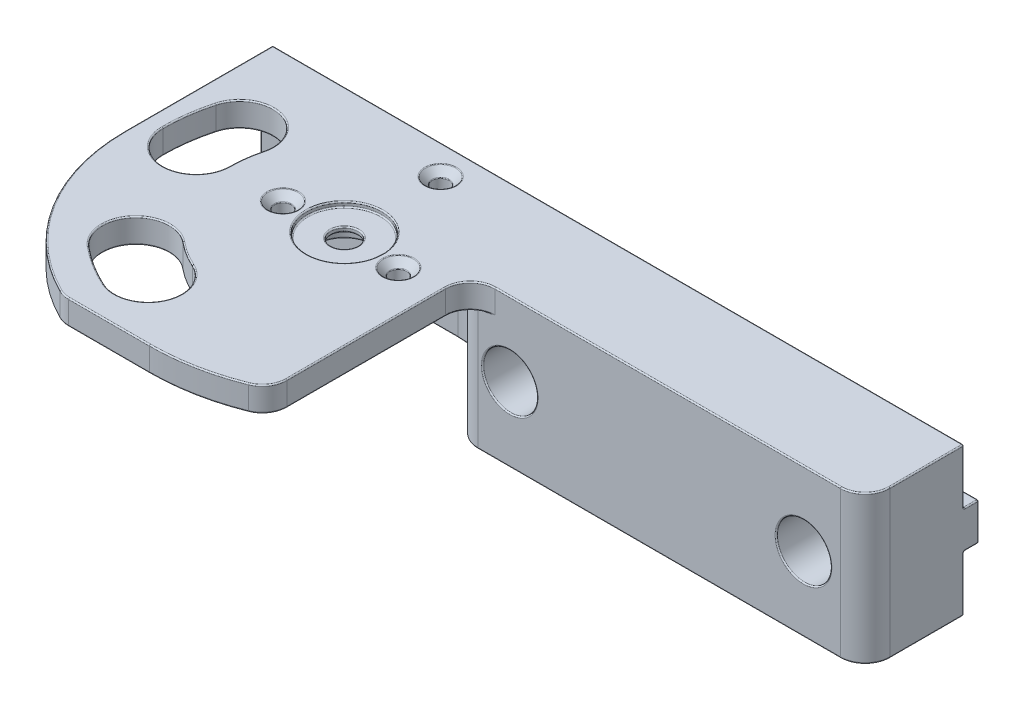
ISO-10303-21;
HEADER;
FILE_DESCRIPTION(('STEP AP214'),'2;1');
FILE_NAME('part.step','',(''),(''),'','','');
FILE_SCHEMA(('AUTOMOTIVE_DESIGN { 1 0 10303 214 1 1 1 1 }'));
ENDSEC;
DATA;
#1=APPLICATION_CONTEXT('core data for automotive mechanical design processes');
#2=APPLICATION_PROTOCOL_DEFINITION('international standard','automotive_design',2000,#1);
#3=PRODUCT_CONTEXT('',#1,'mechanical');
#4=PRODUCT('Part','Part','',(#3));
#5=PRODUCT_RELATED_PRODUCT_CATEGORY('part','',(#4));
#6=PRODUCT_DEFINITION_FORMATION('','',#4);
#7=PRODUCT_DEFINITION_CONTEXT('part definition',#1,'design');
#8=PRODUCT_DEFINITION('design','',#6,#7);
#9=PRODUCT_DEFINITION_SHAPE('','',#8);
#10=(LENGTH_UNIT() NAMED_UNIT(*) SI_UNIT(.MILLI.,.METRE.));
#11=(NAMED_UNIT(*) PLANE_ANGLE_UNIT() SI_UNIT($,.RADIAN.));
#12=(NAMED_UNIT(*) SI_UNIT($,.STERADIAN.) SOLID_ANGLE_UNIT());
#13=UNCERTAINTY_MEASURE_WITH_UNIT(LENGTH_MEASURE(1.E-05),#10,'distance_accuracy_value','');
#14=(GEOMETRIC_REPRESENTATION_CONTEXT(3) GLOBAL_UNCERTAINTY_ASSIGNED_CONTEXT((#13)) GLOBAL_UNIT_ASSIGNED_CONTEXT((#10,
#11,#12)) REPRESENTATION_CONTEXT('',''));
#15=CARTESIAN_POINT('',(0.,0.,0.));
#16=DIRECTION('',(0.,0.,1.));
#17=DIRECTION('',(1.,0.,0.));
#18=AXIS2_PLACEMENT_3D('',#15,#16,#17);
#19=CARTESIAN_POINT('',(0.,0.,-3.));
#20=DIRECTION('',(0.,0.,-1.));
#21=DIRECTION('',(-1.,0.,0.));
#22=AXIS2_PLACEMENT_3D('',#19,#20,#21);
#23=PLANE('',#22);
#24=CARTESIAN_POINT('',(137.5,15.,-3.));
#25=DIRECTION('',(0.,0.,-1.));
#26=DIRECTION('',(-1.,0.,0.));
#27=AXIS2_PLACEMENT_3D('',#24,#25,#26);
#28=CIRCLE('',#27,3.54999999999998);
#29=CARTESIAN_POINT('',(137.5,11.45,-3.));
#30=VERTEX_POINT('',#29);
#31=CARTESIAN_POINT('',(141.05,15.,-3.));
#32=VERTEX_POINT('',#31);
#33=EDGE_CURVE('E1205',#30,#32,#28,.F.);
#34=ORIENTED_EDGE('',*,*,#33,.T.);
#35=CARTESIAN_POINT('',(137.5,15.,-3.));
#36=DIRECTION('',(0.,0.,-1.));
#37=DIRECTION('',(-1.,0.,0.));
#38=AXIS2_PLACEMENT_3D('',#35,#36,#37);
#39=CIRCLE('',#38,3.54999999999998);
#40=CARTESIAN_POINT('',(137.5,18.55,-3.));
#41=VERTEX_POINT('',#40);
#42=EDGE_CURVE('E1211',#32,#41,#39,.F.);
#43=ORIENTED_EDGE('',*,*,#42,.T.);
#44=DIRECTION('',(1.,0.,0.));
#45=VECTOR('',#44,1.);
#46=CARTESIAN_POINT('',(150.,18.55,-3.));
#47=LINE('',#46,#45);
#48=CARTESIAN_POINT('',(149.75,18.55,-3.));
#49=VERTEX_POINT('',#48);
#50=EDGE_CURVE('E1189',#41,#49,#47,.T.);
#51=ORIENTED_EDGE('',*,*,#50,.T.);
#52=DIRECTION('',(0.,-1.,0.));
#53=VECTOR('',#52,1.);
#54=CARTESIAN_POINT('',(149.75,11.2,-3.));
#55=LINE('',#54,#53);
#56=CARTESIAN_POINT('',(149.75,11.45,-3.));
#57=VERTEX_POINT('',#56);
#58=EDGE_CURVE('E1591',#49,#57,#55,.T.);
#59=ORIENTED_EDGE('',*,*,#58,.T.);
#60=DIRECTION('',(-1.,0.,0.));
#61=VECTOR('',#60,1.);
#62=CARTESIAN_POINT('',(10.,11.45,-3.));
#63=LINE('',#62,#61);
#64=EDGE_CURVE('E1587',#57,#30,#63,.T.);
#65=ORIENTED_EDGE('',*,*,#64,.T.);
#66=EDGE_LOOP('',(#34,#43,#51,#59,#65));
#67=FACE_BOUND('',#66,.T.);
#68=ADVANCED_FACE('F42',(#67),#23,.T.);
#69=DIRECTION('',(1.,0.,0.));
#70=VECTOR('',#69,1.);
#71=CARTESIAN_POINT('',(150.,18.55,-3.));
#72=LINE('',#71,#70);
#73=CARTESIAN_POINT('',(78.,18.55,-3.));
#74=VERTEX_POINT('',#73);
#75=EDGE_CURVE('E1188',#74,#41,#72,.T.);
#76=ORIENTED_EDGE('',*,*,#75,.T.);
#77=CARTESIAN_POINT('',(137.5,15.,-3.));
#78=DIRECTION('',(0.,0.,-1.));
#79=DIRECTION('',(-1.,0.,0.));
#80=AXIS2_PLACEMENT_3D('',#77,#78,#79);
#81=CIRCLE('',#80,3.54999999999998);
#82=EDGE_CURVE('E1208',#41,#30,#81,.F.);
#83=ORIENTED_EDGE('',*,*,#82,.T.);
#84=DIRECTION('',(-1.,0.,0.));
#85=VECTOR('',#84,1.);
#86=CARTESIAN_POINT('',(10.,11.45,-3.));
#87=LINE('',#86,#85);
#88=CARTESIAN_POINT('',(78.,11.45,-3.));
#89=VERTEX_POINT('',#88);
#90=EDGE_CURVE('E1584',#30,#89,#87,.T.);
#91=ORIENTED_EDGE('',*,*,#90,.T.);
#92=CARTESIAN_POINT('',(78.,15.,-3.));
#93=DIRECTION('',(0.,0.,-1.));
#94=DIRECTION('',(-1.,0.,0.));
#95=AXIS2_PLACEMENT_3D('',#92,#93,#94);
#96=CIRCLE('',#95,3.54999999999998);
#97=CARTESIAN_POINT('',(81.55,15.,-3.));
#98=VERTEX_POINT('',#97);
#99=EDGE_CURVE('E1192',#89,#98,#96,.F.);
#100=ORIENTED_EDGE('',*,*,#99,.T.);
#101=CARTESIAN_POINT('',(78.,15.,-3.));
#102=DIRECTION('',(0.,0.,-1.));
#103=DIRECTION('',(-1.,0.,0.));
#104=AXIS2_PLACEMENT_3D('',#101,#102,#103);
#105=CIRCLE('',#104,3.54999999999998);
#106=EDGE_CURVE('E1197',#98,#74,#105,.F.);
#107=ORIENTED_EDGE('',*,*,#106,.T.);
#108=EDGE_LOOP('',(#76,#83,#91,#100,#107));
#109=FACE_BOUND('',#108,.T.);
#110=ADVANCED_FACE('F1150',(#109),#23,.T.);
#111=CARTESIAN_POINT('',(0.,0.,65.));
#112=DIRECTION('',(0.,1.,0.));
#113=DIRECTION('',(0.,0.,1.));
#114=AXIS2_PLACEMENT_3D('',#111,#112,#113);
#115=PLANE('',#114);
#116=CARTESIAN_POINT('',(50.,0.,19.5));
#117=DIRECTION('',(0.,1.,0.));
#118=DIRECTION('',(0.,0.,1.));
#119=AXIS2_PLACEMENT_3D('',#116,#117,#118);
#120=CIRCLE('',#119,17.25);
#121=CARTESIAN_POINT('',(66.8852844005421,0.,15.9715909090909));
#122=VERTEX_POINT('',#121);
#123=CARTESIAN_POINT('',(50.,0.,2.24999999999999));
#124=VERTEX_POINT('',#123);
#125=EDGE_CURVE('E1391',#122,#124,#120,.T.);
#126=ORIENTED_EDGE('',*,*,#125,.T.);
#127=DIRECTION('',(-1.,0.,0.));
#128=VECTOR('',#127,1.);
#129=CARTESIAN_POINT('',(20.,0.,2.24999999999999));
#130=LINE('',#129,#128);
#131=CARTESIAN_POINT('',(20.,0.,2.24999999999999));
#132=VERTEX_POINT('',#131);
#133=EDGE_CURVE('E1394',#124,#132,#130,.T.);
#134=ORIENTED_EDGE('',*,*,#133,.T.);
#135=DIRECTION('',(0.,0.,1.));
#136=VECTOR('',#135,1.);
#137=CARTESIAN_POINT('',(20.,0.,0.));
#138=LINE('',#137,#136);
#139=CARTESIAN_POINT('',(20.,0.,0.25));
#140=VERTEX_POINT('',#139);
#141=EDGE_CURVE('E518',#132,#140,#138,.F.);
#142=ORIENTED_EDGE('',*,*,#141,.T.);
#143=DIRECTION('',(1.,0.,0.));
#144=VECTOR('',#143,1.);
#145=CARTESIAN_POINT('',(150.,0.,0.25));
#146=LINE('',#145,#144);
#147=CARTESIAN_POINT('',(149.75,0.,0.25));
#148=VERTEX_POINT('',#147);
#149=EDGE_CURVE('E1383',#140,#148,#146,.T.);
#150=ORIENTED_EDGE('',*,*,#149,.T.);
#151=DIRECTION('',(0.,0.,-1.));
#152=VECTOR('',#151,1.);
#153=CARTESIAN_POINT('',(149.75,0.,65.));
#154=LINE('',#153,#152);
#155=CARTESIAN_POINT('',(149.75,0.,15.));
#156=VERTEX_POINT('',#155);
#157=EDGE_CURVE('E1380',#148,#156,#154,.F.);
#158=ORIENTED_EDGE('',*,*,#157,.T.);
#159=CARTESIAN_POINT('',(145.,0.,15.));
#160=DIRECTION('',(0.,1.,0.));
#161=DIRECTION('',(0.,0.,1.));
#162=AXIS2_PLACEMENT_3D('',#159,#160,#161);
#163=CIRCLE('',#162,4.75);
#164=CARTESIAN_POINT('',(145.,0.,19.75));
#165=VERTEX_POINT('',#164);
#166=EDGE_CURVE('E1377',#156,#165,#163,.F.);
#167=ORIENTED_EDGE('',*,*,#166,.T.);
#168=DIRECTION('',(1.,0.,0.));
#169=VECTOR('',#168,1.);
#170=CARTESIAN_POINT('',(0.,0.,19.75));
#171=LINE('',#170,#169);
#172=CARTESIAN_POINT('',(71.5348554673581,0.,19.75));
#173=VERTEX_POINT('',#172);
#174=EDGE_CURVE('E1386',#165,#173,#171,.F.);
#175=ORIENTED_EDGE('',*,*,#174,.T.);
#176=CARTESIAN_POINT('',(71.5348554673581,0.,15.));
#177=DIRECTION('',(0.,1.,0.));
#178=DIRECTION('',(0.,0.,1.));
#179=AXIS2_PLACEMENT_3D('',#176,#177,#178);
#180=CIRCLE('',#179,4.75);
#181=EDGE_CURVE('E1310',#173,#122,#180,.F.);
#182=ORIENTED_EDGE('',*,*,#181,.T.);
#183=EDGE_LOOP('',(#126,#134,#142,#150,#158,#167,#175,#182));
#184=FACE_BOUND('',#183,.T.);
#185=ADVANCED_FACE('F1157',(#184),#115,.F.);
#186=CARTESIAN_POINT('',(50.,78.0832611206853,19.5));
#187=DIRECTION('',(0.,-1.,0.));
#188=DIRECTION('',(0.,0.,-1.));
#189=AXIS2_PLACEMENT_3D('',#186,#187,#188);
#190=CYLINDRICAL_SURFACE('',#189,17.);
#191=DIRECTION('',(0.,1.,0.));
#192=VECTOR('',#191,1.);
#193=CARTESIAN_POINT('',(50.,-86.6386172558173,2.49999999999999));
#194=LINE('',#193,#192);
#195=CARTESIAN_POINT('',(50.,0.25,2.49999999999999));
#196=VERTEX_POINT('',#195);
#197=CARTESIAN_POINT('',(50.,24.75,2.49999999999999));
#198=VERTEX_POINT('',#197);
#199=EDGE_CURVE('E1805',#196,#198,#194,.T.);
#200=ORIENTED_EDGE('',*,*,#199,.F.);
#201=CARTESIAN_POINT('',(50.,0.25,19.5));
#202=DIRECTION('',(0.,1.,0.));
#203=DIRECTION('',(0.,0.,1.));
#204=AXIS2_PLACEMENT_3D('',#201,#202,#203);
#205=CIRCLE('',#204,17.);
#206=CARTESIAN_POINT('',(66.6405701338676,0.25,16.0227272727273));
#207=VERTEX_POINT('',#206);
#208=EDGE_CURVE('E1561',#196,#207,#205,.F.);
#209=ORIENTED_EDGE('',*,*,#208,.T.);
#210=DIRECTION('',(0.,-1.,0.));
#211=VECTOR('',#210,1.);
#212=CARTESIAN_POINT('',(66.6405701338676,78.0832611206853,16.0227272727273));
#213=LINE('',#212,#211);
#214=CARTESIAN_POINT('',(66.6405701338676,24.75,16.0227272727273));
#215=VERTEX_POINT('',#214);
#216=EDGE_CURVE('E1295',#207,#215,#213,.F.);
#217=ORIENTED_EDGE('',*,*,#216,.T.);
#218=CARTESIAN_POINT('',(50.,24.75,19.5));
#219=DIRECTION('',(0.,-1.,0.));
#220=DIRECTION('',(0.,0.,-1.));
#221=AXIS2_PLACEMENT_3D('',#218,#219,#220);
#222=CIRCLE('',#221,17.);
#223=EDGE_CURVE('E1558',#215,#198,#222,.F.);
#224=ORIENTED_EDGE('',*,*,#223,.T.);
#225=EDGE_LOOP('',(#200,#209,#217,#224));
#226=FACE_BOUND('',#225,.T.);
#227=ADVANCED_FACE('F2393',(#226),#190,.F.);
#228=CARTESIAN_POINT('',(10.,0.,0.));
#229=DIRECTION('',(-1.,0.,0.));
#230=DIRECTION('',(0.,0.,1.));
#231=AXIS2_PLACEMENT_3D('',#228,#229,#230);
#232=PLANE('',#231);
#233=CARTESIAN_POINT('',(10.,24.75,2.74999999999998));
#234=DIRECTION('',(-1.,0.,0.));
#235=DIRECTION('',(0.,0.,1.));
#236=AXIS2_PLACEMENT_3D('',#233,#234,#235);
#237=CIRCLE('',#236,0.5);
#238=CARTESIAN_POINT('',(10.,25.25,2.74999999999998));
#239=VERTEX_POINT('',#238);
#240=CARTESIAN_POINT('',(10.,24.75,2.24999999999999));
#241=VERTEX_POINT('',#240);
#242=EDGE_CURVE('E1367',#239,#241,#237,.T.);
#243=ORIENTED_EDGE('',*,*,#242,.F.);
#244=DIRECTION('',(0.,0.,-1.));
#245=VECTOR('',#244,1.);
#246=CARTESIAN_POINT('',(10.,25.25,0.));
#247=LINE('',#246,#245);
#248=CARTESIAN_POINT('',(10.,25.25,30.));
#249=VERTEX_POINT('',#248);
#250=EDGE_CURVE('E1374',#239,#249,#247,.F.);
#251=ORIENTED_EDGE('',*,*,#250,.T.);
#252=DIRECTION('',(0.,-1.,0.));
#253=VECTOR('',#252,1.);
#254=CARTESIAN_POINT('',(10.,30.,30.));
#255=LINE('',#254,#253);
#256=CARTESIAN_POINT('',(10.,29.75,30.));
#257=VERTEX_POINT('',#256);
#258=EDGE_CURVE('E1785',#257,#249,#255,.T.);
#259=ORIENTED_EDGE('',*,*,#258,.F.);
#260=DIRECTION('',(0.,0.,-1.));
#261=VECTOR('',#260,1.);
#262=CARTESIAN_POINT('',(10.,29.75,0.));
#263=LINE('',#262,#261);
#264=CARTESIAN_POINT('',(10.,29.75,0.25));
#265=VERTEX_POINT('',#264);
#266=EDGE_CURVE('E1361',#257,#265,#263,.T.);
#267=ORIENTED_EDGE('',*,*,#266,.T.);
#268=DIRECTION('',(0.,1.,0.));
#269=VECTOR('',#268,1.);
#270=CARTESIAN_POINT('',(10.,0.,0.25));
#271=LINE('',#270,#269);
#272=CARTESIAN_POINT('',(10.,19.05,0.25));
#273=VERTEX_POINT('',#272);
#274=EDGE_CURVE('E1354',#265,#273,#271,.F.);
#275=ORIENTED_EDGE('',*,*,#274,.T.);
#276=CARTESIAN_POINT('',(10.,19.05,-0.25));
#277=DIRECTION('',(-1.,0.,0.));
#278=DIRECTION('',(0.,0.,1.));
#279=AXIS2_PLACEMENT_3D('',#276,#277,#278);
#280=CIRCLE('',#279,0.5);
#281=CARTESIAN_POINT('',(10.,18.55,-0.25));
#282=VERTEX_POINT('',#281);
#283=EDGE_CURVE('E1350',#282,#273,#280,.T.);
#284=ORIENTED_EDGE('',*,*,#283,.F.);
#285=DIRECTION('',(0.,0.,-1.));
#286=VECTOR('',#285,1.);
#287=CARTESIAN_POINT('',(10.,18.55,-3.));
#288=LINE('',#287,#286);
#289=CARTESIAN_POINT('',(10.,18.55,-2.75));
#290=VERTEX_POINT('',#289);
#291=EDGE_CURVE('E1347',#282,#290,#288,.T.);
#292=ORIENTED_EDGE('',*,*,#291,.T.);
#293=DIRECTION('',(0.,1.,0.));
#294=VECTOR('',#293,1.);
#295=CARTESIAN_POINT('',(10.,0.,-2.75));
#296=LINE('',#295,#294);
#297=CARTESIAN_POINT('',(10.,11.45,-2.75));
#298=VERTEX_POINT('',#297);
#299=EDGE_CURVE('E1341',#290,#298,#296,.F.);
#300=ORIENTED_EDGE('',*,*,#299,.T.);
#301=DIRECTION('',(0.,0.,1.));
#302=VECTOR('',#301,1.);
#303=CARTESIAN_POINT('',(10.,11.45,0.));
#304=LINE('',#303,#302);
#305=CARTESIAN_POINT('',(10.,11.45,-0.25));
#306=VERTEX_POINT('',#305);
#307=EDGE_CURVE('E1344',#298,#306,#304,.T.);
#308=ORIENTED_EDGE('',*,*,#307,.T.);
#309=CARTESIAN_POINT('',(10.,10.95,-0.25));
#310=DIRECTION('',(-1.,0.,0.));
#311=DIRECTION('',(0.,0.,1.));
#312=AXIS2_PLACEMENT_3D('',#309,#310,#311);
#313=CIRCLE('',#312,0.5);
#314=CARTESIAN_POINT('',(10.,10.95,0.25));
#315=VERTEX_POINT('',#314);
#316=EDGE_CURVE('E1357',#315,#306,#313,.T.);
#317=ORIENTED_EDGE('',*,*,#316,.F.);
#318=DIRECTION('',(0.,1.,0.));
#319=VECTOR('',#318,1.);
#320=CARTESIAN_POINT('',(10.,0.,0.25));
#321=LINE('',#320,#319);
#322=CARTESIAN_POINT('',(10.,10.,0.25));
#323=VERTEX_POINT('',#322);
#324=EDGE_CURVE('E1364',#315,#323,#321,.F.);
#325=ORIENTED_EDGE('',*,*,#324,.T.);
#326=DIRECTION('',(0.,0.,1.));
#327=VECTOR('',#326,1.);
#328=CARTESIAN_POINT('',(10.,10.,2.49999999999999));
#329=LINE('',#328,#327);
#330=CARTESIAN_POINT('',(10.,10.,2.24999999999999));
#331=VERTEX_POINT('',#330);
#332=EDGE_CURVE('E1911',#323,#331,#329,.T.);
#333=ORIENTED_EDGE('',*,*,#332,.T.);
#334=DIRECTION('',(0.,1.,0.));
#335=VECTOR('',#334,1.);
#336=CARTESIAN_POINT('',(10.,0.,2.24999999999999));
#337=LINE('',#336,#335);
#338=EDGE_CURVE('E1371',#331,#241,#337,.T.);
#339=ORIENTED_EDGE('',*,*,#338,.T.);
#340=EDGE_LOOP('',(#243,#251,#259,#267,#275,#284,#292,#300,#308,#317,#325,#333,#339));
#341=FACE_BOUND('',#340,.T.);
#342=ADVANCED_FACE('F2229',(#341),#232,.T.);
#343=CARTESIAN_POINT('',(0.,0.,0.));
#344=DIRECTION('',(0.,0.,-1.));
#345=DIRECTION('',(-1.,0.,0.));
#346=AXIS2_PLACEMENT_3D('',#343,#344,#345);
#347=PLANE('',#346);
#348=DIRECTION('',(1.,0.,0.));
#349=VECTOR('',#348,1.);
#350=CARTESIAN_POINT('',(0.,19.05,0.));
#351=LINE('',#350,#349);
#352=CARTESIAN_POINT('',(149.75,19.05,0.));
#353=VERTEX_POINT('',#352);
#354=CARTESIAN_POINT('',(10.25,19.05,0.));
#355=VERTEX_POINT('',#354);
#356=EDGE_CURVE('E1447',#353,#355,#351,.F.);
#357=ORIENTED_EDGE('',*,*,#356,.T.);
#358=DIRECTION('',(0.,1.,0.));
#359=VECTOR('',#358,1.);
#360=CARTESIAN_POINT('',(10.25,0.,0.));
#361=LINE('',#360,#359);
#362=CARTESIAN_POINT('',(10.25,29.75,0.));
#363=VERTEX_POINT('',#362);
#364=EDGE_CURVE('E1450',#355,#363,#361,.T.);
#365=ORIENTED_EDGE('',*,*,#364,.T.);
#366=DIRECTION('',(-1.,0.,0.));
#367=VECTOR('',#366,1.);
#368=CARTESIAN_POINT('',(150.,29.75,0.));
#369=LINE('',#368,#367);
#370=CARTESIAN_POINT('',(149.75,29.75,0.));
#371=VERTEX_POINT('',#370);
#372=EDGE_CURVE('E1441',#363,#371,#369,.F.);
#373=ORIENTED_EDGE('',*,*,#372,.T.);
#374=DIRECTION('',(0.,1.,0.));
#375=VECTOR('',#374,1.);
#376=CARTESIAN_POINT('',(149.75,18.8,0.));
#377=LINE('',#376,#375);
#378=EDGE_CURVE('E1444',#371,#353,#377,.F.);
#379=ORIENTED_EDGE('',*,*,#378,.T.);
#380=EDGE_LOOP('',(#357,#365,#373,#379));
#381=FACE_BOUND('',#380,.T.);
#382=ADVANCED_FACE('F2620',(#381),#347,.T.);
#383=DIRECTION('',(1.,0.,0.));
#384=VECTOR('',#383,1.);
#385=CARTESIAN_POINT('',(20.,0.25,0.));
#386=LINE('',#385,#384);
#387=CARTESIAN_POINT('',(149.75,0.25,0.));
#388=VERTEX_POINT('',#387);
#389=CARTESIAN_POINT('',(20.,0.25,0.));
#390=VERTEX_POINT('',#389);
#391=EDGE_CURVE('E1704',#388,#390,#386,.F.);
#392=ORIENTED_EDGE('',*,*,#391,.T.);
#393=CARTESIAN_POINT('',(20.,10.,0.));
#394=DIRECTION('',(0.,0.,-1.));
#395=DIRECTION('',(-1.,0.,0.));
#396=AXIS2_PLACEMENT_3D('',#393,#394,#395);
#397=CIRCLE('',#396,9.75);
#398=CARTESIAN_POINT('',(10.25,10.,0.));
#399=VERTEX_POINT('',#398);
#400=EDGE_CURVE('E1685',#390,#399,#397,.T.);
#401=ORIENTED_EDGE('',*,*,#400,.T.);
#402=DIRECTION('',(0.,1.,0.));
#403=VECTOR('',#402,1.);
#404=CARTESIAN_POINT('',(10.25,0.,0.));
#405=LINE('',#404,#403);
#406=CARTESIAN_POINT('',(10.25,10.95,0.));
#407=VERTEX_POINT('',#406);
#408=EDGE_CURVE('E1690',#399,#407,#405,.T.);
#409=ORIENTED_EDGE('',*,*,#408,.T.);
#410=DIRECTION('',(-1.,0.,0.));
#411=VECTOR('',#410,1.);
#412=CARTESIAN_POINT('',(0.,10.95,0.));
#413=LINE('',#412,#411);
#414=CARTESIAN_POINT('',(149.75,10.95,0.));
#415=VERTEX_POINT('',#414);
#416=EDGE_CURVE('E1702',#407,#415,#413,.F.);
#417=ORIENTED_EDGE('',*,*,#416,.T.);
#418=DIRECTION('',(0.,1.,0.));
#419=VECTOR('',#418,1.);
#420=CARTESIAN_POINT('',(149.75,0.,0.));
#421=LINE('',#420,#419);
#422=EDGE_CURVE('E1706',#415,#388,#421,.F.);
#423=ORIENTED_EDGE('',*,*,#422,.T.);
#424=EDGE_LOOP('',(#392,#401,#409,#417,#423));
#425=FACE_BOUND('',#424,.T.);
#426=ADVANCED_FACE('F2173',(#425),#347,.T.);
#427=CARTESIAN_POINT('',(150.,11.2,-3.));
#428=DIRECTION('',(0.,1.,0.));
#429=DIRECTION('',(0.,0.,1.));
#430=AXIS2_PLACEMENT_3D('',#427,#428,#429);
#431=PLANE('',#430);
#432=DIRECTION('',(-1.,0.,0.));
#433=VECTOR('',#432,1.);
#434=CARTESIAN_POINT('',(150.,11.2,-0.25));
#435=LINE('',#434,#433);
#436=CARTESIAN_POINT('',(149.75,11.2,-0.25));
#437=VERTEX_POINT('',#436);
#438=CARTESIAN_POINT('',(10.25,11.2,-0.25));
#439=VERTEX_POINT('',#438);
#440=EDGE_CURVE('E1434',#437,#439,#435,.T.);
#441=ORIENTED_EDGE('',*,*,#440,.T.);
#442=DIRECTION('',(0.,0.,1.));
#443=VECTOR('',#442,1.);
#444=CARTESIAN_POINT('',(10.25,11.2,-3.));
#445=LINE('',#444,#443);
#446=CARTESIAN_POINT('',(10.25,11.2,-2.75));
#447=VERTEX_POINT('',#446);
#448=EDGE_CURVE('E1437',#439,#447,#445,.F.);
#449=ORIENTED_EDGE('',*,*,#448,.T.);
#450=DIRECTION('',(-1.,0.,0.));
#451=VECTOR('',#450,1.);
#452=CARTESIAN_POINT('',(150.,11.2,-2.75));
#453=LINE('',#452,#451);
#454=CARTESIAN_POINT('',(149.75,11.2,-2.75));
#455=VERTEX_POINT('',#454);
#456=EDGE_CURVE('E1431',#447,#455,#453,.F.);
#457=ORIENTED_EDGE('',*,*,#456,.T.);
#458=DIRECTION('',(0.,0.,1.));
#459=VECTOR('',#458,1.);
#460=CARTESIAN_POINT('',(149.75,11.2,-3.));
#461=LINE('',#460,#459);
#462=EDGE_CURVE('E1428',#455,#437,#461,.T.);
#463=ORIENTED_EDGE('',*,*,#462,.T.);
#464=EDGE_LOOP('',(#441,#449,#457,#463));
#465=FACE_BOUND('',#464,.T.);
#466=ADVANCED_FACE('F1172',(#465),#431,.F.);
#467=CARTESIAN_POINT('',(150.,18.8,-3.));
#468=DIRECTION('',(0.,-1.,0.));
#469=DIRECTION('',(0.,0.,-1.));
#470=AXIS2_PLACEMENT_3D('',#467,#468,#469);
#471=PLANE('',#470);
#472=DIRECTION('',(1.,0.,0.));
#473=VECTOR('',#472,1.);
#474=CARTESIAN_POINT('',(10.,18.8,-2.75));
#475=LINE('',#474,#473);
#476=CARTESIAN_POINT('',(149.75,18.8,-2.75));
#477=VERTEX_POINT('',#476);
#478=CARTESIAN_POINT('',(10.25,18.8,-2.75));
#479=VERTEX_POINT('',#478);
#480=EDGE_CURVE('E1418',#477,#479,#475,.F.);
#481=ORIENTED_EDGE('',*,*,#480,.T.);
#482=DIRECTION('',(0.,0.,-1.));
#483=VECTOR('',#482,1.);
#484=CARTESIAN_POINT('',(10.25,18.8,0.));
#485=LINE('',#484,#483);
#486=CARTESIAN_POINT('',(10.25,18.8,-0.25));
#487=VERTEX_POINT('',#486);
#488=EDGE_CURVE('E1424',#479,#487,#485,.F.);
#489=ORIENTED_EDGE('',*,*,#488,.T.);
#490=DIRECTION('',(1.,0.,0.));
#491=VECTOR('',#490,1.);
#492=CARTESIAN_POINT('',(150.,18.8,-0.25));
#493=LINE('',#492,#491);
#494=CARTESIAN_POINT('',(149.75,18.8,-0.25));
#495=VERTEX_POINT('',#494);
#496=EDGE_CURVE('E1421',#487,#495,#493,.T.);
#497=ORIENTED_EDGE('',*,*,#496,.T.);
#498=DIRECTION('',(0.,0.,1.));
#499=VECTOR('',#498,1.);
#500=CARTESIAN_POINT('',(149.75,18.8,-3.));
#501=LINE('',#500,#499);
#502=EDGE_CURVE('E1415',#495,#477,#501,.F.);
#503=ORIENTED_EDGE('',*,*,#502,.T.);
#504=EDGE_LOOP('',(#481,#489,#497,#503));
#505=FACE_BOUND('',#504,.T.);
#506=ADVANCED_FACE('F1163',(#505),#471,.F.);
#507=DIRECTION('',(1.,0.,0.));
#508=VECTOR('',#507,1.);
#509=CARTESIAN_POINT('',(150.,18.55,-3.));
#510=LINE('',#509,#508);
#511=CARTESIAN_POINT('',(10.25,18.55,-3.));
#512=VERTEX_POINT('',#511);
#513=EDGE_CURVE('E1176',#512,#74,#510,.T.);
#514=ORIENTED_EDGE('',*,*,#513,.T.);
#515=CARTESIAN_POINT('',(78.,15.,-3.));
#516=DIRECTION('',(0.,0.,-1.));
#517=DIRECTION('',(-1.,0.,0.));
#518=AXIS2_PLACEMENT_3D('',#515,#516,#517);
#519=CIRCLE('',#518,3.54999999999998);
#520=EDGE_CURVE('E1178',#74,#89,#519,.F.);
#521=ORIENTED_EDGE('',*,*,#520,.T.);
#522=DIRECTION('',(-1.,0.,0.));
#523=VECTOR('',#522,1.);
#524=CARTESIAN_POINT('',(10.,11.45,-3.));
#525=LINE('',#524,#523);
#526=CARTESIAN_POINT('',(10.25,11.45,-3.));
#527=VERTEX_POINT('',#526);
#528=EDGE_CURVE('E1184',#89,#527,#525,.T.);
#529=ORIENTED_EDGE('',*,*,#528,.T.);
#530=DIRECTION('',(0.,1.,0.));
#531=VECTOR('',#530,1.);
#532=CARTESIAN_POINT('',(10.25,0.,-3.));
#533=LINE('',#532,#531);
#534=EDGE_CURVE('E1181',#527,#512,#533,.T.);
#535=ORIENTED_EDGE('',*,*,#534,.T.);
#536=EDGE_LOOP('',(#514,#521,#529,#535));
#537=FACE_BOUND('',#536,.T.);
#538=ADVANCED_FACE('F1153',(#537),#23,.T.);
#539=CARTESIAN_POINT('',(50.,30.,25.5));
#540=DIRECTION('',(0.,1.,0.));
#541=DIRECTION('',(0.,0.,1.));
#542=AXIS2_PLACEMENT_3D('',#539,#540,#541);
#543=CYLINDRICAL_SURFACE('',#542,2.74999999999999);
#544=CARTESIAN_POINT('',(50.,28.75,25.5));
#545=DIRECTION('',(0.,1.,0.));
#546=DIRECTION('',(0.,0.,1.));
#547=AXIS2_PLACEMENT_3D('',#544,#545,#546);
#548=CIRCLE('',#547,2.74999999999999);
#549=CARTESIAN_POINT('',(50.,28.75,28.25));
#550=VERTEX_POINT('',#549);
#551=EDGE_CURVE('E1490',#550,#550,#548,.T.);
#552=ORIENTED_EDGE('',*,*,#551,.T.);
#553=EDGE_LOOP('',(#552));
#554=FACE_BOUND('',#553,.T.);
#555=CARTESIAN_POINT('',(50.,28.25,25.5));
#556=DIRECTION('',(0.,-1.,0.));
#557=DIRECTION('',(0.,0.,-1.));
#558=AXIS2_PLACEMENT_3D('',#555,#556,#557);
#559=CIRCLE('',#558,2.74999999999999);
#560=CARTESIAN_POINT('',(50.,28.25,22.75));
#561=VERTEX_POINT('',#560);
#562=EDGE_CURVE('E1486',#561,#561,#559,.T.);
#563=ORIENTED_EDGE('',*,*,#562,.T.);
#564=EDGE_LOOP('',(#563));
#565=FACE_BOUND('',#564,.T.);
#566=ADVANCED_FACE('F1162',(#554,#565),#543,.F.);
#567=CARTESIAN_POINT('',(150.,0.,65.));
#568=DIRECTION('',(-1.,0.,0.));
#569=DIRECTION('',(0.,0.,1.));
#570=AXIS2_PLACEMENT_3D('',#567,#568,#569);
#571=PLANE('',#570);
#572=DIRECTION('',(0.,1.,0.));
#573=VECTOR('',#572,1.);
#574=CARTESIAN_POINT('',(150.,30.,0.25));
#575=LINE('',#574,#573);
#576=CARTESIAN_POINT('',(150.,19.05,0.25));
#577=VERTEX_POINT('',#576);
#578=CARTESIAN_POINT('',(150.,29.75,0.25));
#579=VERTEX_POINT('',#578);
#580=EDGE_CURVE('E60',#577,#579,#575,.T.);
#581=ORIENTED_EDGE('',*,*,#580,.T.);
#582=DIRECTION('',(0.,0.,-1.));
#583=VECTOR('',#582,1.);
#584=CARTESIAN_POINT('',(150.,29.75,65.));
#585=LINE('',#584,#583);
#586=CARTESIAN_POINT('',(150.,29.75,15.));
#587=VERTEX_POINT('',#586);
#588=EDGE_CURVE('E1254',#579,#587,#585,.F.);
#589=ORIENTED_EDGE('',*,*,#588,.T.);
#590=DIRECTION('',(0.,1.,0.));
#591=VECTOR('',#590,1.);
#592=CARTESIAN_POINT('',(150.,0.,15.));
#593=LINE('',#592,#591);
#594=CARTESIAN_POINT('',(150.,0.25,15.));
#595=VERTEX_POINT('',#594);
#596=EDGE_CURVE('E1906',#587,#595,#593,.F.);
#597=ORIENTED_EDGE('',*,*,#596,.T.);
#598=DIRECTION('',(0.,0.,-1.));
#599=VECTOR('',#598,1.);
#600=CARTESIAN_POINT('',(150.,0.25,65.));
#601=LINE('',#600,#599);
#602=CARTESIAN_POINT('',(150.,0.25,0.25));
#603=VERTEX_POINT('',#602);
#604=EDGE_CURVE('E1231',#595,#603,#601,.T.);
#605=ORIENTED_EDGE('',*,*,#604,.T.);
#606=DIRECTION('',(0.,1.,0.));
#607=VECTOR('',#606,1.);
#608=CARTESIAN_POINT('',(150.,11.2,0.25));
#609=LINE('',#608,#607);
#610=CARTESIAN_POINT('',(150.,10.95,0.25));
#611=VERTEX_POINT('',#610);
#612=EDGE_CURVE('E1234',#603,#611,#609,.T.);
#613=ORIENTED_EDGE('',*,*,#612,.T.);
#614=CARTESIAN_POINT('',(150.,10.95,-0.25));
#615=DIRECTION('',(-1.,0.,0.));
#616=DIRECTION('',(0.,0.,1.));
#617=AXIS2_PLACEMENT_3D('',#614,#615,#616);
#618=CIRCLE('',#617,0.5);
#619=CARTESIAN_POINT('',(150.,11.45,-0.25));
#620=VERTEX_POINT('',#619);
#621=EDGE_CURVE('E1237',#620,#611,#618,.F.);
#622=ORIENTED_EDGE('',*,*,#621,.F.);
#623=DIRECTION('',(0.,0.,1.));
#624=VECTOR('',#623,1.);
#625=CARTESIAN_POINT('',(150.,11.45,65.));
#626=LINE('',#625,#624);
#627=CARTESIAN_POINT('',(150.,11.45,-2.75));
#628=VERTEX_POINT('',#627);
#629=EDGE_CURVE('E1241',#620,#628,#626,.F.);
#630=ORIENTED_EDGE('',*,*,#629,.T.);
#631=DIRECTION('',(0.,-1.,0.));
#632=VECTOR('',#631,1.);
#633=CARTESIAN_POINT('',(150.,18.8,-2.75));
#634=LINE('',#633,#632);
#635=CARTESIAN_POINT('',(150.,18.55,-2.75));
#636=VERTEX_POINT('',#635);
#637=EDGE_CURVE('E1244',#628,#636,#634,.F.);
#638=ORIENTED_EDGE('',*,*,#637,.T.);
#639=DIRECTION('',(0.,0.,1.));
#640=VECTOR('',#639,1.);
#641=CARTESIAN_POINT('',(150.,18.55,65.));
#642=LINE('',#641,#640);
#643=CARTESIAN_POINT('',(150.,18.55,-0.25));
#644=VERTEX_POINT('',#643);
#645=EDGE_CURVE('E1247',#636,#644,#642,.T.);
#646=ORIENTED_EDGE('',*,*,#645,.T.);
#647=CARTESIAN_POINT('',(150.,19.05,-0.25));
#648=DIRECTION('',(-1.,0.,0.));
#649=DIRECTION('',(0.,0.,1.));
#650=AXIS2_PLACEMENT_3D('',#647,#648,#649);
#651=CIRCLE('',#650,0.5);
#652=EDGE_CURVE('E65',#577,#644,#651,.F.);
#653=ORIENTED_EDGE('',*,*,#652,.F.);
#654=EDGE_LOOP('',(#581,#589,#597,#605,#613,#622,#630,#638,#646,#653));
#655=FACE_BOUND('',#654,.T.);
#656=ADVANCED_FACE('F1169',(#655),#571,.F.);
#657=CARTESIAN_POINT('',(0.,30.,65.));
#658=DIRECTION('',(0.,-1.,0.));
#659=DIRECTION('',(0.,0.,-1.));
#660=AXIS2_PLACEMENT_3D('',#657,#658,#659);
#661=PLANE('',#660);
#662=CARTESIAN_POINT('',(30.917653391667,30.,48.6487375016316));
#663=DIRECTION('',(0.,-1.,0.));
#664=DIRECTION('',(0.,0.,-1.));
#665=AXIS2_PLACEMENT_3D('',#662,#663,#664);
#666=CIRCLE('',#665,6.99999999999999);
#667=CARTESIAN_POINT('',(26.4651058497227,30.,54.0501095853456));
#668=VERTEX_POINT('',#667);
#669=CARTESIAN_POINT('',(35.3702009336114,30.,43.2473654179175));
#670=VERTEX_POINT('',#669);
#671=EDGE_CURVE('E1675',#668,#670,#666,.T.);
#672=ORIENTED_EDGE('',*,*,#671,.T.);
#673=CARTESIAN_POINT('',(50.,30.,25.5));
#674=DIRECTION('',(0.,-1.,0.));
#675=DIRECTION('',(0.,0.,-1.));
#676=AXIS2_PLACEMENT_3D('',#673,#674,#675);
#677=CIRCLE('',#676,23.);
#678=CARTESIAN_POINT('',(40.4620554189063,30.,46.4291092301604));
#679=VERTEX_POINT('',#678);
#680=EDGE_CURVE('E1971',#670,#679,#677,.F.);
#681=ORIENTED_EDGE('',*,*,#680,.T.);
#682=CARTESIAN_POINT('',(37.5592027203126,30.,52.7988381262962));
#683=DIRECTION('',(0.,-1.,0.));
#684=DIRECTION('',(0.,0.,-1.));
#685=AXIS2_PLACEMENT_3D('',#682,#683,#684);
#686=CIRCLE('',#685,6.99999999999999);
#687=CARTESIAN_POINT('',(34.6563500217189,30.,59.168567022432));
#688=VERTEX_POINT('',#687);
#689=EDGE_CURVE('E1968',#679,#688,#686,.T.);
#690=ORIENTED_EDGE('',*,*,#689,.T.);
#691=CARTESIAN_POINT('',(50.,30.,25.5));
#692=DIRECTION('',(0.,-1.,0.));
#693=DIRECTION('',(0.,0.,-1.));
#694=AXIS2_PLACEMENT_3D('',#691,#692,#693);
#695=CIRCLE('',#694,37.);
#696=EDGE_CURVE('E1966',#688,#668,#695,.T.);
#697=ORIENTED_EDGE('',*,*,#696,.T.);
#698=EDGE_LOOP('',(#672,#681,#690,#697));
#699=FACE_BOUND('',#698,.T.);
#700=CARTESIAN_POINT('',(50.,30.,25.5));
#701=DIRECTION('',(0.,-1.,0.));
#702=DIRECTION('',(0.,0.,-1.));
#703=AXIS2_PLACEMENT_3D('',#700,#701,#702);
#704=CIRCLE('',#703,7.85);
#705=CARTESIAN_POINT('',(50.,30.,17.65));
#706=VERTEX_POINT('',#705);
#707=EDGE_CURVE('E1672',#706,#706,#704,.T.);
#708=ORIENTED_EDGE('',*,*,#707,.T.);
#709=EDGE_LOOP('',(#708));
#710=FACE_BOUND('',#709,.T.);
#711=CARTESIAN_POINT('',(21.0222252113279,30.,17.7354286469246));
#712=DIRECTION('',(0.,-1.,0.));
#713=DIRECTION('',(0.,0.,-1.));
#714=AXIS2_PLACEMENT_3D('',#711,#712,#713);
#715=CIRCLE('',#714,6.99999999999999);
#716=CARTESIAN_POINT('',(14.2607444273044,30.,15.923695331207));
#717=VERTEX_POINT('',#716);
#718=CARTESIAN_POINT('',(27.7837059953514,30.,19.5471619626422));
#719=VERTEX_POINT('',#718);
#720=EDGE_CURVE('E1654',#717,#719,#715,.T.);
#721=ORIENTED_EDGE('',*,*,#720,.T.);
#722=CARTESIAN_POINT('',(50.,30.,25.5));
#723=DIRECTION('',(0.,-1.,0.));
#724=DIRECTION('',(0.,0.,-1.));
#725=AXIS2_PLACEMENT_3D('',#722,#723,#724);
#726=CIRCLE('',#725,23.);
#727=CARTESIAN_POINT('',(27.,30.,25.5));
#728=VERTEX_POINT('',#727);
#729=EDGE_CURVE('E1676',#719,#728,#726,.F.);
#730=ORIENTED_EDGE('',*,*,#729,.T.);
#731=CARTESIAN_POINT('',(20.,30.,25.5));
#732=DIRECTION('',(0.,-1.,0.));
#733=DIRECTION('',(0.,0.,-1.));
#734=AXIS2_PLACEMENT_3D('',#731,#732,#733);
#735=CIRCLE('',#734,6.99999999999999);
#736=CARTESIAN_POINT('',(13.,30.,25.5));
#737=VERTEX_POINT('',#736);
#738=EDGE_CURVE('E1959',#728,#737,#735,.T.);
#739=ORIENTED_EDGE('',*,*,#738,.T.);
#740=CARTESIAN_POINT('',(50.,30.,25.5));
#741=DIRECTION('',(0.,-1.,0.));
#742=DIRECTION('',(0.,0.,-1.));
#743=AXIS2_PLACEMENT_3D('',#740,#741,#742);
#744=CIRCLE('',#743,37.);
#745=EDGE_CURVE('E1956',#737,#717,#744,.T.);
#746=ORIENTED_EDGE('',*,*,#745,.T.);
#747=EDGE_LOOP('',(#721,#730,#739,#746));
#748=FACE_BOUND('',#747,.T.);
#749=CARTESIAN_POINT('',(38.3086570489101,30.,26.2500000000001));
#750=DIRECTION('',(0.,-1.,0.));
#751=DIRECTION('',(0.,0.,-1.));
#752=AXIS2_PLACEMENT_3D('',#749,#750,#751);
#753=CIRCLE('',#752,3.25355339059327);
#754=CARTESIAN_POINT('',(38.3086570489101,30.,22.9964466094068));
#755=VERTEX_POINT('',#754);
#756=EDGE_CURVE('E1640',#755,#755,#753,.T.);
#757=ORIENTED_EDGE('',*,*,#756,.T.);
#758=EDGE_LOOP('',(#757));
#759=FACE_BOUND('',#758,.T.);
#760=CARTESIAN_POINT('',(50.,30.,6.));
#761=DIRECTION('',(0.,-1.,0.));
#762=DIRECTION('',(0.,0.,-1.));
#763=AXIS2_PLACEMENT_3D('',#760,#761,#762);
#764=CIRCLE('',#763,3.25355339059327);
#765=CARTESIAN_POINT('',(50.,30.,2.74644660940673));
#766=VERTEX_POINT('',#765);
#767=EDGE_CURVE('E1625',#766,#766,#764,.T.);
#768=ORIENTED_EDGE('',*,*,#767,.T.);
#769=EDGE_LOOP('',(#768));
#770=FACE_BOUND('',#769,.T.);
#771=CARTESIAN_POINT('',(61.6913429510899,30.,26.25));
#772=DIRECTION('',(0.,-1.,0.));
#773=DIRECTION('',(0.,0.,-1.));
#774=AXIS2_PLACEMENT_3D('',#771,#772,#773);
#775=CIRCLE('',#774,3.25355339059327);
#776=CARTESIAN_POINT('',(61.6913429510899,30.,22.9964466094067));
#777=VERTEX_POINT('',#776);
#778=EDGE_CURVE('E1622',#777,#777,#775,.T.);
#779=ORIENTED_EDGE('',*,*,#778,.T.);
#780=EDGE_LOOP('',(#779));
#781=FACE_BOUND('',#780,.T.);
#782=CARTESIAN_POINT('',(50.,30.,19.5));
#783=DIRECTION('',(0.,-1.,0.));
#784=DIRECTION('',(0.,0.,-1.));
#785=AXIS2_PLACEMENT_3D('',#782,#783,#784);
#786=CIRCLE('',#785,45.25);
#787=CARTESIAN_POINT('',(50.,30.,64.75));
#788=VERTEX_POINT('',#787);
#789=CARTESIAN_POINT('',(66.7592592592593,30.,61.5320083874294));
#790=VERTEX_POINT('',#789);
#791=EDGE_CURVE('E1948',#788,#790,#786,.F.);
#792=ORIENTED_EDGE('',*,*,#791,.T.);
#793=CARTESIAN_POINT('',(65.,30.,57.1198086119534));
#794=DIRECTION('',(0.,-1.,0.));
#795=DIRECTION('',(0.,0.,-1.));
#796=AXIS2_PLACEMENT_3D('',#793,#794,#795);
#797=CIRCLE('',#796,4.75);
#798=CARTESIAN_POINT('',(69.75,30.,57.1198086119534));
#799=VERTEX_POINT('',#798);
#800=EDGE_CURVE('E1626',#790,#799,#797,.F.);
#801=ORIENTED_EDGE('',*,*,#800,.T.);
#802=DIRECTION('',(0.,0.,1.));
#803=VECTOR('',#802,1.);
#804=CARTESIAN_POINT('',(69.75,30.,65.));
#805=LINE('',#804,#803);
#806=CARTESIAN_POINT('',(69.75,30.,25.));
#807=VERTEX_POINT('',#806);
#808=EDGE_CURVE('E1945',#799,#807,#805,.F.);
#809=ORIENTED_EDGE('',*,*,#808,.T.);
#810=CARTESIAN_POINT('',(75.,30.,25.));
#811=DIRECTION('',(0.,-1.,0.));
#812=DIRECTION('',(0.,0.,-1.));
#813=AXIS2_PLACEMENT_3D('',#810,#811,#812);
#814=CIRCLE('',#813,5.25);
#815=CARTESIAN_POINT('',(75.,30.,19.75));
#816=VERTEX_POINT('',#815);
#817=EDGE_CURVE('E1936',#807,#816,#814,.T.);
#818=ORIENTED_EDGE('',*,*,#817,.T.);
#819=DIRECTION('',(-1.,0.,0.));
#820=VECTOR('',#819,1.);
#821=CARTESIAN_POINT('',(0.,30.,19.75));
#822=LINE('',#821,#820);
#823=CARTESIAN_POINT('',(145.,30.,19.75));
#824=VERTEX_POINT('',#823);
#825=EDGE_CURVE('E1927',#816,#824,#822,.F.);
#826=ORIENTED_EDGE('',*,*,#825,.T.);
#827=CARTESIAN_POINT('',(145.,30.,15.));
#828=DIRECTION('',(0.,-1.,0.));
#829=DIRECTION('',(0.,0.,-1.));
#830=AXIS2_PLACEMENT_3D('',#827,#828,#829);
#831=CIRCLE('',#830,4.75);
#832=CARTESIAN_POINT('',(149.75,30.,15.));
#833=VERTEX_POINT('',#832);
#834=EDGE_CURVE('E1918',#824,#833,#831,.F.);
#835=ORIENTED_EDGE('',*,*,#834,.T.);
#836=DIRECTION('',(0.,0.,-1.));
#837=VECTOR('',#836,1.);
#838=CARTESIAN_POINT('',(149.75,30.,65.));
#839=LINE('',#838,#837);
#840=CARTESIAN_POINT('',(149.75,30.,0.25));
#841=VERTEX_POINT('',#840);
#842=EDGE_CURVE('E1921',#833,#841,#839,.T.);
#843=ORIENTED_EDGE('',*,*,#842,.T.);
#844=DIRECTION('',(-1.,0.,0.));
#845=VECTOR('',#844,1.);
#846=CARTESIAN_POINT('',(10.,30.,0.25));
#847=LINE('',#846,#845);
#848=CARTESIAN_POINT('',(10.25,30.,0.25));
#849=VERTEX_POINT('',#848);
#850=EDGE_CURVE('E1924',#841,#849,#847,.T.);
#851=ORIENTED_EDGE('',*,*,#850,.T.);
#852=DIRECTION('',(0.,0.,-1.));
#853=VECTOR('',#852,1.);
#854=CARTESIAN_POINT('',(10.25,30.,30.));
#855=LINE('',#854,#853);
#856=CARTESIAN_POINT('',(10.25,30.,30.));
#857=VERTEX_POINT('',#856);
#858=EDGE_CURVE('E1930',#849,#857,#855,.F.);
#859=ORIENTED_EDGE('',*,*,#858,.T.);
#860=CARTESIAN_POINT('',(48.4722222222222,30.,30.));
#861=DIRECTION('',(0.,-1.,0.));
#862=DIRECTION('',(0.,0.,-1.));
#863=AXIS2_PLACEMENT_3D('',#860,#861,#862);
#864=CIRCLE('',#863,38.2222222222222);
#865=CARTESIAN_POINT('',(31.5199860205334,30.,64.2572614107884));
#866=VERTEX_POINT('',#865);
#867=EDGE_CURVE('E1933',#857,#866,#864,.F.);
#868=ORIENTED_EDGE('',*,*,#867,.T.);
#869=CARTESIAN_POINT('',(33.6266956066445,30.,60.));
#870=DIRECTION('',(0.,-1.,0.));
#871=DIRECTION('',(0.,0.,-1.));
#872=AXIS2_PLACEMENT_3D('',#869,#870,#871);
#873=CIRCLE('',#872,4.75);
#874=CARTESIAN_POINT('',(33.6266956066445,30.,64.75));
#875=VERTEX_POINT('',#874);
#876=EDGE_CURVE('E1939',#866,#875,#873,.F.);
#877=ORIENTED_EDGE('',*,*,#876,.T.);
#878=DIRECTION('',(-1.,0.,0.));
#879=VECTOR('',#878,1.);
#880=CARTESIAN_POINT('',(0.,30.,64.75));
#881=LINE('',#880,#879);
#882=EDGE_CURVE('E1942',#875,#788,#881,.F.);
#883=ORIENTED_EDGE('',*,*,#882,.T.);
#884=EDGE_LOOP('',(#792,#801,#809,#818,#826,#835,#843,#851,#859,#868,#877,#883));
#885=FACE_BOUND('',#884,.T.);
#886=ADVANCED_FACE('F2041',(#699,#710,#748,#759,#770,#781,#885),#661,.F.);
#887=CARTESIAN_POINT('',(0.,0.,65.));
#888=DIRECTION('',(0.,0.,-1.));
#889=DIRECTION('',(-1.,0.,0.));
#890=AXIS2_PLACEMENT_3D('',#887,#888,#889);
#891=PLANE('',#890);
#892=DIRECTION('',(0.,-1.,0.));
#893=VECTOR('',#892,1.);
#894=CARTESIAN_POINT('',(33.6266956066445,0.,65.));
#895=LINE('',#894,#893);
#896=CARTESIAN_POINT('',(33.6266956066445,29.75,65.));
#897=VERTEX_POINT('',#896);
#898=CARTESIAN_POINT('',(33.6266956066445,25.25,65.));
#899=VERTEX_POINT('',#898);
#900=EDGE_CURVE('E1862',#897,#899,#895,.T.);
#901=ORIENTED_EDGE('',*,*,#900,.T.);
#902=DIRECTION('',(-1.,0.,0.));
#903=VECTOR('',#902,1.);
#904=CARTESIAN_POINT('',(50.,25.25,65.));
#905=LINE('',#904,#903);
#906=CARTESIAN_POINT('',(50.,25.25,65.));
#907=VERTEX_POINT('',#906);
#908=EDGE_CURVE('E1338',#899,#907,#905,.F.);
#909=ORIENTED_EDGE('',*,*,#908,.T.);
#910=DIRECTION('',(0.,-1.,0.));
#911=VECTOR('',#910,1.);
#912=CARTESIAN_POINT('',(50.,30.,65.));
#913=LINE('',#912,#911);
#914=CARTESIAN_POINT('',(50.,29.75,65.));
#915=VERTEX_POINT('',#914);
#916=EDGE_CURVE('E1874',#915,#907,#913,.T.);
#917=ORIENTED_EDGE('',*,*,#916,.F.);
#918=DIRECTION('',(-1.,0.,0.));
#919=VECTOR('',#918,1.);
#920=CARTESIAN_POINT('',(0.,29.75,65.));
#921=LINE('',#920,#919);
#922=EDGE_CURVE('E1335',#915,#897,#921,.T.);
#923=ORIENTED_EDGE('',*,*,#922,.T.);
#924=EDGE_LOOP('',(#901,#909,#917,#923));
#925=FACE_BOUND('',#924,.T.);
#926=ADVANCED_FACE('F2044',(#925),#891,.F.);
#927=CARTESIAN_POINT('',(137.5,15.,65.));
#928=DIRECTION('',(0.,0.,1.));
#929=DIRECTION('',(1.,0.,0.));
#930=AXIS2_PLACEMENT_3D('',#927,#928,#929);
#931=CYLINDRICAL_SURFACE('',#930,3.29999999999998);
#932=CARTESIAN_POINT('',(137.5,15.,4.75));
#933=DIRECTION('',(0.,0.,-1.));
#934=DIRECTION('',(-1.,0.,0.));
#935=AXIS2_PLACEMENT_3D('',#932,#933,#934);
#936=CIRCLE('',#935,3.29999999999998);
#937=CARTESIAN_POINT('',(134.2,15.,4.75));
#938=VERTEX_POINT('',#937);
#939=EDGE_CURVE('E1227',#938,#938,#936,.F.);
#940=ORIENTED_EDGE('',*,*,#939,.T.);
#941=EDGE_LOOP('',(#940));
#942=FACE_BOUND('',#941,.T.);
#943=CARTESIAN_POINT('',(137.5,15.,-2.75));
#944=DIRECTION('',(0.,0.,-1.));
#945=DIRECTION('',(-1.,0.,0.));
#946=AXIS2_PLACEMENT_3D('',#943,#944,#945);
#947=CIRCLE('',#946,3.29999999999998);
#948=CARTESIAN_POINT('',(134.2,15.,-2.75));
#949=VERTEX_POINT('',#948);
#950=EDGE_CURVE('E1223',#949,#949,#947,.T.);
#951=ORIENTED_EDGE('',*,*,#950,.T.);
#952=EDGE_LOOP('',(#951));
#953=FACE_BOUND('',#952,.T.);
#954=ADVANCED_FACE('F2364',(#942,#953),#931,.F.);
#955=CARTESIAN_POINT('',(140.8,15.,5.));
#956=DIRECTION('',(0.,0.,-1.));
#957=DIRECTION('',(-1.,0.,0.));
#958=AXIS2_PLACEMENT_3D('',#955,#956,#957);
#959=PLANE('',#958);
#960=CARTESIAN_POINT('',(137.5,15.,5.));
#961=DIRECTION('',(0.,0.,-1.));
#962=DIRECTION('',(-1.,0.,0.));
#963=AXIS2_PLACEMENT_3D('',#960,#961,#962);
#964=CIRCLE('',#963,5.24999999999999);
#965=CARTESIAN_POINT('',(132.25,15.,5.));
#966=VERTEX_POINT('',#965);
#967=EDGE_CURVE('E1219',#966,#966,#964,.F.);
#968=ORIENTED_EDGE('',*,*,#967,.T.);
#969=EDGE_LOOP('',(#968));
#970=FACE_BOUND('',#969,.T.);
#971=CARTESIAN_POINT('',(137.5,15.,5.));
#972=DIRECTION('',(0.,0.,-1.));
#973=DIRECTION('',(-1.,0.,0.));
#974=AXIS2_PLACEMENT_3D('',#971,#972,#973);
#975=CIRCLE('',#974,3.54999999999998);
#976=CARTESIAN_POINT('',(133.95,15.,5.));
#977=VERTEX_POINT('',#976);
#978=EDGE_CURVE('E1215',#977,#977,#975,.T.);
#979=ORIENTED_EDGE('',*,*,#978,.T.);
#980=EDGE_LOOP('',(#979));
#981=FACE_BOUND('',#980,.T.);
#982=ADVANCED_FACE('F2367',(#970,#981),#959,.F.);
#983=CARTESIAN_POINT('',(137.5,15.,65.));
#984=DIRECTION('',(0.,0.,1.));
#985=DIRECTION('',(1.,0.,0.));
#986=AXIS2_PLACEMENT_3D('',#983,#984,#985);
#987=CYLINDRICAL_SURFACE('',#986,5.49999999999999);
#988=CARTESIAN_POINT('',(137.5,15.,19.75));
#989=DIRECTION('',(0.,0.,-1.));
#990=DIRECTION('',(-1.,0.,0.));
#991=AXIS2_PLACEMENT_3D('',#988,#989,#990);
#992=CIRCLE('',#991,5.49999999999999);
#993=CARTESIAN_POINT('',(132.,15.,19.75));
#994=VERTEX_POINT('',#993);
#995=EDGE_CURVE('E1466',#994,#994,#992,.F.);
#996=ORIENTED_EDGE('',*,*,#995,.T.);
#997=EDGE_LOOP('',(#996));
#998=FACE_BOUND('',#997,.T.);
#999=CARTESIAN_POINT('',(137.5,15.,5.25));
#1000=DIRECTION('',(0.,0.,-1.));
#1001=DIRECTION('',(-1.,0.,0.));
#1002=AXIS2_PLACEMENT_3D('',#999,#1000,#1001);
#1003=CIRCLE('',#1002,5.49999999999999);
#1004=CARTESIAN_POINT('',(132.,15.,5.25));
#1005=VERTEX_POINT('',#1004);
#1006=EDGE_CURVE('E1462',#1005,#1005,#1003,.T.);
#1007=ORIENTED_EDGE('',*,*,#1006,.T.);
#1008=EDGE_LOOP('',(#1007));
#1009=FACE_BOUND('',#1008,.T.);
#1010=ADVANCED_FACE('F2373',(#998,#1009),#987,.F.);
#1011=CARTESIAN_POINT('',(78.,15.,65.));
#1012=DIRECTION('',(0.,0.,1.));
#1013=DIRECTION('',(1.,0.,0.));
#1014=AXIS2_PLACEMENT_3D('',#1011,#1012,#1013);
#1015=CYLINDRICAL_SURFACE('',#1014,3.29999999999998);
#1016=CARTESIAN_POINT('',(78.,15.,4.75));
#1017=DIRECTION('',(0.,0.,-1.));
#1018=DIRECTION('',(-1.,0.,0.));
#1019=AXIS2_PLACEMENT_3D('',#1016,#1017,#1018);
#1020=CIRCLE('',#1019,3.29999999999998);
#1021=CARTESIAN_POINT('',(74.7,15.,4.75));
#1022=VERTEX_POINT('',#1021);
#1023=EDGE_CURVE('E1576',#1022,#1022,#1020,.F.);
#1024=ORIENTED_EDGE('',*,*,#1023,.T.);
#1025=EDGE_LOOP('',(#1024));
#1026=FACE_BOUND('',#1025,.T.);
#1027=CARTESIAN_POINT('',(78.,15.,-2.75));
#1028=DIRECTION('',(0.,0.,-1.));
#1029=DIRECTION('',(-1.,0.,0.));
#1030=AXIS2_PLACEMENT_3D('',#1027,#1028,#1029);
#1031=CIRCLE('',#1030,3.29999999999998);
#1032=CARTESIAN_POINT('',(74.7,15.,-2.75));
#1033=VERTEX_POINT('',#1032);
#1034=EDGE_CURVE('E1572',#1033,#1033,#1031,.T.);
#1035=ORIENTED_EDGE('',*,*,#1034,.T.);
#1036=EDGE_LOOP('',(#1035));
#1037=FACE_BOUND('',#1036,.T.);
#1038=ADVANCED_FACE('F2380',(#1026,#1037),#1015,.F.);
#1039=CARTESIAN_POINT('',(81.3,15.,5.));
#1040=DIRECTION('',(0.,0.,-1.));
#1041=DIRECTION('',(-1.,0.,0.));
#1042=AXIS2_PLACEMENT_3D('',#1039,#1040,#1041);
#1043=PLANE('',#1042);
#1044=CARTESIAN_POINT('',(78.,15.,5.));
#1045=DIRECTION('',(0.,0.,-1.));
#1046=DIRECTION('',(-1.,0.,0.));
#1047=AXIS2_PLACEMENT_3D('',#1044,#1045,#1046);
#1048=CIRCLE('',#1047,5.24999999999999);
#1049=CARTESIAN_POINT('',(72.75,15.,5.));
#1050=VERTEX_POINT('',#1049);
#1051=EDGE_CURVE('E1568',#1050,#1050,#1048,.F.);
#1052=ORIENTED_EDGE('',*,*,#1051,.T.);
#1053=EDGE_LOOP('',(#1052));
#1054=FACE_BOUND('',#1053,.T.);
#1055=CARTESIAN_POINT('',(78.,15.,5.));
#1056=DIRECTION('',(0.,0.,-1.));
#1057=DIRECTION('',(-1.,0.,0.));
#1058=AXIS2_PLACEMENT_3D('',#1055,#1056,#1057);
#1059=CIRCLE('',#1058,3.54999999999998);
#1060=CARTESIAN_POINT('',(74.45,15.,5.));
#1061=VERTEX_POINT('',#1060);
#1062=EDGE_CURVE('E1564',#1061,#1061,#1059,.T.);
#1063=ORIENTED_EDGE('',*,*,#1062,.T.);
#1064=EDGE_LOOP('',(#1063));
#1065=FACE_BOUND('',#1064,.T.);
#1066=ADVANCED_FACE('F2384',(#1054,#1065),#1043,.F.);
#1067=CARTESIAN_POINT('',(78.,15.,65.));
#1068=DIRECTION('',(0.,0.,1.));
#1069=DIRECTION('',(1.,0.,0.));
#1070=AXIS2_PLACEMENT_3D('',#1067,#1068,#1069);
#1071=CYLINDRICAL_SURFACE('',#1070,5.49999999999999);
#1072=CARTESIAN_POINT('',(78.,15.,19.75));
#1073=DIRECTION('',(0.,0.,-1.));
#1074=DIRECTION('',(-1.,0.,0.));
#1075=AXIS2_PLACEMENT_3D('',#1072,#1073,#1074);
#1076=CIRCLE('',#1075,5.49999999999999);
#1077=CARTESIAN_POINT('',(72.5,15.,19.75));
#1078=VERTEX_POINT('',#1077);
#1079=EDGE_CURVE('E1458',#1078,#1078,#1076,.F.);
#1080=ORIENTED_EDGE('',*,*,#1079,.T.);
#1081=EDGE_LOOP('',(#1080));
#1082=FACE_BOUND('',#1081,.T.);
#1083=CARTESIAN_POINT('',(78.,15.,5.25));
#1084=DIRECTION('',(0.,0.,-1.));
#1085=DIRECTION('',(-1.,0.,0.));
#1086=AXIS2_PLACEMENT_3D('',#1083,#1084,#1085);
#1087=CIRCLE('',#1086,5.49999999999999);
#1088=CARTESIAN_POINT('',(72.5,15.,5.25));
#1089=VERTEX_POINT('',#1088);
#1090=EDGE_CURVE('E1454',#1089,#1089,#1087,.T.);
#1091=ORIENTED_EDGE('',*,*,#1090,.T.);
#1092=EDGE_LOOP('',(#1091));
#1093=FACE_BOUND('',#1092,.T.);
#1094=ADVANCED_FACE('F2388',(#1082,#1093),#1071,.F.);
#1095=CARTESIAN_POINT('',(0.,25.,65.));
#1096=DIRECTION('',(0.,-1.,0.));
#1097=DIRECTION('',(0.,0.,-1.));
#1098=AXIS2_PLACEMENT_3D('',#1095,#1096,#1097);
#1099=PLANE('',#1098);
#1100=CARTESIAN_POINT('',(30.917653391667,25.,48.6487375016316));
#1101=DIRECTION('',(0.,-1.,0.));
#1102=DIRECTION('',(0.,0.,-1.));
#1103=AXIS2_PLACEMENT_3D('',#1100,#1101,#1102);
#1104=CIRCLE('',#1103,6.99999999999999);
#1105=CARTESIAN_POINT('',(35.3702009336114,25.,43.2473654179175));
#1106=VERTEX_POINT('',#1105);
#1107=CARTESIAN_POINT('',(26.4651058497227,25.,54.0501095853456));
#1108=VERTEX_POINT('',#1107);
#1109=EDGE_CURVE('E521',#1106,#1108,#1104,.F.);
#1110=ORIENTED_EDGE('',*,*,#1109,.T.);
#1111=CARTESIAN_POINT('',(50.,25.,25.5));
#1112=DIRECTION('',(0.,-1.,0.));
#1113=DIRECTION('',(0.,0.,-1.));
#1114=AXIS2_PLACEMENT_3D('',#1111,#1112,#1113);
#1115=CIRCLE('',#1114,37.);
#1116=CARTESIAN_POINT('',(34.6563500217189,25.,59.168567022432));
#1117=VERTEX_POINT('',#1116);
#1118=EDGE_CURVE('E1813',#1108,#1117,#1115,.F.);
#1119=ORIENTED_EDGE('',*,*,#1118,.T.);
#1120=CARTESIAN_POINT('',(37.5592027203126,25.,52.7988381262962));
#1121=DIRECTION('',(0.,-1.,0.));
#1122=DIRECTION('',(0.,0.,-1.));
#1123=AXIS2_PLACEMENT_3D('',#1120,#1121,#1122);
#1124=CIRCLE('',#1123,6.99999999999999);
#1125=CARTESIAN_POINT('',(40.4620554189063,25.,46.4291092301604));
#1126=VERTEX_POINT('',#1125);
#1127=EDGE_CURVE('E1819',#1117,#1126,#1124,.F.);
#1128=ORIENTED_EDGE('',*,*,#1127,.T.);
#1129=CARTESIAN_POINT('',(50.,25.,25.5));
#1130=DIRECTION('',(0.,-1.,0.));
#1131=DIRECTION('',(0.,0.,-1.));
#1132=AXIS2_PLACEMENT_3D('',#1129,#1130,#1131);
#1133=CIRCLE('',#1132,23.);
#1134=EDGE_CURVE('E1827',#1126,#1106,#1133,.T.);
#1135=ORIENTED_EDGE('',*,*,#1134,.T.);
#1136=EDGE_LOOP('',(#1110,#1119,#1128,#1135));
#1137=FACE_BOUND('',#1136,.T.);
#1138=CARTESIAN_POINT('',(21.0222252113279,25.,17.7354286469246));
#1139=DIRECTION('',(0.,-1.,0.));
#1140=DIRECTION('',(0.,0.,-1.));
#1141=AXIS2_PLACEMENT_3D('',#1138,#1139,#1140);
#1142=CIRCLE('',#1141,6.99999999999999);
#1143=CARTESIAN_POINT('',(27.7837059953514,25.,19.5471619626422));
#1144=VERTEX_POINT('',#1143);
#1145=CARTESIAN_POINT('',(14.2607444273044,25.,15.923695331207));
#1146=VERTEX_POINT('',#1145);
#1147=EDGE_CURVE('E1662',#1144,#1146,#1142,.F.);
#1148=ORIENTED_EDGE('',*,*,#1147,.T.);
#1149=CARTESIAN_POINT('',(50.,25.,25.5));
#1150=DIRECTION('',(0.,-1.,0.));
#1151=DIRECTION('',(0.,0.,-1.));
#1152=AXIS2_PLACEMENT_3D('',#1149,#1150,#1151);
#1153=CIRCLE('',#1152,37.);
#1154=CARTESIAN_POINT('',(13.,25.,25.5));
#1155=VERTEX_POINT('',#1154);
#1156=EDGE_CURVE('E2024',#1146,#1155,#1153,.F.);
#1157=ORIENTED_EDGE('',*,*,#1156,.T.);
#1158=CARTESIAN_POINT('',(20.,25.,25.5));
#1159=DIRECTION('',(0.,-1.,0.));
#1160=DIRECTION('',(0.,0.,-1.));
#1161=AXIS2_PLACEMENT_3D('',#1158,#1159,#1160);
#1162=CIRCLE('',#1161,6.99999999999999);
#1163=CARTESIAN_POINT('',(27.,25.,25.5));
#1164=VERTEX_POINT('',#1163);
#1165=EDGE_CURVE('E2021',#1155,#1164,#1162,.F.);
#1166=ORIENTED_EDGE('',*,*,#1165,.T.);
#1167=CARTESIAN_POINT('',(50.,25.,25.5));
#1168=DIRECTION('',(0.,-1.,0.));
#1169=DIRECTION('',(0.,0.,-1.));
#1170=AXIS2_PLACEMENT_3D('',#1167,#1168,#1169);
#1171=CIRCLE('',#1170,23.);
#1172=EDGE_CURVE('E2018',#1164,#1144,#1171,.T.);
#1173=ORIENTED_EDGE('',*,*,#1172,.T.);
#1174=EDGE_LOOP('',(#1148,#1157,#1166,#1173));
#1175=FACE_BOUND('',#1174,.T.);
#1176=CARTESIAN_POINT('',(50.,25.,25.5));
#1177=DIRECTION('',(0.,-1.,0.));
#1178=DIRECTION('',(0.,0.,-1.));
#1179=AXIS2_PLACEMENT_3D('',#1176,#1177,#1178);
#1180=CIRCLE('',#1179,5.75);
#1181=CARTESIAN_POINT('',(50.,25.,19.75));
#1182=VERTEX_POINT('',#1181);
#1183=EDGE_CURVE('E1646',#1182,#1182,#1180,.F.);
#1184=ORIENTED_EDGE('',*,*,#1183,.T.);
#1185=EDGE_LOOP('',(#1184));
#1186=FACE_BOUND('',#1185,.T.);
#1187=CARTESIAN_POINT('',(38.3086570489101,25.,26.2500000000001));
#1188=DIRECTION('',(0.,-1.,0.));
#1189=DIRECTION('',(0.,0.,-1.));
#1190=AXIS2_PLACEMENT_3D('',#1187,#1188,#1189);
#1191=CIRCLE('',#1190,1.95);
#1192=CARTESIAN_POINT('',(38.3086570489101,25.,24.3000000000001));
#1193=VERTEX_POINT('',#1192);
#1194=EDGE_CURVE('E1632',#1193,#1193,#1191,.F.);
#1195=ORIENTED_EDGE('',*,*,#1194,.T.);
#1196=EDGE_LOOP('',(#1195));
#1197=FACE_BOUND('',#1196,.T.);
#1198=CARTESIAN_POINT('',(50.,25.,6.));
#1199=DIRECTION('',(0.,-1.,0.));
#1200=DIRECTION('',(0.,0.,-1.));
#1201=AXIS2_PLACEMENT_3D('',#1198,#1199,#1200);
#1202=CIRCLE('',#1201,1.95);
#1203=CARTESIAN_POINT('',(50.,25.,4.05));
#1204=VERTEX_POINT('',#1203);
#1205=EDGE_CURVE('E1615',#1204,#1204,#1202,.F.);
#1206=ORIENTED_EDGE('',*,*,#1205,.T.);
#1207=EDGE_LOOP('',(#1206));
#1208=FACE_BOUND('',#1207,.T.);
#1209=CARTESIAN_POINT('',(61.6913429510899,25.,26.25));
#1210=DIRECTION('',(0.,-1.,0.));
#1211=DIRECTION('',(0.,0.,-1.));
#1212=AXIS2_PLACEMENT_3D('',#1209,#1210,#1211);
#1213=CIRCLE('',#1212,1.94999999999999);
#1214=CARTESIAN_POINT('',(61.6913429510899,25.,24.3));
#1215=VERTEX_POINT('',#1214);
#1216=EDGE_CURVE('E1612',#1215,#1215,#1213,.F.);
#1217=ORIENTED_EDGE('',*,*,#1216,.T.);
#1218=EDGE_LOOP('',(#1217));
#1219=FACE_BOUND('',#1218,.T.);
#1220=CARTESIAN_POINT('',(50.,25.,19.5));
#1221=DIRECTION('',(0.,-1.,0.));
#1222=DIRECTION('',(0.,0.,-1.));
#1223=AXIS2_PLACEMENT_3D('',#1220,#1221,#1222);
#1224=CIRCLE('',#1223,45.25);
#1225=CARTESIAN_POINT('',(66.7592592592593,25.,61.5320083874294));
#1226=VERTEX_POINT('',#1225);
#1227=CARTESIAN_POINT('',(50.,25.,64.75));
#1228=VERTEX_POINT('',#1227);
#1229=EDGE_CURVE('E2011',#1226,#1228,#1224,.T.);
#1230=ORIENTED_EDGE('',*,*,#1229,.T.);
#1231=DIRECTION('',(-1.,0.,0.));
#1232=VECTOR('',#1231,1.);
#1233=CARTESIAN_POINT('',(33.6266956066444,25.,64.75));
#1234=LINE('',#1233,#1232);
#1235=CARTESIAN_POINT('',(33.6266956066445,25.,64.75));
#1236=VERTEX_POINT('',#1235);
#1237=EDGE_CURVE('E1616',#1228,#1236,#1234,.T.);
#1238=ORIENTED_EDGE('',*,*,#1237,.T.);
#1239=CARTESIAN_POINT('',(33.6266956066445,25.,60.));
#1240=DIRECTION('',(0.,-1.,0.));
#1241=DIRECTION('',(0.,0.,-1.));
#1242=AXIS2_PLACEMENT_3D('',#1239,#1240,#1241);
#1243=CIRCLE('',#1242,4.75);
#1244=CARTESIAN_POINT('',(31.5199860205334,25.,64.2572614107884));
#1245=VERTEX_POINT('',#1244);
#1246=EDGE_CURVE('E2005',#1236,#1245,#1243,.T.);
#1247=ORIENTED_EDGE('',*,*,#1246,.T.);
#1248=CARTESIAN_POINT('',(48.4722222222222,25.,30.));
#1249=DIRECTION('',(0.,-1.,0.));
#1250=DIRECTION('',(0.,0.,-1.));
#1251=AXIS2_PLACEMENT_3D('',#1248,#1249,#1250);
#1252=CIRCLE('',#1251,38.2222222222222);
#1253=CARTESIAN_POINT('',(10.25,25.,30.));
#1254=VERTEX_POINT('',#1253);
#1255=EDGE_CURVE('E1999',#1245,#1254,#1252,.T.);
#1256=ORIENTED_EDGE('',*,*,#1255,.T.);
#1257=DIRECTION('',(0.,0.,-1.));
#1258=VECTOR('',#1257,1.);
#1259=CARTESIAN_POINT('',(10.25,25.,65.));
#1260=LINE('',#1259,#1258);
#1261=CARTESIAN_POINT('',(10.25,25.,2.74999999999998));
#1262=VERTEX_POINT('',#1261);
#1263=EDGE_CURVE('E1989',#1254,#1262,#1260,.T.);
#1264=ORIENTED_EDGE('',*,*,#1263,.T.);
#1265=DIRECTION('',(1.,0.,0.));
#1266=VECTOR('',#1265,1.);
#1267=CARTESIAN_POINT('',(50.,25.,2.74999999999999));
#1268=LINE('',#1267,#1266);
#1269=CARTESIAN_POINT('',(50.,25.,2.74999999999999));
#1270=VERTEX_POINT('',#1269);
#1271=EDGE_CURVE('E1986',#1262,#1270,#1268,.T.);
#1272=ORIENTED_EDGE('',*,*,#1271,.T.);
#1273=CARTESIAN_POINT('',(50.,25.,19.5));
#1274=DIRECTION('',(0.,-1.,0.));
#1275=DIRECTION('',(0.,0.,-1.));
#1276=AXIS2_PLACEMENT_3D('',#1273,#1274,#1275);
#1277=CIRCLE('',#1276,16.75);
#1278=CARTESIAN_POINT('',(66.3958558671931,25.,16.0738636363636));
#1279=VERTEX_POINT('',#1278);
#1280=EDGE_CURVE('E1983',#1270,#1279,#1277,.T.);
#1281=ORIENTED_EDGE('',*,*,#1280,.T.);
#1282=CARTESIAN_POINT('',(71.5348554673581,25.,15.));
#1283=DIRECTION('',(0.,-1.,0.));
#1284=DIRECTION('',(0.,0.,-1.));
#1285=AXIS2_PLACEMENT_3D('',#1282,#1283,#1284);
#1286=CIRCLE('',#1285,5.25);
#1287=CARTESIAN_POINT('',(71.5348554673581,25.,20.25));
#1288=VERTEX_POINT('',#1287);
#1289=EDGE_CURVE('E1796',#1279,#1288,#1286,.F.);
#1290=ORIENTED_EDGE('',*,*,#1289,.T.);
#1291=DIRECTION('',(1.,0.,0.));
#1292=VECTOR('',#1291,1.);
#1293=CARTESIAN_POINT('',(0.,25.,20.25));
#1294=LINE('',#1293,#1292);
#1295=CARTESIAN_POINT('',(72.7639320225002,25.,20.25));
#1296=VERTEX_POINT('',#1295);
#1297=EDGE_CURVE('E1992',#1288,#1296,#1294,.T.);
#1298=ORIENTED_EDGE('',*,*,#1297,.T.);
#1299=CARTESIAN_POINT('',(75.,25.,25.));
#1300=DIRECTION('',(0.,-1.,0.));
#1301=DIRECTION('',(0.,0.,-1.));
#1302=AXIS2_PLACEMENT_3D('',#1299,#1300,#1301);
#1303=CIRCLE('',#1302,5.25);
#1304=CARTESIAN_POINT('',(69.75,25.,25.));
#1305=VERTEX_POINT('',#1304);
#1306=EDGE_CURVE('E1996',#1296,#1305,#1303,.F.);
#1307=ORIENTED_EDGE('',*,*,#1306,.T.);
#1308=DIRECTION('',(0.,0.,1.));
#1309=VECTOR('',#1308,1.);
#1310=CARTESIAN_POINT('',(69.75,25.,57.1198086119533));
#1311=LINE('',#1310,#1309);
#1312=CARTESIAN_POINT('',(69.75,25.,57.1198086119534));
#1313=VERTEX_POINT('',#1312);
#1314=EDGE_CURVE('E2002',#1305,#1313,#1311,.T.);
#1315=ORIENTED_EDGE('',*,*,#1314,.T.);
#1316=CARTESIAN_POINT('',(65.,25.,57.1198086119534));
#1317=DIRECTION('',(0.,-1.,0.));
#1318=DIRECTION('',(0.,0.,-1.));
#1319=AXIS2_PLACEMENT_3D('',#1316,#1317,#1318);
#1320=CIRCLE('',#1319,4.75);
#1321=EDGE_CURVE('E2008',#1313,#1226,#1320,.T.);
#1322=ORIENTED_EDGE('',*,*,#1321,.T.);
#1323=EDGE_LOOP('',(#1230,#1238,#1247,#1256,#1264,#1272,#1281,#1290,#1298,#1307,#1315,#1322));
#1324=FACE_BOUND('',#1323,.T.);
#1325=ADVANCED_FACE('F2029',(#1137,#1175,#1186,#1197,#1208,#1219,#1324),#1099,.T.);
#1326=CARTESIAN_POINT('',(61.6913429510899,30.,26.25));
#1327=DIRECTION('',(0.,1.,0.));
#1328=DIRECTION('',(0.,0.,1.));
#1329=AXIS2_PLACEMENT_3D('',#1326,#1327,#1328);
#1330=CYLINDRICAL_SURFACE('',#1329,1.69999999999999);
#1331=CARTESIAN_POINT('',(61.6913429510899,28.4464466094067,26.25));
#1332=DIRECTION('',(0.,-1.,0.));
#1333=DIRECTION('',(0.,0.,-1.));
#1334=AXIS2_PLACEMENT_3D('',#1331,#1332,#1333);
#1335=CIRCLE('',#1334,1.69999999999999);
#1336=CARTESIAN_POINT('',(61.6913429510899,28.4464466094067,24.55));
#1337=VERTEX_POINT('',#1336);
#1338=EDGE_CURVE('E1554',#1337,#1337,#1335,.F.);
#1339=ORIENTED_EDGE('',*,*,#1338,.T.);
#1340=EDGE_LOOP('',(#1339));
#1341=FACE_BOUND('',#1340,.T.);
#1342=CARTESIAN_POINT('',(61.6913429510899,25.25,26.25));
#1343=DIRECTION('',(0.,-1.,0.));
#1344=DIRECTION('',(0.,0.,-1.));
#1345=AXIS2_PLACEMENT_3D('',#1342,#1343,#1344);
#1346=CIRCLE('',#1345,1.69999999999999);
#1347=CARTESIAN_POINT('',(61.6913429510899,25.25,24.55));
#1348=VERTEX_POINT('',#1347);
#1349=EDGE_CURVE('E1550',#1348,#1348,#1346,.T.);
#1350=ORIENTED_EDGE('',*,*,#1349,.T.);
#1351=EDGE_LOOP('',(#1350));
#1352=FACE_BOUND('',#1351,.T.);
#1353=ADVANCED_FACE('F2398',(#1341,#1352),#1330,.F.);
#1354=CARTESIAN_POINT('',(61.6913429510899,30.,26.25));
#1355=DIRECTION('',(0.,1.,0.));
#1356=DIRECTION('',(0.,0.,1.));
#1357=AXIS2_PLACEMENT_3D('',#1354,#1355,#1356);
#1358=CONICAL_SURFACE('',#1357,3.15,0.785398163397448);
#1359=CARTESIAN_POINT('',(61.6913429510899,29.9267766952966,26.25));
#1360=DIRECTION('',(0.,-1.,0.));
#1361=DIRECTION('',(0.,0.,-1.));
#1362=AXIS2_PLACEMENT_3D('',#1359,#1360,#1361);
#1363=CIRCLE('',#1362,3.07677669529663);
#1364=CARTESIAN_POINT('',(61.6913429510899,29.9267766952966,23.1732233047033));
#1365=VERTEX_POINT('',#1364);
#1366=EDGE_CURVE('E1546',#1365,#1365,#1363,.F.);
#1367=ORIENTED_EDGE('',*,*,#1366,.T.);
#1368=EDGE_LOOP('',(#1367));
#1369=FACE_BOUND('',#1368,.T.);
#1370=CARTESIAN_POINT('',(61.6913429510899,28.6232233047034,26.25));
#1371=DIRECTION('',(0.,-1.,0.));
#1372=DIRECTION('',(0.,0.,-1.));
#1373=AXIS2_PLACEMENT_3D('',#1370,#1371,#1372);
#1374=CIRCLE('',#1373,1.77322330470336);
#1375=CARTESIAN_POINT('',(61.6913429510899,28.6232233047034,24.4767766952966));
#1376=VERTEX_POINT('',#1375);
#1377=EDGE_CURVE('E1542',#1376,#1376,#1374,.T.);
#1378=ORIENTED_EDGE('',*,*,#1377,.T.);
#1379=EDGE_LOOP('',(#1378));
#1380=FACE_BOUND('',#1379,.T.);
#1381=ADVANCED_FACE('F2401',(#1369,#1380),#1358,.F.);
#1382=CARTESIAN_POINT('',(50.,30.,6.));
#1383=DIRECTION('',(0.,1.,0.));
#1384=DIRECTION('',(0.,0.,1.));
#1385=AXIS2_PLACEMENT_3D('',#1382,#1383,#1384);
#1386=CYLINDRICAL_SURFACE('',#1385,1.7);
#1387=CARTESIAN_POINT('',(50.,28.4464466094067,6.));
#1388=DIRECTION('',(0.,-1.,0.));
#1389=DIRECTION('',(0.,0.,-1.));
#1390=AXIS2_PLACEMENT_3D('',#1387,#1388,#1389);
#1391=CIRCLE('',#1390,1.7);
#1392=CARTESIAN_POINT('',(50.,28.4464466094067,4.3));
#1393=VERTEX_POINT('',#1392);
#1394=EDGE_CURVE('E1538',#1393,#1393,#1391,.F.);
#1395=ORIENTED_EDGE('',*,*,#1394,.T.);
#1396=EDGE_LOOP('',(#1395));
#1397=FACE_BOUND('',#1396,.T.);
#1398=CARTESIAN_POINT('',(50.,25.25,6.));
#1399=DIRECTION('',(0.,-1.,0.));
#1400=DIRECTION('',(0.,0.,-1.));
#1401=AXIS2_PLACEMENT_3D('',#1398,#1399,#1400);
#1402=CIRCLE('',#1401,1.7);
#1403=CARTESIAN_POINT('',(50.,25.25,4.3));
#1404=VERTEX_POINT('',#1403);
#1405=EDGE_CURVE('E1534',#1404,#1404,#1402,.T.);
#1406=ORIENTED_EDGE('',*,*,#1405,.T.);
#1407=EDGE_LOOP('',(#1406));
#1408=FACE_BOUND('',#1407,.T.);
#1409=ADVANCED_FACE('F2405',(#1397,#1408),#1386,.F.);
#1410=CARTESIAN_POINT('',(50.,30.,6.));
#1411=DIRECTION('',(0.,1.,0.));
#1412=DIRECTION('',(0.,0.,1.));
#1413=AXIS2_PLACEMENT_3D('',#1410,#1411,#1412);
#1414=CONICAL_SURFACE('',#1413,3.15,0.785398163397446);
#1415=CARTESIAN_POINT('',(50.,29.9267766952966,6.));
#1416=DIRECTION('',(0.,-1.,0.));
#1417=DIRECTION('',(0.,0.,-1.));
#1418=AXIS2_PLACEMENT_3D('',#1415,#1416,#1417);
#1419=CIRCLE('',#1418,3.07677669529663);
#1420=CARTESIAN_POINT('',(50.,29.9267766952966,2.92322330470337));
#1421=VERTEX_POINT('',#1420);
#1422=EDGE_CURVE('E1530',#1421,#1421,#1419,.F.);
#1423=ORIENTED_EDGE('',*,*,#1422,.T.);
#1424=EDGE_LOOP('',(#1423));
#1425=FACE_BOUND('',#1424,.T.);
#1426=CARTESIAN_POINT('',(50.,28.6232233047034,6.));
#1427=DIRECTION('',(0.,-1.,0.));
#1428=DIRECTION('',(0.,0.,-1.));
#1429=AXIS2_PLACEMENT_3D('',#1426,#1427,#1428);
#1430=CIRCLE('',#1429,1.77322330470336);
#1431=CARTESIAN_POINT('',(50.,28.6232233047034,4.22677669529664));
#1432=VERTEX_POINT('',#1431);
#1433=EDGE_CURVE('E1526',#1432,#1432,#1430,.T.);
#1434=ORIENTED_EDGE('',*,*,#1433,.T.);
#1435=EDGE_LOOP('',(#1434));
#1436=FACE_BOUND('',#1435,.T.);
#1437=ADVANCED_FACE('F2409',(#1425,#1436),#1414,.F.);
#1438=CARTESIAN_POINT('',(38.3086570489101,30.,26.2500000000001));
#1439=DIRECTION('',(0.,1.,0.));
#1440=DIRECTION('',(0.,0.,1.));
#1441=AXIS2_PLACEMENT_3D('',#1438,#1439,#1440);
#1442=CYLINDRICAL_SURFACE('',#1441,1.7);
#1443=CARTESIAN_POINT('',(38.3086570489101,28.4464466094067,26.2500000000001));
#1444=DIRECTION('',(0.,-1.,0.));
#1445=DIRECTION('',(0.,0.,-1.));
#1446=AXIS2_PLACEMENT_3D('',#1443,#1444,#1445);
#1447=CIRCLE('',#1446,1.7);
#1448=CARTESIAN_POINT('',(38.3086570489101,28.4464466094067,24.5500000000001));
#1449=VERTEX_POINT('',#1448);
#1450=EDGE_CURVE('E1522',#1449,#1449,#1447,.F.);
#1451=ORIENTED_EDGE('',*,*,#1450,.T.);
#1452=EDGE_LOOP('',(#1451));
#1453=FACE_BOUND('',#1452,.T.);
#1454=CARTESIAN_POINT('',(38.3086570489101,25.25,26.2500000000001));
#1455=DIRECTION('',(0.,-1.,0.));
#1456=DIRECTION('',(0.,0.,-1.));
#1457=AXIS2_PLACEMENT_3D('',#1454,#1455,#1456);
#1458=CIRCLE('',#1457,1.7);
#1459=CARTESIAN_POINT('',(38.3086570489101,25.25,24.5500000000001));
#1460=VERTEX_POINT('',#1459);
#1461=EDGE_CURVE('E1518',#1460,#1460,#1458,.T.);
#1462=ORIENTED_EDGE('',*,*,#1461,.T.);
#1463=EDGE_LOOP('',(#1462));
#1464=FACE_BOUND('',#1463,.T.);
#1465=ADVANCED_FACE('F2413',(#1453,#1464),#1442,.F.);
#1466=CARTESIAN_POINT('',(38.3086570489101,30.,26.2500000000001));
#1467=DIRECTION('',(0.,1.,0.));
#1468=DIRECTION('',(0.,0.,1.));
#1469=AXIS2_PLACEMENT_3D('',#1466,#1467,#1468);
#1470=CONICAL_SURFACE('',#1469,3.15,0.785398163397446);
#1471=CARTESIAN_POINT('',(38.3086570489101,29.9267766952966,26.2500000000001));
#1472=DIRECTION('',(0.,-1.,0.));
#1473=DIRECTION('',(0.,0.,-1.));
#1474=AXIS2_PLACEMENT_3D('',#1471,#1472,#1473);
#1475=CIRCLE('',#1474,3.07677669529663);
#1476=CARTESIAN_POINT('',(38.3086570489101,29.9267766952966,23.1732233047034));
#1477=VERTEX_POINT('',#1476);
#1478=EDGE_CURVE('E1514',#1477,#1477,#1475,.F.);
#1479=ORIENTED_EDGE('',*,*,#1478,.T.);
#1480=EDGE_LOOP('',(#1479));
#1481=FACE_BOUND('',#1480,.T.);
#1482=CARTESIAN_POINT('',(38.3086570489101,28.6232233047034,26.2500000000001));
#1483=DIRECTION('',(0.,-1.,0.));
#1484=DIRECTION('',(0.,0.,-1.));
#1485=AXIS2_PLACEMENT_3D('',#1482,#1483,#1484);
#1486=CIRCLE('',#1485,1.77322330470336);
#1487=CARTESIAN_POINT('',(38.3086570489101,28.6232233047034,24.4767766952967));
#1488=VERTEX_POINT('',#1487);
#1489=EDGE_CURVE('E1510',#1488,#1488,#1486,.T.);
#1490=ORIENTED_EDGE('',*,*,#1489,.T.);
#1491=EDGE_LOOP('',(#1490));
#1492=FACE_BOUND('',#1491,.T.);
#1493=ADVANCED_FACE('F2417',(#1481,#1492),#1470,.F.);
#1494=CARTESIAN_POINT('',(50.,28.,25.5));
#1495=DIRECTION('',(0.,-1.,0.));
#1496=DIRECTION('',(0.,0.,-1.));
#1497=AXIS2_PLACEMENT_3D('',#1494,#1495,#1496);
#1498=CYLINDRICAL_SURFACE('',#1497,5.5);
#1499=CARTESIAN_POINT('',(50.,25.25,25.5));
#1500=DIRECTION('',(0.,-1.,0.));
#1501=DIRECTION('',(0.,0.,-1.));
#1502=AXIS2_PLACEMENT_3D('',#1499,#1500,#1501);
#1503=CIRCLE('',#1502,5.5);
#1504=CARTESIAN_POINT('',(50.,25.25,20.));
#1505=VERTEX_POINT('',#1504);
#1506=EDGE_CURVE('E1506',#1505,#1505,#1503,.T.);
#1507=ORIENTED_EDGE('',*,*,#1506,.T.);
#1508=EDGE_LOOP('',(#1507));
#1509=FACE_BOUND('',#1508,.T.);
#1510=CARTESIAN_POINT('',(50.,27.75,25.5));
#1511=DIRECTION('',(0.,-1.,0.));
#1512=DIRECTION('',(0.,0.,-1.));
#1513=AXIS2_PLACEMENT_3D('',#1510,#1511,#1512);
#1514=CIRCLE('',#1513,5.5);
#1515=CARTESIAN_POINT('',(50.,27.75,20.));
#1516=VERTEX_POINT('',#1515);
#1517=EDGE_CURVE('E1502',#1516,#1516,#1514,.F.);
#1518=ORIENTED_EDGE('',*,*,#1517,.T.);
#1519=EDGE_LOOP('',(#1518));
#1520=FACE_BOUND('',#1519,.T.);
#1521=ADVANCED_FACE('F2421',(#1509,#1520),#1498,.F.);
#1522=CARTESIAN_POINT('',(50.,28.,25.5));
#1523=DIRECTION('',(0.,-1.,0.));
#1524=DIRECTION('',(0.,0.,-1.));
#1525=AXIS2_PLACEMENT_3D('',#1522,#1523,#1524);
#1526=PLANE('',#1525);
#1527=CARTESIAN_POINT('',(50.,28.,25.5));
#1528=DIRECTION('',(0.,-1.,0.));
#1529=DIRECTION('',(0.,0.,-1.));
#1530=AXIS2_PLACEMENT_3D('',#1527,#1528,#1529);
#1531=CIRCLE('',#1530,2.99999999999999);
#1532=CARTESIAN_POINT('',(50.,28.,22.5));
#1533=VERTEX_POINT('',#1532);
#1534=EDGE_CURVE('E1498',#1533,#1533,#1531,.F.);
#1535=ORIENTED_EDGE('',*,*,#1534,.T.);
#1536=EDGE_LOOP('',(#1535));
#1537=FACE_BOUND('',#1536,.T.);
#1538=CARTESIAN_POINT('',(50.,28.,25.5));
#1539=DIRECTION('',(0.,-1.,0.));
#1540=DIRECTION('',(0.,0.,-1.));
#1541=AXIS2_PLACEMENT_3D('',#1538,#1539,#1540);
#1542=CIRCLE('',#1541,5.25);
#1543=CARTESIAN_POINT('',(50.,28.,20.25));
#1544=VERTEX_POINT('',#1543);
#1545=EDGE_CURVE('E1494',#1544,#1544,#1542,.T.);
#1546=ORIENTED_EDGE('',*,*,#1545,.T.);
#1547=EDGE_LOOP('',(#1546));
#1548=FACE_BOUND('',#1547,.T.);
#1549=ADVANCED_FACE('F2425',(#1537,#1548),#1526,.T.);
#1550=CARTESIAN_POINT('',(21.0222252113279,30.,17.7354286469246));
#1551=DIRECTION('',(0.,1.,0.));
#1552=DIRECTION('',(0.,0.,1.));
#1553=AXIS2_PLACEMENT_3D('',#1550,#1551,#1552);
#1554=CYLINDRICAL_SURFACE('',#1553,6.74999999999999);
#1555=DIRECTION('',(0.,1.,0.));
#1556=VECTOR('',#1555,1.);
#1557=CARTESIAN_POINT('',(14.5022258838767,0.,15.9884000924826));
#1558=LINE('',#1557,#1556);
#1559=CARTESIAN_POINT('',(14.5022258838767,25.25,15.9884000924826));
#1560=VERTEX_POINT('',#1559);
#1561=CARTESIAN_POINT('',(14.5022258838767,29.75,15.9884000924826));
#1562=VERTEX_POINT('',#1561);
#1563=EDGE_CURVE('E504',#1560,#1562,#1558,.T.);
#1564=ORIENTED_EDGE('',*,*,#1563,.F.);
#1565=CARTESIAN_POINT('',(21.0222252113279,25.25,17.7354286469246));
#1566=DIRECTION('',(0.,-1.,0.));
#1567=DIRECTION('',(0.,0.,-1.));
#1568=AXIS2_PLACEMENT_3D('',#1565,#1566,#1567);
#1569=CIRCLE('',#1568,6.74999999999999);
#1570=CARTESIAN_POINT('',(27.5422245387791,25.25,19.4824572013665));
#1571=VERTEX_POINT('',#1570);
#1572=EDGE_CURVE('E1406',#1560,#1571,#1569,.T.);
#1573=ORIENTED_EDGE('',*,*,#1572,.T.);
#1574=DIRECTION('',(0.,1.,0.));
#1575=VECTOR('',#1574,1.);
#1576=CARTESIAN_POINT('',(27.5422245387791,0.,19.4824572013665));
#1577=LINE('',#1576,#1575);
#1578=CARTESIAN_POINT('',(27.5422245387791,29.75,19.4824572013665));
#1579=VERTEX_POINT('',#1578);
#1580=EDGE_CURVE('E1850',#1571,#1579,#1577,.T.);
#1581=ORIENTED_EDGE('',*,*,#1580,.T.);
#1582=CARTESIAN_POINT('',(21.0222252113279,29.75,17.7354286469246));
#1583=DIRECTION('',(0.,-1.,0.));
#1584=DIRECTION('',(0.,0.,-1.));
#1585=AXIS2_PLACEMENT_3D('',#1582,#1583,#1584);
#1586=CIRCLE('',#1585,6.74999999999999);
#1587=EDGE_CURVE('E1403',#1579,#1562,#1586,.F.);
#1588=ORIENTED_EDGE('',*,*,#1587,.T.);
#1589=EDGE_LOOP('',(#1564,#1573,#1581,#1588));
#1590=FACE_BOUND('',#1589,.T.);
#1591=ADVANCED_FACE('F1857',(#1590),#1554,.F.);
#1592=CARTESIAN_POINT('',(50.,0.,25.5));
#1593=DIRECTION('',(0.,1.,0.));
#1594=DIRECTION('',(0.,0.,1.));
#1595=AXIS2_PLACEMENT_3D('',#1592,#1593,#1594);
#1596=CYLINDRICAL_SURFACE('',#1595,23.25);
#1597=ORIENTED_EDGE('',*,*,#1580,.F.);
#1598=CARTESIAN_POINT('',(50.,25.25,25.5));
#1599=DIRECTION('',(0.,-1.,0.));
#1600=DIRECTION('',(0.,0.,-1.));
#1601=AXIS2_PLACEMENT_3D('',#1598,#1599,#1600);
#1602=CIRCLE('',#1601,23.25);
#1603=CARTESIAN_POINT('',(26.75,25.25,25.5));
#1604=VERTEX_POINT('',#1603);
#1605=EDGE_CURVE('E1723',#1571,#1604,#1602,.F.);
#1606=ORIENTED_EDGE('',*,*,#1605,.T.);
#1607=DIRECTION('',(0.,1.,0.));
#1608=VECTOR('',#1607,1.);
#1609=CARTESIAN_POINT('',(26.75,0.,25.5));
#1610=LINE('',#1609,#1608);
#1611=CARTESIAN_POINT('',(26.75,29.75,25.5));
#1612=VERTEX_POINT('',#1611);
#1613=EDGE_CURVE('E1853',#1604,#1612,#1610,.T.);
#1614=ORIENTED_EDGE('',*,*,#1613,.T.);
#1615=CARTESIAN_POINT('',(50.,29.75,25.5));
#1616=DIRECTION('',(0.,-1.,0.));
#1617=DIRECTION('',(0.,0.,-1.));
#1618=AXIS2_PLACEMENT_3D('',#1615,#1616,#1617);
#1619=CIRCLE('',#1618,23.25);
#1620=EDGE_CURVE('E1752',#1612,#1579,#1619,.T.);
#1621=ORIENTED_EDGE('',*,*,#1620,.T.);
#1622=EDGE_LOOP('',(#1597,#1606,#1614,#1621));
#1623=FACE_BOUND('',#1622,.T.);
#1624=ADVANCED_FACE('F1849',(#1623),#1596,.T.);
#1625=CARTESIAN_POINT('',(20.,0.,25.5));
#1626=DIRECTION('',(0.,1.,0.));
#1627=DIRECTION('',(0.,0.,1.));
#1628=AXIS2_PLACEMENT_3D('',#1625,#1626,#1627);
#1629=CYLINDRICAL_SURFACE('',#1628,6.74999999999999);
#1630=ORIENTED_EDGE('',*,*,#1613,.F.);
#1631=CARTESIAN_POINT('',(20.,25.25,25.5));
#1632=DIRECTION('',(0.,-1.,0.));
#1633=DIRECTION('',(0.,0.,-1.));
#1634=AXIS2_PLACEMENT_3D('',#1631,#1632,#1633);
#1635=CIRCLE('',#1634,6.74999999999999);
#1636=CARTESIAN_POINT('',(13.25,25.25,25.5));
#1637=VERTEX_POINT('',#1636);
#1638=EDGE_CURVE('E1837',#1604,#1637,#1635,.T.);
#1639=ORIENTED_EDGE('',*,*,#1638,.T.);
#1640=DIRECTION('',(0.,1.,0.));
#1641=VECTOR('',#1640,1.);
#1642=CARTESIAN_POINT('',(13.25,0.,25.5));
#1643=LINE('',#1642,#1641);
#1644=CARTESIAN_POINT('',(13.25,29.75,25.5));
#1645=VERTEX_POINT('',#1644);
#1646=EDGE_CURVE('E1871',#1637,#1645,#1643,.T.);
#1647=ORIENTED_EDGE('',*,*,#1646,.T.);
#1648=CARTESIAN_POINT('',(20.,29.75,25.5));
#1649=DIRECTION('',(0.,-1.,0.));
#1650=DIRECTION('',(0.,0.,-1.));
#1651=AXIS2_PLACEMENT_3D('',#1648,#1649,#1650);
#1652=CIRCLE('',#1651,6.74999999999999);
#1653=EDGE_CURVE('E1834',#1645,#1612,#1652,.F.);
#1654=ORIENTED_EDGE('',*,*,#1653,.T.);
#1655=EDGE_LOOP('',(#1630,#1639,#1647,#1654));
#1656=FACE_BOUND('',#1655,.T.);
#1657=ADVANCED_FACE('F2443',(#1656),#1629,.F.);
#1658=CARTESIAN_POINT('',(50.,0.,25.5));
#1659=DIRECTION('',(0.,1.,0.));
#1660=DIRECTION('',(0.,0.,1.));
#1661=AXIS2_PLACEMENT_3D('',#1658,#1659,#1660);
#1662=CYLINDRICAL_SURFACE('',#1661,36.75);
#1663=ORIENTED_EDGE('',*,*,#1646,.F.);
#1664=CARTESIAN_POINT('',(50.,25.25,25.5));
#1665=DIRECTION('',(0.,-1.,0.));
#1666=DIRECTION('',(0.,0.,-1.));
#1667=AXIS2_PLACEMENT_3D('',#1664,#1665,#1666);
#1668=CIRCLE('',#1667,36.75);
#1669=EDGE_CURVE('E1824',#1637,#1560,#1668,.T.);
#1670=ORIENTED_EDGE('',*,*,#1669,.T.);
#1671=ORIENTED_EDGE('',*,*,#1563,.T.);
#1672=CARTESIAN_POINT('',(50.,29.75,25.5));
#1673=DIRECTION('',(0.,-1.,0.));
#1674=DIRECTION('',(0.,0.,-1.));
#1675=AXIS2_PLACEMENT_3D('',#1672,#1673,#1674);
#1676=CIRCLE('',#1675,36.75);
#1677=EDGE_CURVE('E1818',#1562,#1645,#1676,.F.);
#1678=ORIENTED_EDGE('',*,*,#1677,.T.);
#1679=EDGE_LOOP('',(#1663,#1670,#1671,#1678));
#1680=FACE_BOUND('',#1679,.T.);
#1681=ADVANCED_FACE('F2440',(#1680),#1662,.F.);
#1682=CARTESIAN_POINT('',(50.,0.,25.5));
#1683=DIRECTION('',(0.,1.,0.));
#1684=DIRECTION('',(0.,0.,1.));
#1685=AXIS2_PLACEMENT_3D('',#1682,#1683,#1684);
#1686=CYLINDRICAL_SURFACE('',#1685,23.25);
#1687=DIRECTION('',(0.,1.,0.));
#1688=VECTOR('',#1687,1.);
#1689=CARTESIAN_POINT('',(40.3583821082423,0.,46.6565995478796));
#1690=LINE('',#1689,#1688);
#1691=CARTESIAN_POINT('',(40.3583821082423,25.25,46.6565995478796));
#1692=VERTEX_POINT('',#1691);
#1693=CARTESIAN_POINT('',(40.3583821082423,29.75,46.6565995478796));
#1694=VERTEX_POINT('',#1693);
#1695=EDGE_CURVE('E505',#1692,#1694,#1690,.T.);
#1696=ORIENTED_EDGE('',*,*,#1695,.T.);
#1697=CARTESIAN_POINT('',(50.,29.75,25.5));
#1698=DIRECTION('',(0.,-1.,0.));
#1699=DIRECTION('',(0.,0.,-1.));
#1700=AXIS2_PLACEMENT_3D('',#1697,#1698,#1699);
#1701=CIRCLE('',#1700,23.25);
#1702=CARTESIAN_POINT('',(35.211181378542,29.75,43.4402715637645));
#1703=VERTEX_POINT('',#1702);
#1704=EDGE_CURVE('E502',#1694,#1703,#1701,.T.);
#1705=ORIENTED_EDGE('',*,*,#1704,.T.);
#1706=DIRECTION('',(0.,1.,0.));
#1707=VECTOR('',#1706,1.);
#1708=CARTESIAN_POINT('',(35.211181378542,0.,43.4402715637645));
#1709=LINE('',#1708,#1707);
#1710=CARTESIAN_POINT('',(35.211181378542,25.25,43.4402715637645));
#1711=VERTEX_POINT('',#1710);
#1712=EDGE_CURVE('E483',#1711,#1703,#1709,.T.);
#1713=ORIENTED_EDGE('',*,*,#1712,.F.);
#1714=CARTESIAN_POINT('',(50.,25.25,25.5));
#1715=DIRECTION('',(0.,-1.,0.));
#1716=DIRECTION('',(0.,0.,-1.));
#1717=AXIS2_PLACEMENT_3D('',#1714,#1715,#1716);
#1718=CIRCLE('',#1717,23.25);
#1719=EDGE_CURVE('E499',#1711,#1692,#1718,.F.);
#1720=ORIENTED_EDGE('',*,*,#1719,.T.);
#1721=EDGE_LOOP('',(#1696,#1705,#1713,#1720));
#1722=FACE_BOUND('',#1721,.T.);
#1723=ADVANCED_FACE('F498',(#1722),#1686,.T.);
#1724=CARTESIAN_POINT('',(50.,0.,25.5));
#1725=DIRECTION('',(0.,1.,0.));
#1726=DIRECTION('',(0.,0.,1.));
#1727=AXIS2_PLACEMENT_3D('',#1724,#1725,#1726);
#1728=CYLINDRICAL_SURFACE('',#1727,36.75);
#1729=DIRECTION('',(0.,1.,0.));
#1730=VECTOR('',#1729,1.);
#1731=CARTESIAN_POINT('',(26.6241254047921,0.,53.8572034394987));
#1732=LINE('',#1731,#1730);
#1733=CARTESIAN_POINT('',(26.6241254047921,25.25,53.8572034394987));
#1734=VERTEX_POINT('',#1733);
#1735=CARTESIAN_POINT('',(26.6241254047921,29.75,53.8572034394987));
#1736=VERTEX_POINT('',#1735);
#1737=EDGE_CURVE('E485',#1734,#1736,#1732,.T.);
#1738=ORIENTED_EDGE('',*,*,#1737,.T.);
#1739=CARTESIAN_POINT('',(50.,29.75,25.5));
#1740=DIRECTION('',(0.,-1.,0.));
#1741=DIRECTION('',(0.,0.,-1.));
#1742=AXIS2_PLACEMENT_3D('',#1739,#1740,#1741);
#1743=CIRCLE('',#1742,36.75);
#1744=CARTESIAN_POINT('',(34.7600233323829,29.75,58.9410767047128));
#1745=VERTEX_POINT('',#1744);
#1746=EDGE_CURVE('E1779',#1736,#1745,#1743,.F.);
#1747=ORIENTED_EDGE('',*,*,#1746,.T.);
#1748=DIRECTION('',(0.,1.,0.));
#1749=VECTOR('',#1748,1.);
#1750=CARTESIAN_POINT('',(34.7600233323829,0.,58.9410767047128));
#1751=LINE('',#1750,#1749);
#1752=CARTESIAN_POINT('',(34.7600233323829,25.25,58.9410767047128));
#1753=VERTEX_POINT('',#1752);
#1754=EDGE_CURVE('E1784',#1753,#1745,#1751,.T.);
#1755=ORIENTED_EDGE('',*,*,#1754,.F.);
#1756=CARTESIAN_POINT('',(50.,25.25,25.5));
#1757=DIRECTION('',(0.,-1.,0.));
#1758=DIRECTION('',(0.,0.,-1.));
#1759=AXIS2_PLACEMENT_3D('',#1756,#1757,#1758);
#1760=CIRCLE('',#1759,36.75);
#1761=EDGE_CURVE('E1782',#1753,#1734,#1760,.T.);
#1762=ORIENTED_EDGE('',*,*,#1761,.T.);
#1763=EDGE_LOOP('',(#1738,#1747,#1755,#1762));
#1764=FACE_BOUND('',#1763,.T.);
#1765=ADVANCED_FACE('F1777',(#1764),#1728,.F.);
#1766=CARTESIAN_POINT('',(30.917653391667,0.,48.6487375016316));
#1767=DIRECTION('',(0.,1.,0.));
#1768=DIRECTION('',(0.,0.,1.));
#1769=AXIS2_PLACEMENT_3D('',#1766,#1767,#1768);
#1770=CYLINDRICAL_SURFACE('',#1769,6.74999999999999);
#1771=ORIENTED_EDGE('',*,*,#1712,.T.);
#1772=CARTESIAN_POINT('',(30.917653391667,29.75,48.6487375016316));
#1773=DIRECTION('',(0.,-1.,0.));
#1774=DIRECTION('',(0.,0.,-1.));
#1775=AXIS2_PLACEMENT_3D('',#1772,#1773,#1774);
#1776=CIRCLE('',#1775,6.74999999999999);
#1777=EDGE_CURVE('E491',#1703,#1736,#1776,.F.);
#1778=ORIENTED_EDGE('',*,*,#1777,.T.);
#1779=ORIENTED_EDGE('',*,*,#1737,.F.);
#1780=CARTESIAN_POINT('',(30.917653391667,25.25,48.6487375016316));
#1781=DIRECTION('',(0.,-1.,0.));
#1782=DIRECTION('',(0.,0.,-1.));
#1783=AXIS2_PLACEMENT_3D('',#1780,#1781,#1782);
#1784=CIRCLE('',#1783,6.74999999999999);
#1785=EDGE_CURVE('E480',#1734,#1711,#1784,.T.);
#1786=ORIENTED_EDGE('',*,*,#1785,.T.);
#1787=EDGE_LOOP('',(#1771,#1778,#1779,#1786));
#1788=FACE_BOUND('',#1787,.T.);
#1789=ADVANCED_FACE('F482',(#1788),#1770,.F.);
#1790=CARTESIAN_POINT('',(37.5592027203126,0.,52.7988381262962));
#1791=DIRECTION('',(0.,1.,0.));
#1792=DIRECTION('',(0.,0.,1.));
#1793=AXIS2_PLACEMENT_3D('',#1790,#1791,#1792);
#1794=CYLINDRICAL_SURFACE('',#1793,6.74999999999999);
#1795=ORIENTED_EDGE('',*,*,#1754,.T.);
#1796=CARTESIAN_POINT('',(37.5592027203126,29.75,52.7988381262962));
#1797=DIRECTION('',(0.,-1.,0.));
#1798=DIRECTION('',(0.,0.,-1.));
#1799=AXIS2_PLACEMENT_3D('',#1796,#1797,#1798);
#1800=CIRCLE('',#1799,6.74999999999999);
#1801=EDGE_CURVE('E1978',#1745,#1694,#1800,.F.);
#1802=ORIENTED_EDGE('',*,*,#1801,.T.);
#1803=ORIENTED_EDGE('',*,*,#1695,.F.);
#1804=CARTESIAN_POINT('',(37.5592027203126,25.25,52.7988381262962));
#1805=DIRECTION('',(0.,-1.,0.));
#1806=DIRECTION('',(0.,0.,-1.));
#1807=AXIS2_PLACEMENT_3D('',#1804,#1805,#1806);
#1808=CIRCLE('',#1807,6.74999999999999);
#1809=EDGE_CURVE('E1975',#1692,#1753,#1808,.T.);
#1810=ORIENTED_EDGE('',*,*,#1809,.T.);
#1811=EDGE_LOOP('',(#1795,#1802,#1803,#1810));
#1812=FACE_BOUND('',#1811,.T.);
#1813=ADVANCED_FACE('F2032',(#1812),#1794,.F.);
#1814=CARTESIAN_POINT('',(50.,29.,25.5));
#1815=DIRECTION('',(0.,1.,0.));
#1816=DIRECTION('',(0.,0.,1.));
#1817=AXIS2_PLACEMENT_3D('',#1814,#1815,#1816);
#1818=PLANE('',#1817);
#1819=CARTESIAN_POINT('',(50.,29.,25.5));
#1820=DIRECTION('',(0.,1.,0.));
#1821=DIRECTION('',(0.,0.,1.));
#1822=AXIS2_PLACEMENT_3D('',#1819,#1820,#1821);
#1823=CIRCLE('',#1822,7.35);
#1824=CARTESIAN_POINT('',(50.,29.,32.85));
#1825=VERTEX_POINT('',#1824);
#1826=EDGE_CURVE('E1482',#1825,#1825,#1823,.T.);
#1827=ORIENTED_EDGE('',*,*,#1826,.T.);
#1828=EDGE_LOOP('',(#1827));
#1829=FACE_BOUND('',#1828,.T.);
#1830=CARTESIAN_POINT('',(50.,29.,25.5));
#1831=DIRECTION('',(0.,1.,0.));
#1832=DIRECTION('',(0.,0.,1.));
#1833=AXIS2_PLACEMENT_3D('',#1830,#1831,#1832);
#1834=CIRCLE('',#1833,2.99999999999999);
#1835=CARTESIAN_POINT('',(50.,29.,28.5));
#1836=VERTEX_POINT('',#1835);
#1837=EDGE_CURVE('E1478',#1836,#1836,#1834,.F.);
#1838=ORIENTED_EDGE('',*,*,#1837,.T.);
#1839=EDGE_LOOP('',(#1838));
#1840=FACE_BOUND('',#1839,.T.);
#1841=ADVANCED_FACE('F851',(#1829,#1840),#1818,.T.);
#1842=CARTESIAN_POINT('',(50.,29.,25.5));
#1843=DIRECTION('',(0.,1.,0.));
#1844=DIRECTION('',(0.,0.,1.));
#1845=AXIS2_PLACEMENT_3D('',#1842,#1843,#1844);
#1846=CYLINDRICAL_SURFACE('',#1845,7.6);
#1847=CARTESIAN_POINT('',(50.,29.75,25.5));
#1848=DIRECTION('',(0.,-1.,0.));
#1849=DIRECTION('',(0.,0.,-1.));
#1850=AXIS2_PLACEMENT_3D('',#1847,#1848,#1849);
#1851=CIRCLE('',#1850,7.6);
#1852=CARTESIAN_POINT('',(50.,29.75,17.9));
#1853=VERTEX_POINT('',#1852);
#1854=EDGE_CURVE('E1474',#1853,#1853,#1851,.F.);
#1855=ORIENTED_EDGE('',*,*,#1854,.T.);
#1856=EDGE_LOOP('',(#1855));
#1857=FACE_BOUND('',#1856,.T.);
#1858=CARTESIAN_POINT('',(50.,29.25,25.5));
#1859=DIRECTION('',(0.,1.,0.));
#1860=DIRECTION('',(0.,0.,1.));
#1861=AXIS2_PLACEMENT_3D('',#1858,#1859,#1860);
#1862=CIRCLE('',#1861,7.6);
#1863=CARTESIAN_POINT('',(50.,29.25,33.1));
#1864=VERTEX_POINT('',#1863);
#1865=EDGE_CURVE('E1470',#1864,#1864,#1862,.F.);
#1866=ORIENTED_EDGE('',*,*,#1865,.T.);
#1867=EDGE_LOOP('',(#1866));
#1868=FACE_BOUND('',#1867,.T.);
#1869=ADVANCED_FACE('F848',(#1857,#1868),#1846,.F.);
#1870=CARTESIAN_POINT('',(150.,-91.7877987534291,20.));
#1871=DIRECTION('',(0.,0.,-1.));
#1872=DIRECTION('',(-1.,0.,0.));
#1873=AXIS2_PLACEMENT_3D('',#1870,#1871,#1872);
#1874=PLANE('',#1873);
#1875=CARTESIAN_POINT('',(78.,15.,20.));
#1876=DIRECTION('',(0.,0.,-1.));
#1877=DIRECTION('',(-1.,0.,0.));
#1878=AXIS2_PLACEMENT_3D('',#1875,#1876,#1877);
#1879=CIRCLE('',#1878,5.74999999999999);
#1880=CARTESIAN_POINT('',(72.25,15.,20.));
#1881=VERTEX_POINT('',#1880);
#1882=EDGE_CURVE('E1316',#1881,#1881,#1879,.T.);
#1883=ORIENTED_EDGE('',*,*,#1882,.T.);
#1884=EDGE_LOOP('',(#1883));
#1885=FACE_BOUND('',#1884,.T.);
#1886=CARTESIAN_POINT('',(137.5,15.,20.));
#1887=DIRECTION('',(0.,0.,-1.));
#1888=DIRECTION('',(-1.,0.,0.));
#1889=AXIS2_PLACEMENT_3D('',#1886,#1887,#1888);
#1890=CIRCLE('',#1889,5.74999999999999);
#1891=CARTESIAN_POINT('',(131.75,15.,20.));
#1892=VERTEX_POINT('',#1891);
#1893=EDGE_CURVE('E1323',#1892,#1892,#1890,.T.);
#1894=ORIENTED_EDGE('',*,*,#1893,.T.);
#1895=EDGE_LOOP('',(#1894));
#1896=FACE_BOUND('',#1895,.T.);
#1897=DIRECTION('',(0.,1.,0.));
#1898=VECTOR('',#1897,1.);
#1899=CARTESIAN_POINT('',(145.,-91.7877987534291,20.));
#1900=LINE('',#1899,#1898);
#1901=CARTESIAN_POINT('',(145.,0.25,20.));
#1902=VERTEX_POINT('',#1901);
#1903=CARTESIAN_POINT('',(145.,29.75,20.));
#1904=VERTEX_POINT('',#1903);
#1905=EDGE_CURVE('E1306',#1902,#1904,#1900,.T.);
#1906=ORIENTED_EDGE('',*,*,#1905,.T.);
#1907=DIRECTION('',(-1.,0.,0.));
#1908=VECTOR('',#1907,1.);
#1909=CARTESIAN_POINT('',(150.,29.75,20.));
#1910=LINE('',#1909,#1908);
#1911=CARTESIAN_POINT('',(75.,29.75,20.));
#1912=VERTEX_POINT('',#1911);
#1913=EDGE_CURVE('E1315',#1904,#1912,#1910,.T.);
#1914=ORIENTED_EDGE('',*,*,#1913,.T.);
#1915=DIRECTION('',(0.,1.,0.));
#1916=VECTOR('',#1915,1.);
#1917=CARTESIAN_POINT('',(75.,25.,20.));
#1918=LINE('',#1917,#1916);
#1919=CARTESIAN_POINT('',(75.,25.25,20.));
#1920=VERTEX_POINT('',#1919);
#1921=EDGE_CURVE('E1307',#1912,#1920,#1918,.F.);
#1922=ORIENTED_EDGE('',*,*,#1921,.T.);
#1923=CARTESIAN_POINT('',(72.5549226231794,25.0053951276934,20.2958353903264));
#1924=CARTESIAN_POINT('',(72.5602711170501,25.0603094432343,20.));
#1925=CARTESIAN_POINT('',(72.5310988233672,24.7607902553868,20.));
#1926=CARTESIAN_POINT('',(72.5892345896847,25.0035134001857,20.2880648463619));
#1927=CARTESIAN_POINT('',(72.5918926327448,25.0476750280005,20.));
#1928=CARTESIAN_POINT('',(72.569824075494,24.7570267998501,20.));
#1929=CARTESIAN_POINT('',(72.6238492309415,25.0021641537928,20.2803430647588));
#1930=CARTESIAN_POINT('',(72.6252028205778,25.0362807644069,20.));
#1931=CARTESIAN_POINT('',(72.608635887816,24.754328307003,20.));
#1932=CARTESIAN_POINT('',(72.6935449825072,25.0004085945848,20.2650514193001));
#1933=CARTESIAN_POINT('',(72.6932912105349,25.0162984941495,20.));
#1934=CARTESIAN_POINT('',(72.686275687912,24.7508171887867,20.));
#1935=CARTESIAN_POINT('',(72.7286251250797,25.0000005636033,20.2574813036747));
#1936=CARTESIAN_POINT('',(72.7280908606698,25.0075932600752,20.));
#1937=CARTESIAN_POINT('',(72.7251035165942,24.7500011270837,20.));
#1938=CARTESIAN_POINT('',(72.8403652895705,24.9999987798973,20.233804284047));
#1939=CARTESIAN_POINT('',(72.8379627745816,24.9843159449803,20.));
#1940=CARTESIAN_POINT('',(72.8479889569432,24.7499975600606,20.));
#1941=CARTESIAN_POINT('',(72.917861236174,25.0019071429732,20.218024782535));
#1942=CARTESIAN_POINT('',(72.9171596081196,24.9732370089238,20.));
#1943=CARTESIAN_POINT('',(72.9320490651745,24.7538142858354,20.));
#1944=CARTESIAN_POINT('',(73.0744887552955,25.008661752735,20.1876159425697));
#1945=CARTESIAN_POINT('',(73.0773502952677,24.9599701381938,20.));
#1946=CARTESIAN_POINT('',(73.0997156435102,24.7673235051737,20.));
#1947=CARTESIAN_POINT('',(73.1536216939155,25.0135105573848,20.1729876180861));
#1948=CARTESIAN_POINT('',(73.1588612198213,24.9573057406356,20.));
#1949=CARTESIAN_POINT('',(73.1833216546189,24.7770211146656,20.));
#1950=CARTESIAN_POINT('',(73.3935616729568,25.0315243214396,20.131123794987));
#1951=CARTESIAN_POINT('',(73.3997856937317,24.9593753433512,20.));
#1952=CARTESIAN_POINT('',(73.4337393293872,24.8130486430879,20.));
#1953=CARTESIAN_POINT('',(73.5563523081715,25.0481463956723,20.1060305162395));
#1954=CARTESIAN_POINT('',(73.5678099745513,24.9728890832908,20.));
#1955=CARTESIAN_POINT('',(73.5995392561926,24.8462927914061,20.));
#1956=CARTESIAN_POINT('',(73.9281616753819,25.091967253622,20.0576156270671));
#1957=CARTESIAN_POINT('',(73.9403501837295,25.0210390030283,20.));
#1958=CARTESIAN_POINT('',(73.9710162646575,24.9339345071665,20.));
#1959=CARTESIAN_POINT('',(74.1382068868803,25.1207917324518,20.0364463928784));
#1960=CARTESIAN_POINT('',(74.1524967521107,25.0600777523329,20.));
#1961=CARTESIAN_POINT('',(74.1758675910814,24.9915834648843,20.));
#1962=CARTESIAN_POINT('',(74.5608922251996,25.1823603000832,20.0078075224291));
#1963=CARTESIAN_POINT('',(74.5687641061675,25.147892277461,20.));
#1964=CARTESIAN_POINT('',(74.5827831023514,25.1147206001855,20.));
#1965=CARTESIAN_POINT('',(74.7735284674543,25.2150990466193,20.0003194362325));
#1966=CARTESIAN_POINT('',(74.779124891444,25.1976349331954,20.));
#1967=CARTESIAN_POINT('',(74.7848506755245,25.180198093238,20.));
#1968=CARTESIAN_POINT('',(74.9907991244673,25.2485820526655,20.0000033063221));
#1969=CARTESIAN_POINT('',(74.9910291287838,25.2478730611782,20.));
#1970=CARTESIAN_POINT('',(74.9912591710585,25.2471641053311,20.));
#1971=CARTESIAN_POINT('',(74.9953995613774,25.2492910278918,19.9999999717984));
#1972=CARTESIAN_POINT('',(74.995514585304,25.2489365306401,20.));
#1973=CARTESIAN_POINT('',(74.9956295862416,25.2485820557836,20.));
#1974=CARTESIAN_POINT('',(75.,25.25,20.));
#1975=CARTESIAN_POINT('',(75.,25.25,20.));
#1976=CARTESIAN_POINT('',(75.,25.25,20.));
#1977=(BOUNDED_SURFACE() B_SPLINE_SURFACE(3,2,((#1923,#1924,#1925),(#1926,#1927,#1928),(#1929,
#1930,#1931),(#1932,#1933,#1934),(#1935,#1936,#1937),(#1938,#1939,#1940),(#1941,#1942,#1943),
(#1944,#1945,#1946),(#1947,#1948,#1949),(#1950,#1951,#1952),(#1953,#1954,#1955),(#1956,#1957,
#1958),(#1959,#1960,#1961),(#1962,#1963,#1964),(#1965,#1966,#1967),(#1968,#1969,#1970),(#1971,
#1972,#1973),(#1974,#1975,#1976)),.UNSPECIFIED.,.F.,.F.,.F.) B_SPLINE_SURFACE_WITH_KNOTS((4,2,2,
2,2,2,2,2,4),(3,3),(0.,0.11668229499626,0.233151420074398,0.485286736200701,0.737641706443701,
1.24417511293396,1.88225116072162,2.51946608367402,2.53325013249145),(0.,1.),
.UNSPECIFIED.) GEOMETRIC_REPRESENTATION_ITEM() RATIONAL_B_SPLINE_SURFACE(((1.,0.639006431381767,
1.),(1.,0.651164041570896,1.),(1.,0.662904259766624,1.),(1.,0.68558454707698,1.),(1.,
0.696526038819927,1.),(1.,0.73001224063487,1.),(1.,0.751227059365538,1.),(1.,0.790666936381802,
1.),(1.,0.808889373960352,1.),(1.,0.859600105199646,1.),(1.,0.887970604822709,1.),(1.,
0.941087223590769,1.),(1.,0.962978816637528,1.),(1.,0.992266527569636,1.),(1.,0.999682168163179,
1.),(1.,0.99999665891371,1.),(1.,0.999999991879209,1.),(1.,1.,1.))) REPRESENTATION_ITEM('') SURFACE());
#1978=CARTESIAN_POINT('',(72.5310988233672,24.7607902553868,20.));
#1979=CARTESIAN_POINT('',(72.569824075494,24.7570267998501,20.));
#1980=CARTESIAN_POINT('',(72.608635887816,24.754328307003,20.));
#1981=CARTESIAN_POINT('',(72.686275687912,24.7508171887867,20.));
#1982=CARTESIAN_POINT('',(72.7251035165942,24.7500011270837,20.));
#1983=CARTESIAN_POINT('',(72.8479889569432,24.7499975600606,20.));
#1984=CARTESIAN_POINT('',(72.9320490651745,24.7538142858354,20.));
#1985=CARTESIAN_POINT('',(73.0997156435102,24.7673235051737,20.));
#1986=CARTESIAN_POINT('',(73.1833216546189,24.7770211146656,20.));
#1987=CARTESIAN_POINT('',(73.4337393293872,24.8130486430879,20.));
#1988=CARTESIAN_POINT('',(73.5995392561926,24.8462927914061,20.));
#1989=CARTESIAN_POINT('',(73.9710162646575,24.9339345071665,20.));
#1990=CARTESIAN_POINT('',(74.1758675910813,24.9915834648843,20.));
#1991=CARTESIAN_POINT('',(74.5827831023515,25.1147206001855,20.));
#1992=CARTESIAN_POINT('',(74.7848506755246,25.180198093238,20.));
#1993=CARTESIAN_POINT('',(74.9912591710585,25.2471641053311,20.));
#1994=CARTESIAN_POINT('',(74.9956295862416,25.2485820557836,20.));
#1995=CARTESIAN_POINT('',(75.,25.25,20.));
#1996=B_SPLINE_CURVE_WITH_KNOTS('',3,(#1978,#1979,#1980,#1981,#1982,#1983,#1984,#1985,#1986,
#1987,#1988,#1989,#1990,#1991,#1992,#1993,#1994,#1995),.UNSPECIFIED.,.F.,.F.,(4,2,2,2,2,2,2,2,
4),(0.,0.11668229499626,0.233151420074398,0.485286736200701,0.737641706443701,1.24417511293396,
1.88225116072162,2.51946608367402,2.53325013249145),.UNSPECIFIED.);
#1997=CARTESIAN_POINT('',(72.7639320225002,24.75,20.));
#1998=VERTEX_POINT('',#1997);
#1999=EDGE_CURVE('E12',#1920,#1998,#1996,.F.);
#2000=ORIENTED_EDGE('',*,*,#1999,.T.);
#2001=DIRECTION('',(1.,0.,0.));
#2002=VECTOR('',#2001,1.);
#2003=CARTESIAN_POINT('',(150.,24.75,20.));
#2004=LINE('',#2003,#2002);
#2005=CARTESIAN_POINT('',(71.5348554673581,24.75,20.));
#2006=VERTEX_POINT('',#2005);
#2007=EDGE_CURVE('E1304',#1998,#2006,#2004,.F.);
#2008=ORIENTED_EDGE('',*,*,#2007,.T.);
#2009=DIRECTION('',(0.,-1.,0.));
#2010=VECTOR('',#2009,1.);
#2011=CARTESIAN_POINT('',(71.5348554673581,-91.7877987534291,20.));
#2012=LINE('',#2011,#2010);
#2013=CARTESIAN_POINT('',(71.5348554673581,0.25,20.));
#2014=VERTEX_POINT('',#2013);
#2015=EDGE_CURVE('E1293',#2006,#2014,#2012,.T.);
#2016=ORIENTED_EDGE('',*,*,#2015,.T.);
#2017=DIRECTION('',(1.,0.,0.));
#2018=VECTOR('',#2017,1.);
#2019=CARTESIAN_POINT('',(150.,0.25,20.));
#2020=LINE('',#2019,#2018);
#2021=EDGE_CURVE('E1301',#2014,#1902,#2020,.T.);
#2022=ORIENTED_EDGE('',*,*,#2021,.T.);
#2023=EDGE_LOOP('',(#1906,#1914,#1922,#2000,#2008,#2016,#2022));
#2024=FACE_BOUND('',#2023,.T.);
#2025=ADVANCED_FACE('F842',(#1885,#1896,#2024),#1874,.F.);
#2026=CARTESIAN_POINT('',(70.,-91.7877987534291,20.));
#2027=DIRECTION('',(-1.,0.,0.));
#2028=DIRECTION('',(0.,0.,1.));
#2029=AXIS2_PLACEMENT_3D('',#2026,#2027,#2028);
#2030=PLANE('',#2029);
#2031=DIRECTION('',(0.,-1.,0.));
#2032=VECTOR('',#2031,1.);
#2033=CARTESIAN_POINT('',(70.,-91.7877987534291,57.1198086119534));
#2034=LINE('',#2033,#2032);
#2035=CARTESIAN_POINT('',(70.,29.75,57.1198086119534));
#2036=VERTEX_POINT('',#2035);
#2037=CARTESIAN_POINT('',(70.,25.25,57.1198086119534));
#2038=VERTEX_POINT('',#2037);
#2039=EDGE_CURVE('E1893',#2036,#2038,#2034,.T.);
#2040=ORIENTED_EDGE('',*,*,#2039,.T.);
#2041=DIRECTION('',(0.,0.,1.));
#2042=VECTOR('',#2041,1.);
#2043=CARTESIAN_POINT('',(70.,25.25,25.));
#2044=LINE('',#2043,#2042);
#2045=CARTESIAN_POINT('',(70.,25.25,25.));
#2046=VERTEX_POINT('',#2045);
#2047=EDGE_CURVE('E1332',#2038,#2046,#2044,.F.);
#2048=ORIENTED_EDGE('',*,*,#2047,.T.);
#2049=DIRECTION('',(0.,1.,0.));
#2050=VECTOR('',#2049,1.);
#2051=CARTESIAN_POINT('',(70.,30.,25.));
#2052=LINE('',#2051,#2050);
#2053=CARTESIAN_POINT('',(70.,29.75,25.));
#2054=VERTEX_POINT('',#2053);
#2055=EDGE_CURVE('E1889',#2046,#2054,#2052,.T.);
#2056=ORIENTED_EDGE('',*,*,#2055,.T.);
#2057=DIRECTION('',(0.,0.,1.));
#2058=VECTOR('',#2057,1.);
#2059=CARTESIAN_POINT('',(70.,29.75,20.));
#2060=LINE('',#2059,#2058);
#2061=EDGE_CURVE('E1329',#2054,#2036,#2060,.T.);
#2062=ORIENTED_EDGE('',*,*,#2061,.T.);
#2063=EDGE_LOOP('',(#2040,#2048,#2056,#2062));
#2064=FACE_BOUND('',#2063,.T.);
#2065=ADVANCED_FACE('F847',(#2064),#2030,.F.);
#2066=CARTESIAN_POINT('',(48.4722222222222,30.,30.));
#2067=DIRECTION('',(0.,-1.,0.));
#2068=DIRECTION('',(0.,0.,-1.));
#2069=AXIS2_PLACEMENT_3D('',#2066,#2067,#2068);
#2070=CYLINDRICAL_SURFACE('',#2069,38.4722222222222);
#2071=ORIENTED_EDGE('',*,*,#258,.T.);
#2072=CARTESIAN_POINT('',(48.4722222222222,25.25,30.));
#2073=DIRECTION('',(0.,-1.,0.));
#2074=DIRECTION('',(0.,0.,-1.));
#2075=AXIS2_PLACEMENT_3D('',#2072,#2073,#2074);
#2076=CIRCLE('',#2075,38.4722222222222);
#2077=CARTESIAN_POINT('',(31.4091065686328,25.25,64.4813278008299));
#2078=VERTEX_POINT('',#2077);
#2079=EDGE_CURVE('E1400',#249,#2078,#2076,.F.);
#2080=ORIENTED_EDGE('',*,*,#2079,.T.);
#2081=DIRECTION('',(0.,-1.,0.));
#2082=VECTOR('',#2081,1.);
#2083=CARTESIAN_POINT('',(31.4091065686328,30.,64.4813278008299));
#2084=LINE('',#2083,#2082);
#2085=CARTESIAN_POINT('',(31.4091065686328,29.75,64.4813278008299));
#2086=VERTEX_POINT('',#2085);
#2087=EDGE_CURVE('E1869',#2078,#2086,#2084,.F.);
#2088=ORIENTED_EDGE('',*,*,#2087,.T.);
#2089=CARTESIAN_POINT('',(48.4722222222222,29.75,30.));
#2090=DIRECTION('',(0.,-1.,0.));
#2091=DIRECTION('',(0.,0.,-1.));
#2092=AXIS2_PLACEMENT_3D('',#2089,#2090,#2091);
#2093=CIRCLE('',#2092,38.4722222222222);
#2094=EDGE_CURVE('E1397',#2086,#257,#2093,.T.);
#2095=ORIENTED_EDGE('',*,*,#2094,.T.);
#2096=EDGE_LOOP('',(#2071,#2080,#2088,#2095));
#2097=FACE_BOUND('',#2096,.T.);
#2098=ADVANCED_FACE('F2237',(#2097),#2070,.T.);
#2099=CARTESIAN_POINT('',(50.,30.,19.5));
#2100=DIRECTION('',(0.,-1.,0.));
#2101=DIRECTION('',(0.,0.,-1.));
#2102=AXIS2_PLACEMENT_3D('',#2099,#2100,#2101);
#2103=CYLINDRICAL_SURFACE('',#2102,45.5);
#2104=DIRECTION('',(0.,-1.,0.));
#2105=VECTOR('',#2104,1.);
#2106=CARTESIAN_POINT('',(66.8518518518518,30.,61.7642294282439));
#2107=LINE('',#2106,#2105);
#2108=CARTESIAN_POINT('',(66.8518518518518,25.25,61.7642294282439));
#2109=VERTEX_POINT('',#2108);
#2110=CARTESIAN_POINT('',(66.8518518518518,29.75,61.7642294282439));
#2111=VERTEX_POINT('',#2110);
#2112=EDGE_CURVE('E1897',#2109,#2111,#2107,.F.);
#2113=ORIENTED_EDGE('',*,*,#2112,.T.);
#2114=CARTESIAN_POINT('',(50.,29.75,19.5));
#2115=DIRECTION('',(0.,-1.,0.));
#2116=DIRECTION('',(0.,0.,-1.));
#2117=AXIS2_PLACEMENT_3D('',#2114,#2115,#2116);
#2118=CIRCLE('',#2117,45.5);
#2119=EDGE_CURVE('E1412',#2111,#915,#2118,.T.);
#2120=ORIENTED_EDGE('',*,*,#2119,.T.);
#2121=ORIENTED_EDGE('',*,*,#916,.T.);
#2122=CARTESIAN_POINT('',(50.,25.25,19.5));
#2123=DIRECTION('',(0.,-1.,0.));
#2124=DIRECTION('',(0.,0.,-1.));
#2125=AXIS2_PLACEMENT_3D('',#2122,#2123,#2124);
#2126=CIRCLE('',#2125,45.5);
#2127=EDGE_CURVE('E1409',#907,#2109,#2126,.F.);
#2128=ORIENTED_EDGE('',*,*,#2127,.T.);
#2129=EDGE_LOOP('',(#2113,#2120,#2121,#2128));
#2130=FACE_BOUND('',#2129,.T.);
#2131=ADVANCED_FACE('F2090',(#2130),#2103,.T.);
#2132=CARTESIAN_POINT('',(50.,-86.6386172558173,2.49999999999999));
#2133=DIRECTION('',(0.,0.,1.));
#2134=DIRECTION('',(1.,0.,0.));
#2135=AXIS2_PLACEMENT_3D('',#2132,#2133,#2134);
#2136=PLANE('',#2135);
#2137=ORIENTED_EDGE('',*,*,#199,.T.);
#2138=DIRECTION('',(1.,0.,0.));
#2139=VECTOR('',#2138,1.);
#2140=CARTESIAN_POINT('',(10.,24.75,2.49999999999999));
#2141=LINE('',#2140,#2139);
#2142=CARTESIAN_POINT('',(10.25,24.75,2.49999999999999));
#2143=VERTEX_POINT('',#2142);
#2144=EDGE_CURVE('E492',#198,#2143,#2141,.F.);
#2145=ORIENTED_EDGE('',*,*,#2144,.T.);
#2146=DIRECTION('',(0.,1.,0.));
#2147=VECTOR('',#2146,1.);
#2148=CARTESIAN_POINT('',(10.25,-86.6386172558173,2.49999999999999));
#2149=LINE('',#2148,#2147);
#2150=CARTESIAN_POINT('',(10.25,10.,2.49999999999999));
#2151=VERTEX_POINT('',#2150);
#2152=EDGE_CURVE('E1763',#2143,#2151,#2149,.F.);
#2153=ORIENTED_EDGE('',*,*,#2152,.T.);
#2154=CARTESIAN_POINT('',(20.,10.,2.49999999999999));
#2155=DIRECTION('',(0.,0.,1.));
#2156=DIRECTION('',(1.,0.,0.));
#2157=AXIS2_PLACEMENT_3D('',#2154,#2155,#2156);
#2158=CIRCLE('',#2157,9.75);
#2159=CARTESIAN_POINT('',(20.,0.25,2.49999999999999));
#2160=VERTEX_POINT('',#2159);
#2161=EDGE_CURVE('E1760',#2151,#2160,#2158,.T.);
#2162=ORIENTED_EDGE('',*,*,#2161,.T.);
#2163=DIRECTION('',(-1.,0.,0.));
#2164=VECTOR('',#2163,1.);
#2165=CARTESIAN_POINT('',(50.,0.25,2.49999999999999));
#2166=LINE('',#2165,#2164);
#2167=EDGE_CURVE('E1695',#2160,#196,#2166,.F.);
#2168=ORIENTED_EDGE('',*,*,#2167,.T.);
#2169=EDGE_LOOP('',(#2137,#2145,#2153,#2162,#2168));
#2170=FACE_BOUND('',#2169,.T.);
#2171=ADVANCED_FACE('F2146',(#2170),#2136,.T.);
#2172=CARTESIAN_POINT('',(33.6266956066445,30.,60.));
#2173=DIRECTION('',(0.,-1.,0.));
#2174=DIRECTION('',(0.,0.,-1.));
#2175=AXIS2_PLACEMENT_3D('',#2172,#2173,#2174);
#2176=CYLINDRICAL_SURFACE('',#2175,5.);
#2177=ORIENTED_EDGE('',*,*,#2087,.F.);
#2178=CARTESIAN_POINT('',(33.6266956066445,25.25,60.));
#2179=DIRECTION('',(0.,-1.,0.));
#2180=DIRECTION('',(0.,0.,-1.));
#2181=AXIS2_PLACEMENT_3D('',#2178,#2179,#2180);
#2182=CIRCLE('',#2181,5.);
#2183=EDGE_CURVE('E1266',#2078,#899,#2182,.F.);
#2184=ORIENTED_EDGE('',*,*,#2183,.T.);
#2185=ORIENTED_EDGE('',*,*,#900,.F.);
#2186=CARTESIAN_POINT('',(33.6266956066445,29.75,60.));
#2187=DIRECTION('',(0.,-1.,0.));
#2188=DIRECTION('',(0.,0.,-1.));
#2189=AXIS2_PLACEMENT_3D('',#2186,#2187,#2188);
#2190=CIRCLE('',#2189,5.);
#2191=EDGE_CURVE('E1263',#897,#2086,#2190,.T.);
#2192=ORIENTED_EDGE('',*,*,#2191,.T.);
#2193=EDGE_LOOP('',(#2177,#2184,#2185,#2192));
#2194=FACE_BOUND('',#2193,.T.);
#2195=ADVANCED_FACE('F2074',(#2194),#2176,.T.);
#2196=CARTESIAN_POINT('',(65.,30.,57.1198086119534));
#2197=DIRECTION('',(0.,-1.,0.));
#2198=DIRECTION('',(0.,0.,-1.));
#2199=AXIS2_PLACEMENT_3D('',#2196,#2197,#2198);
#2200=CYLINDRICAL_SURFACE('',#2199,5.);
#2201=ORIENTED_EDGE('',*,*,#2112,.F.);
#2202=CARTESIAN_POINT('',(65.,25.25,57.1198086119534));
#2203=DIRECTION('',(0.,-1.,0.));
#2204=DIRECTION('',(0.,0.,-1.));
#2205=AXIS2_PLACEMENT_3D('',#2202,#2203,#2204);
#2206=CIRCLE('',#2205,5.);
#2207=EDGE_CURVE('E1260',#2109,#2038,#2206,.F.);
#2208=ORIENTED_EDGE('',*,*,#2207,.T.);
#2209=ORIENTED_EDGE('',*,*,#2039,.F.);
#2210=CARTESIAN_POINT('',(65.,29.75,57.1198086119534));
#2211=DIRECTION('',(0.,-1.,0.));
#2212=DIRECTION('',(0.,0.,-1.));
#2213=AXIS2_PLACEMENT_3D('',#2210,#2211,#2212);
#2214=CIRCLE('',#2213,5.);
#2215=EDGE_CURVE('E1257',#2036,#2111,#2214,.T.);
#2216=ORIENTED_EDGE('',*,*,#2215,.T.);
#2217=EDGE_LOOP('',(#2201,#2208,#2209,#2216));
#2218=FACE_BOUND('',#2217,.T.);
#2219=ADVANCED_FACE('F2137',(#2218),#2200,.T.);
#2220=CARTESIAN_POINT('',(75.,-91.7877987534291,25.));
#2221=DIRECTION('',(0.,-1.,0.));
#2222=DIRECTION('',(0.,0.,-1.));
#2223=AXIS2_PLACEMENT_3D('',#2220,#2221,#2222);
#2224=CYLINDRICAL_SURFACE('',#2223,5.);
#2225=ORIENTED_EDGE('',*,*,#1921,.F.);
#2226=CARTESIAN_POINT('',(75.,29.75,25.));
#2227=DIRECTION('',(0.,-1.,0.));
#2228=DIRECTION('',(0.,0.,-1.));
#2229=AXIS2_PLACEMENT_3D('',#2226,#2227,#2228);
#2230=CIRCLE('',#2229,5.);
#2231=EDGE_CURVE('E1272',#1912,#2054,#2230,.F.);
#2232=ORIENTED_EDGE('',*,*,#2231,.T.);
#2233=ORIENTED_EDGE('',*,*,#2055,.F.);
#2234=CARTESIAN_POINT('',(75.,25.25,25.));
#2235=DIRECTION('',(0.,-1.,0.));
#2236=DIRECTION('',(0.,0.,-1.));
#2237=AXIS2_PLACEMENT_3D('',#2234,#2235,#2236);
#2238=CIRCLE('',#2237,5.);
#2239=EDGE_CURVE('E1269',#2046,#1920,#2238,.T.);
#2240=ORIENTED_EDGE('',*,*,#2239,.T.);
#2241=EDGE_LOOP('',(#2225,#2232,#2233,#2240));
#2242=FACE_BOUND('',#2241,.T.);
#2243=ADVANCED_FACE('F2122',(#2242),#2224,.F.);
#2244=CARTESIAN_POINT('',(145.,-91.7877987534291,15.));
#2245=DIRECTION('',(0.,1.,0.));
#2246=DIRECTION('',(0.,0.,1.));
#2247=AXIS2_PLACEMENT_3D('',#2244,#2245,#2246);
#2248=CYLINDRICAL_SURFACE('',#2247,5.);
#2249=ORIENTED_EDGE('',*,*,#596,.F.);
#2250=CARTESIAN_POINT('',(145.,29.75,15.));
#2251=DIRECTION('',(0.,-1.,0.));
#2252=DIRECTION('',(0.,0.,-1.));
#2253=AXIS2_PLACEMENT_3D('',#2250,#2251,#2252);
#2254=CIRCLE('',#2253,5.);
#2255=EDGE_CURVE('E1278',#587,#1904,#2254,.T.);
#2256=ORIENTED_EDGE('',*,*,#2255,.T.);
#2257=ORIENTED_EDGE('',*,*,#1905,.F.);
#2258=CARTESIAN_POINT('',(145.,0.25,15.));
#2259=DIRECTION('',(0.,1.,0.));
#2260=DIRECTION('',(0.,0.,1.));
#2261=AXIS2_PLACEMENT_3D('',#2258,#2259,#2260);
#2262=CIRCLE('',#2261,5.);
#2263=EDGE_CURVE('E1275',#1902,#595,#2262,.T.);
#2264=ORIENTED_EDGE('',*,*,#2263,.T.);
#2265=EDGE_LOOP('',(#2249,#2256,#2257,#2264));
#2266=FACE_BOUND('',#2265,.T.);
#2267=ADVANCED_FACE('F2144',(#2266),#2248,.T.);
#2268=CARTESIAN_POINT('',(71.5348554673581,78.0832611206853,15.));
#2269=DIRECTION('',(0.,-1.,0.));
#2270=DIRECTION('',(0.,0.,-1.));
#2271=AXIS2_PLACEMENT_3D('',#2268,#2269,#2270);
#2272=CYLINDRICAL_SURFACE('',#2271,5.);
#2273=ORIENTED_EDGE('',*,*,#216,.F.);
#2274=CARTESIAN_POINT('',(71.5348554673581,0.25,15.));
#2275=DIRECTION('',(0.,1.,0.));
#2276=DIRECTION('',(0.,0.,1.));
#2277=AXIS2_PLACEMENT_3D('',#2274,#2275,#2276);
#2278=CIRCLE('',#2277,5.);
#2279=EDGE_CURVE('E52',#207,#2014,#2278,.T.);
#2280=ORIENTED_EDGE('',*,*,#2279,.T.);
#2281=ORIENTED_EDGE('',*,*,#2015,.F.);
#2282=CARTESIAN_POINT('',(71.5348554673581,24.75,15.));
#2283=DIRECTION('',(0.,-1.,0.));
#2284=DIRECTION('',(0.,0.,-1.));
#2285=AXIS2_PLACEMENT_3D('',#2282,#2283,#2284);
#2286=CIRCLE('',#2285,5.);
#2287=EDGE_CURVE('E1280',#2006,#215,#2286,.T.);
#2288=ORIENTED_EDGE('',*,*,#2287,.T.);
#2289=EDGE_LOOP('',(#2273,#2280,#2281,#2288));
#2290=FACE_BOUND('',#2289,.T.);
#2291=ADVANCED_FACE('F1292',(#2290),#2272,.T.);
#2292=CARTESIAN_POINT('',(20.,10.,0.));
#2293=DIRECTION('',(0.,0.,-1.));
#2294=DIRECTION('',(-1.,0.,0.));
#2295=AXIS2_PLACEMENT_3D('',#2292,#2293,#2294);
#2296=CYLINDRICAL_SURFACE('',#2295,10.);
#2297=ORIENTED_EDGE('',*,*,#332,.F.);
#2298=CARTESIAN_POINT('',(20.,10.,0.25));
#2299=DIRECTION('',(0.,0.,-1.));
#2300=DIRECTION('',(-1.,0.,0.));
#2301=AXIS2_PLACEMENT_3D('',#2298,#2299,#2300);
#2302=CIRCLE('',#2301,10.);
#2303=EDGE_CURVE('E1692',#323,#140,#2302,.F.);
#2304=ORIENTED_EDGE('',*,*,#2303,.T.);
#2305=ORIENTED_EDGE('',*,*,#141,.F.);
#2306=CARTESIAN_POINT('',(20.,10.,2.24999999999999));
#2307=DIRECTION('',(0.,0.,1.));
#2308=DIRECTION('',(1.,0.,0.));
#2309=AXIS2_PLACEMENT_3D('',#2306,#2307,#2308);
#2310=CIRCLE('',#2309,10.);
#2311=EDGE_CURVE('E1689',#132,#331,#2310,.F.);
#2312=ORIENTED_EDGE('',*,*,#2311,.T.);
#2313=EDGE_LOOP('',(#2297,#2304,#2305,#2312));
#2314=FACE_BOUND('',#2313,.T.);
#2315=ADVANCED_FACE('F866',(#2314),#2296,.T.);
#2316=CARTESIAN_POINT('',(50.,29.75,25.5));
#2317=DIRECTION('',(0.,-1.,0.));
#2318=DIRECTION('',(0.,0.,-1.));
#2319=AXIS2_PLACEMENT_3D('',#2316,#2317,#2318);
#2320=TOROIDAL_SURFACE('',#2319,37.,0.25);
#2321=CARTESIAN_POINT('',(26.4651058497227,29.75,54.0501095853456));
#2322=DIRECTION('',(-0.771624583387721,0.,-0.636078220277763));
#2323=DIRECTION('',(-0.636078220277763,0.,0.771624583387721));
#2324=AXIS2_PLACEMENT_3D('',#2321,#2322,#2323);
#2325=CIRCLE('',#2324,0.25);
#2326=EDGE_CURVE('E1790',#668,#1736,#2325,.T.);
#2327=ORIENTED_EDGE('',*,*,#2326,.F.);
#2328=ORIENTED_EDGE('',*,*,#696,.F.);
#2329=CARTESIAN_POINT('',(34.6563500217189,29.75,59.168567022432));
#2330=DIRECTION('',(0.909961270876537,0.,0.414693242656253));
#2331=DIRECTION('',(0.414693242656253,0.,-0.909961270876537));
#2332=AXIS2_PLACEMENT_3D('',#2329,#2330,#2331);
#2333=CIRCLE('',#2332,0.25);
#2334=EDGE_CURVE('E1793',#1745,#688,#2333,.T.);
#2335=ORIENTED_EDGE('',*,*,#2334,.F.);
#2336=ORIENTED_EDGE('',*,*,#1746,.F.);
#2337=EDGE_LOOP('',(#2327,#2328,#2335,#2336));
#2338=FACE_BOUND('',#2337,.T.);
#2339=ADVANCED_FACE('F879',(#2338),#2320,.T.);
#2340=CARTESIAN_POINT('',(37.5592027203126,29.75,52.7988381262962));
#2341=DIRECTION('',(0.,-1.,0.));
#2342=DIRECTION('',(0.,0.,-1.));
#2343=AXIS2_PLACEMENT_3D('',#2340,#2341,#2342);
#2344=TOROIDAL_SURFACE('',#2343,6.99999999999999,0.25);
#2345=ORIENTED_EDGE('',*,*,#2334,.T.);
#2346=ORIENTED_EDGE('',*,*,#689,.F.);
#2347=CARTESIAN_POINT('',(40.4620554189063,29.75,46.4291092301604));
#2348=DIRECTION('',(-0.909961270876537,0.,-0.414693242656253));
#2349=DIRECTION('',(-0.414693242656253,0.,0.909961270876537));
#2350=AXIS2_PLACEMENT_3D('',#2347,#2348,#2349);
#2351=CIRCLE('',#2350,0.25);
#2352=EDGE_CURVE('E1799',#1694,#679,#2351,.T.);
#2353=ORIENTED_EDGE('',*,*,#2352,.F.);
#2354=ORIENTED_EDGE('',*,*,#1801,.F.);
#2355=EDGE_LOOP('',(#2345,#2346,#2353,#2354));
#2356=FACE_BOUND('',#2355,.T.);
#2357=ADVANCED_FACE('F875',(#2356),#2344,.T.);
#2358=CARTESIAN_POINT('',(30.917653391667,29.75,48.6487375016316));
#2359=DIRECTION('',(0.,-1.,0.));
#2360=DIRECTION('',(0.,0.,-1.));
#2361=AXIS2_PLACEMENT_3D('',#2358,#2359,#2360);
#2362=TOROIDAL_SURFACE('',#2361,6.99999999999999,0.25);
#2363=ORIENTED_EDGE('',*,*,#2326,.T.);
#2364=ORIENTED_EDGE('',*,*,#1777,.F.);
#2365=CARTESIAN_POINT('',(35.3702009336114,29.75,43.2473654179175));
#2366=DIRECTION('',(0.771624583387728,0.,0.636078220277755));
#2367=DIRECTION('',(0.636078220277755,0.,-0.771624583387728));
#2368=AXIS2_PLACEMENT_3D('',#2365,#2366,#2367);
#2369=CIRCLE('',#2368,0.25);
#2370=EDGE_CURVE('E529',#670,#1703,#2369,.T.);
#2371=ORIENTED_EDGE('',*,*,#2370,.F.);
#2372=ORIENTED_EDGE('',*,*,#671,.F.);
#2373=EDGE_LOOP('',(#2363,#2364,#2371,#2372));
#2374=FACE_BOUND('',#2373,.T.);
#2375=ADVANCED_FACE('F871',(#2374),#2362,.T.);
#2376=CARTESIAN_POINT('',(50.,29.75,25.5));
#2377=DIRECTION('',(0.,-1.,0.));
#2378=DIRECTION('',(0.,0.,-1.));
#2379=AXIS2_PLACEMENT_3D('',#2376,#2377,#2378);
#2380=TOROIDAL_SURFACE('',#2379,23.,0.25);
#2381=ORIENTED_EDGE('',*,*,#2352,.T.);
#2382=ORIENTED_EDGE('',*,*,#680,.F.);
#2383=ORIENTED_EDGE('',*,*,#2370,.T.);
#2384=ORIENTED_EDGE('',*,*,#1704,.F.);
#2385=EDGE_LOOP('',(#2381,#2382,#2383,#2384));
#2386=FACE_BOUND('',#2385,.T.);
#2387=ADVANCED_FACE('F868',(#2386),#2380,.T.);
#2388=CARTESIAN_POINT('',(50.,25.25,25.5));
#2389=DIRECTION('',(0.,-1.,0.));
#2390=DIRECTION('',(0.,0.,-1.));
#2391=AXIS2_PLACEMENT_3D('',#2388,#2389,#2390);
#2392=TOROIDAL_SURFACE('',#2391,23.,0.25);
#2393=CARTESIAN_POINT('',(35.3702009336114,25.25,43.2473654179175));
#2394=DIRECTION('',(-0.771624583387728,0.,-0.636078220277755));
#2395=DIRECTION('',(-0.636078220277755,0.,0.771624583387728));
#2396=AXIS2_PLACEMENT_3D('',#2393,#2394,#2395);
#2397=CIRCLE('',#2396,0.25);
#2398=EDGE_CURVE('E512',#1106,#1711,#2397,.T.);
#2399=ORIENTED_EDGE('',*,*,#2398,.F.);
#2400=ORIENTED_EDGE('',*,*,#1134,.F.);
#2401=CARTESIAN_POINT('',(40.4620554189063,25.25,46.4291092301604));
#2402=DIRECTION('',(0.909961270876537,0.,0.414693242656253));
#2403=DIRECTION('',(0.414693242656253,0.,-0.909961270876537));
#2404=AXIS2_PLACEMENT_3D('',#2401,#2402,#2403);
#2405=CIRCLE('',#2404,0.25);
#2406=EDGE_CURVE('E515',#1692,#1126,#2405,.T.);
#2407=ORIENTED_EDGE('',*,*,#2406,.F.);
#2408=ORIENTED_EDGE('',*,*,#1719,.F.);
#2409=EDGE_LOOP('',(#2399,#2400,#2407,#2408));
#2410=FACE_BOUND('',#2409,.T.);
#2411=ADVANCED_FACE('F510',(#2410),#2392,.T.);
#2412=CARTESIAN_POINT('',(37.5592027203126,25.25,52.7988381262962));
#2413=DIRECTION('',(0.,-1.,0.));
#2414=DIRECTION('',(0.,0.,-1.));
#2415=AXIS2_PLACEMENT_3D('',#2412,#2413,#2414);
#2416=TOROIDAL_SURFACE('',#2415,6.99999999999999,0.25);
#2417=ORIENTED_EDGE('',*,*,#2406,.T.);
#2418=ORIENTED_EDGE('',*,*,#1127,.F.);
#2419=CARTESIAN_POINT('',(34.6563500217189,25.25,59.168567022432));
#2420=DIRECTION('',(-0.909961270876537,0.,-0.414693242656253));
#2421=DIRECTION('',(-0.414693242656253,0.,0.909961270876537));
#2422=AXIS2_PLACEMENT_3D('',#2419,#2420,#2421);
#2423=CIRCLE('',#2422,0.25);
#2424=EDGE_CURVE('E523',#1753,#1117,#2423,.T.);
#2425=ORIENTED_EDGE('',*,*,#2424,.F.);
#2426=ORIENTED_EDGE('',*,*,#1809,.F.);
#2427=EDGE_LOOP('',(#2417,#2418,#2425,#2426));
#2428=FACE_BOUND('',#2427,.T.);
#2429=ADVANCED_FACE('F891',(#2428),#2416,.T.);
#2430=CARTESIAN_POINT('',(30.917653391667,25.25,48.6487375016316));
#2431=DIRECTION('',(0.,-1.,0.));
#2432=DIRECTION('',(0.,0.,-1.));
#2433=AXIS2_PLACEMENT_3D('',#2430,#2431,#2432);
#2434=TOROIDAL_SURFACE('',#2433,6.99999999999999,0.25);
#2435=ORIENTED_EDGE('',*,*,#2398,.T.);
#2436=ORIENTED_EDGE('',*,*,#1785,.F.);
#2437=CARTESIAN_POINT('',(26.4651058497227,25.25,54.0501095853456));
#2438=DIRECTION('',(0.771624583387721,0.,0.636078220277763));
#2439=DIRECTION('',(0.636078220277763,0.,-0.771624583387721));
#2440=AXIS2_PLACEMENT_3D('',#2437,#2438,#2439);
#2441=CIRCLE('',#2440,0.25);
#2442=EDGE_CURVE('E532',#1108,#1734,#2441,.T.);
#2443=ORIENTED_EDGE('',*,*,#2442,.F.);
#2444=ORIENTED_EDGE('',*,*,#1109,.F.);
#2445=EDGE_LOOP('',(#2435,#2436,#2443,#2444));
#2446=FACE_BOUND('',#2445,.T.);
#2447=ADVANCED_FACE('F520',(#2446),#2434,.T.);
#2448=CARTESIAN_POINT('',(50.,25.25,25.5));
#2449=DIRECTION('',(0.,-1.,0.));
#2450=DIRECTION('',(0.,0.,-1.));
#2451=AXIS2_PLACEMENT_3D('',#2448,#2449,#2450);
#2452=TOROIDAL_SURFACE('',#2451,37.,0.25);
#2453=ORIENTED_EDGE('',*,*,#2424,.T.);
#2454=ORIENTED_EDGE('',*,*,#1118,.F.);
#2455=ORIENTED_EDGE('',*,*,#2442,.T.);
#2456=ORIENTED_EDGE('',*,*,#1761,.F.);
#2457=EDGE_LOOP('',(#2453,#2454,#2455,#2456));
#2458=FACE_BOUND('',#2457,.T.);
#2459=ADVANCED_FACE('F884',(#2458),#2452,.T.);
#2460=CARTESIAN_POINT('',(50.,25.25,25.5));
#2461=DIRECTION('',(0.,-1.,0.));
#2462=DIRECTION('',(0.,0.,-1.));
#2463=AXIS2_PLACEMENT_3D('',#2460,#2461,#2462);
#2464=TOROIDAL_SURFACE('',#2463,23.,0.25);
#2465=CARTESIAN_POINT('',(27.7837059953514,25.25,19.5471619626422));
#2466=DIRECTION('',(0.258819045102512,0.,-0.965925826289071));
#2467=DIRECTION('',(-0.965925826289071,0.,-0.258819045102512));
#2468=AXIS2_PLACEMENT_3D('',#2465,#2466,#2467);
#2469=CIRCLE('',#2468,0.25);
#2470=EDGE_CURVE('E543',#1144,#1571,#2469,.T.);
#2471=ORIENTED_EDGE('',*,*,#2470,.F.);
#2472=ORIENTED_EDGE('',*,*,#1172,.F.);
#2473=CARTESIAN_POINT('',(27.,25.25,25.5));
#2474=DIRECTION('',(0.,0.,1.));
#2475=DIRECTION('',(1.,0.,0.));
#2476=AXIS2_PLACEMENT_3D('',#2473,#2474,#2475);
#2477=CIRCLE('',#2476,0.25);
#2478=EDGE_CURVE('E547',#1604,#1164,#2477,.T.);
#2479=ORIENTED_EDGE('',*,*,#2478,.F.);
#2480=ORIENTED_EDGE('',*,*,#1605,.F.);
#2481=EDGE_LOOP('',(#2471,#2472,#2479,#2480));
#2482=FACE_BOUND('',#2481,.T.);
#2483=ADVANCED_FACE('F887',(#2482),#2464,.T.);
#2484=CARTESIAN_POINT('',(20.,25.25,25.5));
#2485=DIRECTION('',(0.,-1.,0.));
#2486=DIRECTION('',(0.,0.,-1.));
#2487=AXIS2_PLACEMENT_3D('',#2484,#2485,#2486);
#2488=TOROIDAL_SURFACE('',#2487,6.99999999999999,0.25);
#2489=ORIENTED_EDGE('',*,*,#2478,.T.);
#2490=ORIENTED_EDGE('',*,*,#1165,.F.);
#2491=CARTESIAN_POINT('',(13.,25.25,25.5));
#2492=DIRECTION('',(0.,0.,-1.));
#2493=DIRECTION('',(-1.,0.,0.));
#2494=AXIS2_PLACEMENT_3D('',#2491,#2492,#2493);
#2495=CIRCLE('',#2494,0.25);
#2496=EDGE_CURVE('E539',#1637,#1155,#2495,.T.);
#2497=ORIENTED_EDGE('',*,*,#2496,.F.);
#2498=ORIENTED_EDGE('',*,*,#1638,.F.);
#2499=EDGE_LOOP('',(#2489,#2490,#2497,#2498));
#2500=FACE_BOUND('',#2499,.T.);
#2501=ADVANCED_FACE('F905',(#2500),#2488,.T.);
#2502=CARTESIAN_POINT('',(21.0222252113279,25.25,17.7354286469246));
#2503=DIRECTION('',(0.,-1.,0.));
#2504=DIRECTION('',(0.,0.,-1.));
#2505=AXIS2_PLACEMENT_3D('',#2502,#2503,#2504);
#2506=TOROIDAL_SURFACE('',#2505,6.99999999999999,0.25);
#2507=ORIENTED_EDGE('',*,*,#2470,.T.);
#2508=ORIENTED_EDGE('',*,*,#1572,.F.);
#2509=CARTESIAN_POINT('',(14.2607444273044,25.25,15.923695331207));
#2510=DIRECTION('',(-0.258819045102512,0.,0.965925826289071));
#2511=DIRECTION('',(0.965925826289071,0.,0.258819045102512));
#2512=AXIS2_PLACEMENT_3D('',#2509,#2510,#2511);
#2513=CIRCLE('',#2512,0.25);
#2514=EDGE_CURVE('E536',#1146,#1560,#2513,.T.);
#2515=ORIENTED_EDGE('',*,*,#2514,.F.);
#2516=ORIENTED_EDGE('',*,*,#1147,.F.);
#2517=EDGE_LOOP('',(#2507,#2508,#2515,#2516));
#2518=FACE_BOUND('',#2517,.T.);
#2519=ADVANCED_FACE('F901',(#2518),#2506,.T.);
#2520=CARTESIAN_POINT('',(50.,25.25,25.5));
#2521=DIRECTION('',(0.,-1.,0.));
#2522=DIRECTION('',(0.,0.,-1.));
#2523=AXIS2_PLACEMENT_3D('',#2520,#2521,#2522);
#2524=TOROIDAL_SURFACE('',#2523,37.,0.25);
#2525=ORIENTED_EDGE('',*,*,#2496,.T.);
#2526=ORIENTED_EDGE('',*,*,#1156,.F.);
#2527=ORIENTED_EDGE('',*,*,#2514,.T.);
#2528=ORIENTED_EDGE('',*,*,#1669,.F.);
#2529=EDGE_LOOP('',(#2525,#2526,#2527,#2528));
#2530=FACE_BOUND('',#2529,.T.);
#2531=ADVANCED_FACE('F897',(#2530),#2524,.T.);
#2532=CARTESIAN_POINT('',(50.,29.75,25.5));
#2533=DIRECTION('',(0.,-1.,0.));
#2534=DIRECTION('',(0.,0.,-1.));
#2535=AXIS2_PLACEMENT_3D('',#2532,#2533,#2534);
#2536=TOROIDAL_SURFACE('',#2535,37.,0.25);
#2537=CARTESIAN_POINT('',(14.2607444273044,29.75,15.923695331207));
#2538=DIRECTION('',(0.258819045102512,0.,-0.965925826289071));
#2539=DIRECTION('',(-0.965925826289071,0.,-0.258819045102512));
#2540=AXIS2_PLACEMENT_3D('',#2537,#2538,#2539);
#2541=CIRCLE('',#2540,0.25);
#2542=EDGE_CURVE('E557',#717,#1562,#2541,.T.);
#2543=ORIENTED_EDGE('',*,*,#2542,.F.);
#2544=ORIENTED_EDGE('',*,*,#745,.F.);
#2545=CARTESIAN_POINT('',(13.,29.75,25.5));
#2546=DIRECTION('',(0.,0.,1.));
#2547=DIRECTION('',(1.,0.,0.));
#2548=AXIS2_PLACEMENT_3D('',#2545,#2546,#2547);
#2549=CIRCLE('',#2548,0.25);
#2550=EDGE_CURVE('E540',#1645,#737,#2549,.T.);
#2551=ORIENTED_EDGE('',*,*,#2550,.F.);
#2552=ORIENTED_EDGE('',*,*,#1677,.F.);
#2553=EDGE_LOOP('',(#2543,#2544,#2551,#2552));
#2554=FACE_BOUND('',#2553,.T.);
#2555=ADVANCED_FACE('F900',(#2554),#2536,.T.);
#2556=CARTESIAN_POINT('',(20.,29.75,25.5));
#2557=DIRECTION('',(0.,-1.,0.));
#2558=DIRECTION('',(0.,0.,-1.));
#2559=AXIS2_PLACEMENT_3D('',#2556,#2557,#2558);
#2560=TOROIDAL_SURFACE('',#2559,6.99999999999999,0.25);
#2561=ORIENTED_EDGE('',*,*,#2550,.T.);
#2562=ORIENTED_EDGE('',*,*,#738,.F.);
#2563=CARTESIAN_POINT('',(27.,29.75,25.5));
#2564=DIRECTION('',(0.,0.,-1.));
#2565=DIRECTION('',(-1.,0.,0.));
#2566=AXIS2_PLACEMENT_3D('',#2563,#2564,#2565);
#2567=CIRCLE('',#2566,0.25);
#2568=EDGE_CURVE('E554',#1612,#728,#2567,.T.);
#2569=ORIENTED_EDGE('',*,*,#2568,.F.);
#2570=ORIENTED_EDGE('',*,*,#1653,.F.);
#2571=EDGE_LOOP('',(#2561,#2562,#2569,#2570));
#2572=FACE_BOUND('',#2571,.T.);
#2573=ADVANCED_FACE('F921',(#2572),#2560,.T.);
#2574=CARTESIAN_POINT('',(21.0222252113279,29.75,17.7354286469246));
#2575=DIRECTION('',(0.,-1.,0.));
#2576=DIRECTION('',(0.,0.,-1.));
#2577=AXIS2_PLACEMENT_3D('',#2574,#2575,#2576);
#2578=TOROIDAL_SURFACE('',#2577,6.99999999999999,0.25);
#2579=ORIENTED_EDGE('',*,*,#2542,.T.);
#2580=ORIENTED_EDGE('',*,*,#1587,.F.);
#2581=CARTESIAN_POINT('',(27.7837059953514,29.75,19.5471619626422));
#2582=DIRECTION('',(-0.258819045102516,0.,0.96592582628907));
#2583=DIRECTION('',(0.96592582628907,0.,0.258819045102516));
#2584=AXIS2_PLACEMENT_3D('',#2581,#2582,#2583);
#2585=CIRCLE('',#2584,0.25);
#2586=EDGE_CURVE('E551',#719,#1579,#2585,.T.);
#2587=ORIENTED_EDGE('',*,*,#2586,.F.);
#2588=ORIENTED_EDGE('',*,*,#720,.F.);
#2589=EDGE_LOOP('',(#2579,#2580,#2587,#2588));
#2590=FACE_BOUND('',#2589,.T.);
#2591=ADVANCED_FACE('F917',(#2590),#2578,.T.);
#2592=CARTESIAN_POINT('',(50.,29.75,25.5));
#2593=DIRECTION('',(0.,-1.,0.));
#2594=DIRECTION('',(0.,0.,-1.));
#2595=AXIS2_PLACEMENT_3D('',#2592,#2593,#2594);
#2596=TOROIDAL_SURFACE('',#2595,23.,0.25);
#2597=ORIENTED_EDGE('',*,*,#2568,.T.);
#2598=ORIENTED_EDGE('',*,*,#729,.F.);
#2599=ORIENTED_EDGE('',*,*,#2586,.T.);
#2600=ORIENTED_EDGE('',*,*,#1620,.F.);
#2601=EDGE_LOOP('',(#2597,#2598,#2599,#2600));
#2602=FACE_BOUND('',#2601,.T.);
#2603=ADVANCED_FACE('F913',(#2602),#2596,.T.);
#2604=CARTESIAN_POINT('',(69.75,25.25,65.));
#2605=DIRECTION('',(0.,0.,-1.));
#2606=DIRECTION('',(-1.,0.,0.));
#2607=AXIS2_PLACEMENT_3D('',#2604,#2605,#2606);
#2608=CYLINDRICAL_SURFACE('',#2607,0.25);
#2609=CARTESIAN_POINT('',(69.75,25.25,25.));
#2610=DIRECTION('',(0.,0.,-1.));
#2611=DIRECTION('',(-1.,0.,0.));
#2612=AXIS2_PLACEMENT_3D('',#2609,#2610,#2611);
#2613=CIRCLE('',#2612,0.25);
#2614=EDGE_CURVE('E2100',#2046,#1305,#2613,.T.);
#2615=ORIENTED_EDGE('',*,*,#2614,.F.);
#2616=ORIENTED_EDGE('',*,*,#2047,.F.);
#2617=CARTESIAN_POINT('',(69.75,25.25,57.1198086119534));
#2618=DIRECTION('',(0.,0.,1.));
#2619=DIRECTION('',(1.,0.,0.));
#2620=AXIS2_PLACEMENT_3D('',#2617,#2618,#2619);
#2621=CIRCLE('',#2620,0.25);
#2622=EDGE_CURVE('E46',#1313,#2038,#2621,.T.);
#2623=ORIENTED_EDGE('',*,*,#2622,.F.);
#2624=ORIENTED_EDGE('',*,*,#1314,.F.);
#2625=EDGE_LOOP('',(#2615,#2616,#2623,#2624));
#2626=FACE_BOUND('',#2625,.T.);
#2627=ADVANCED_FACE('F916',(#2626),#2608,.T.);
#2628=CARTESIAN_POINT('',(65.,25.25,57.1198086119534));
#2629=DIRECTION('',(0.,-1.,0.));
#2630=DIRECTION('',(0.,0.,-1.));
#2631=AXIS2_PLACEMENT_3D('',#2628,#2629,#2630);
#2632=TOROIDAL_SURFACE('',#2631,4.75,0.25);
#2633=ORIENTED_EDGE('',*,*,#2622,.T.);
#2634=ORIENTED_EDGE('',*,*,#2207,.F.);
#2635=CARTESIAN_POINT('',(66.7592592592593,25.25,61.5320083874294));
#2636=DIRECTION('',(-0.928884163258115,0.,0.370370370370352));
#2637=DIRECTION('',(0.370370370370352,0.,0.928884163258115));
#2638=AXIS2_PLACEMENT_3D('',#2635,#2636,#2637);
#2639=CIRCLE('',#2638,0.25);
#2640=EDGE_CURVE('E819',#1226,#2109,#2639,.T.);
#2641=ORIENTED_EDGE('',*,*,#2640,.F.);
#2642=ORIENTED_EDGE('',*,*,#1321,.F.);
#2643=EDGE_LOOP('',(#2633,#2634,#2641,#2642));
#2644=FACE_BOUND('',#2643,.T.);
#2645=ADVANCED_FACE('F2112',(#2644),#2632,.T.);
#2646=CARTESIAN_POINT('',(75.,25.25,25.));
#2647=DIRECTION('',(0.,-1.,0.));
#2648=DIRECTION('',(0.,0.,-1.));
#2649=AXIS2_PLACEMENT_3D('',#2646,#2647,#2648);
#2650=TOROIDAL_SURFACE('',#2649,5.25,0.25);
#2651=ORIENTED_EDGE('',*,*,#2614,.T.);
#2652=ORIENTED_EDGE('',*,*,#1306,.F.);
#2653=CARTESIAN_POINT('',(72.5549226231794,25.0053951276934,20.2958353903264));
#2654=CARTESIAN_POINT('',(72.5892345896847,25.0035134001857,20.2880648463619));
#2655=CARTESIAN_POINT('',(72.6238492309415,25.0021641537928,20.2803430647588));
#2656=CARTESIAN_POINT('',(72.6935449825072,25.0004085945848,20.2650514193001));
#2657=CARTESIAN_POINT('',(72.7286251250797,25.0000005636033,20.2574813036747));
#2658=CARTESIAN_POINT('',(72.8403652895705,24.9999987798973,20.233804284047));
#2659=CARTESIAN_POINT('',(72.917861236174,25.0019071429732,20.218024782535));
#2660=CARTESIAN_POINT('',(73.0744887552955,25.008661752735,20.1876159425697));
#2661=CARTESIAN_POINT('',(73.1536216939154,25.0135105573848,20.1729876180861));
#2662=CARTESIAN_POINT('',(73.3935616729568,25.0315243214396,20.131123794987));
#2663=CARTESIAN_POINT('',(73.5563523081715,25.0481463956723,20.1060305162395));
#2664=CARTESIAN_POINT('',(73.928161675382,25.091967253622,20.0576156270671));
#2665=CARTESIAN_POINT('',(74.1382068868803,25.1207917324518,20.0364463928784));
#2666=CARTESIAN_POINT('',(74.5608922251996,25.1823603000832,20.0078075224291));
#2667=CARTESIAN_POINT('',(74.7735284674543,25.2150990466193,20.0003194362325));
#2668=CARTESIAN_POINT('',(74.9907991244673,25.2485820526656,20.0000033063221));
#2669=CARTESIAN_POINT('',(74.9953995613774,25.2492910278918,19.9999999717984));
#2670=CARTESIAN_POINT('',(75.,25.25,20.));
#2671=B_SPLINE_CURVE_WITH_KNOTS('',3,(#2653,#2654,#2655,#2656,#2657,#2658,#2659,#2660,#2661,
#2662,#2663,#2664,#2665,#2666,#2667,#2668,#2669,#2670),.UNSPECIFIED.,.F.,.F.,(4,2,2,2,2,2,2,2,
4),(0.,0.11668229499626,0.233151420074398,0.485286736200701,0.737641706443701,1.24417511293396,
1.88225116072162,2.51946608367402,2.53325013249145),.UNSPECIFIED.);
#2672=EDGE_CURVE('E809',#1920,#1296,#2671,.F.);
#2673=ORIENTED_EDGE('',*,*,#2672,.F.);
#2674=ORIENTED_EDGE('',*,*,#2239,.F.);
#2675=EDGE_LOOP('',(#2651,#2652,#2673,#2674));
#2676=FACE_BOUND('',#2675,.T.);
#2677=ADVANCED_FACE('F828',(#2676),#2650,.T.);
#2678=CARTESIAN_POINT('',(69.75,29.75,20.));
#2679=DIRECTION('',(0.,0.,1.));
#2680=DIRECTION('',(1.,0.,0.));
#2681=AXIS2_PLACEMENT_3D('',#2678,#2679,#2680);
#2682=CYLINDRICAL_SURFACE('',#2681,0.25);
#2683=CARTESIAN_POINT('',(69.75,29.75,57.1198086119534));
#2684=DIRECTION('',(0.,0.,1.));
#2685=DIRECTION('',(1.,0.,0.));
#2686=AXIS2_PLACEMENT_3D('',#2683,#2684,#2685);
#2687=CIRCLE('',#2686,0.25);
#2688=EDGE_CURVE('E801',#2036,#799,#2687,.T.);
#2689=ORIENTED_EDGE('',*,*,#2688,.F.);
#2690=ORIENTED_EDGE('',*,*,#2061,.F.);
#2691=CARTESIAN_POINT('',(69.75,29.75,25.));
#2692=DIRECTION('',(0.,0.,-1.));
#2693=DIRECTION('',(-1.,0.,0.));
#2694=AXIS2_PLACEMENT_3D('',#2691,#2692,#2693);
#2695=CIRCLE('',#2694,0.25);
#2696=EDGE_CURVE('E805',#807,#2054,#2695,.T.);
#2697=ORIENTED_EDGE('',*,*,#2696,.F.);
#2698=ORIENTED_EDGE('',*,*,#808,.F.);
#2699=EDGE_LOOP('',(#2689,#2690,#2697,#2698));
#2700=FACE_BOUND('',#2699,.T.);
#2701=ADVANCED_FACE('F2134',(#2700),#2682,.T.);
#2702=CARTESIAN_POINT('',(50.,25.25,19.5));
#2703=DIRECTION('',(0.,-1.,0.));
#2704=DIRECTION('',(0.,0.,-1.));
#2705=AXIS2_PLACEMENT_3D('',#2702,#2703,#2704);
#2706=TOROIDAL_SURFACE('',#2705,45.25,0.25);
#2707=ORIENTED_EDGE('',*,*,#2640,.T.);
#2708=ORIENTED_EDGE('',*,*,#2127,.F.);
#2709=CARTESIAN_POINT('',(50.,25.25,64.75));
#2710=DIRECTION('',(-1.,0.,0.));
#2711=DIRECTION('',(0.,0.,1.));
#2712=AXIS2_PLACEMENT_3D('',#2709,#2710,#2711);
#2713=CIRCLE('',#2712,0.25);
#2714=EDGE_CURVE('E797',#1228,#907,#2713,.T.);
#2715=ORIENTED_EDGE('',*,*,#2714,.F.);
#2716=ORIENTED_EDGE('',*,*,#1229,.F.);
#2717=EDGE_LOOP('',(#2707,#2708,#2715,#2716));
#2718=FACE_BOUND('',#2717,.T.);
#2719=ADVANCED_FACE('F838',(#2718),#2706,.T.);
#2720=ORIENTED_EDGE('',*,*,#1999,.F.);
#2721=ORIENTED_EDGE('',*,*,#2672,.T.);
#2722=CARTESIAN_POINT('',(72.7639320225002,24.75,20.25));
#2723=DIRECTION('',(1.,0.,0.));
#2724=DIRECTION('',(0.,0.,-1.));
#2725=AXIS2_PLACEMENT_3D('',#2722,#2723,#2724);
#2726=CIRCLE('',#2725,0.25);
#2727=EDGE_CURVE('E794',#1998,#1296,#2726,.T.);
#2728=ORIENTED_EDGE('',*,*,#2727,.F.);
#2729=EDGE_LOOP('',(#2720,#2721,#2728));
#2730=FACE_BOUND('',#2729,.T.);
#2731=ADVANCED_FACE('F833',(#2730),#1977,.F.);
#2732=CARTESIAN_POINT('',(75.,29.75,25.));
#2733=DIRECTION('',(0.,-1.,0.));
#2734=DIRECTION('',(0.,0.,-1.));
#2735=AXIS2_PLACEMENT_3D('',#2732,#2733,#2734);
#2736=TOROIDAL_SURFACE('',#2735,5.25,0.25);
#2737=ORIENTED_EDGE('',*,*,#2696,.T.);
#2738=ORIENTED_EDGE('',*,*,#2231,.F.);
#2739=CARTESIAN_POINT('',(75.,29.75,19.75));
#2740=DIRECTION('',(1.,0.,0.));
#2741=DIRECTION('',(0.,0.,-1.));
#2742=AXIS2_PLACEMENT_3D('',#2739,#2740,#2741);
#2743=CIRCLE('',#2742,0.25);
#2744=EDGE_CURVE('E790',#816,#1912,#2743,.T.);
#2745=ORIENTED_EDGE('',*,*,#2744,.F.);
#2746=ORIENTED_EDGE('',*,*,#817,.F.);
#2747=EDGE_LOOP('',(#2737,#2738,#2745,#2746));
#2748=FACE_BOUND('',#2747,.T.);
#2749=ADVANCED_FACE('F837',(#2748),#2736,.T.);
#2750=CARTESIAN_POINT('',(65.,29.75,57.1198086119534));
#2751=DIRECTION('',(0.,-1.,0.));
#2752=DIRECTION('',(0.,0.,-1.));
#2753=AXIS2_PLACEMENT_3D('',#2750,#2751,#2752);
#2754=TOROIDAL_SURFACE('',#2753,4.75,0.25);
#2755=ORIENTED_EDGE('',*,*,#2688,.T.);
#2756=ORIENTED_EDGE('',*,*,#800,.F.);
#2757=CARTESIAN_POINT('',(66.7592592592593,29.75,61.5320083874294));
#2758=DIRECTION('',(-0.928884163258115,0.,0.370370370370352));
#2759=DIRECTION('',(0.370370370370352,0.,0.928884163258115));
#2760=AXIS2_PLACEMENT_3D('',#2757,#2758,#2759);
#2761=CIRCLE('',#2760,0.25);
#2762=EDGE_CURVE('E787',#2111,#790,#2761,.T.);
#2763=ORIENTED_EDGE('',*,*,#2762,.F.);
#2764=ORIENTED_EDGE('',*,*,#2215,.F.);
#2765=EDGE_LOOP('',(#2755,#2756,#2763,#2764));
#2766=FACE_BOUND('',#2765,.T.);
#2767=ADVANCED_FACE('F1141',(#2766),#2754,.T.);
#2768=CARTESIAN_POINT('',(0.,25.25,64.75));
#2769=DIRECTION('',(1.,0.,0.));
#2770=DIRECTION('',(0.,0.,-1.));
#2771=AXIS2_PLACEMENT_3D('',#2768,#2769,#2770);
#2772=CYLINDRICAL_SURFACE('',#2771,0.25);
#2773=ORIENTED_EDGE('',*,*,#2714,.T.);
#2774=ORIENTED_EDGE('',*,*,#908,.F.);
#2775=CARTESIAN_POINT('',(33.6266956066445,25.25,64.75));
#2776=DIRECTION('',(-1.,0.,0.));
#2777=DIRECTION('',(0.,0.,1.));
#2778=AXIS2_PLACEMENT_3D('',#2775,#2776,#2777);
#2779=CIRCLE('',#2778,0.25);
#2780=EDGE_CURVE('E783',#1236,#899,#2779,.T.);
#2781=ORIENTED_EDGE('',*,*,#2780,.F.);
#2782=ORIENTED_EDGE('',*,*,#1237,.F.);
#2783=EDGE_LOOP('',(#2773,#2774,#2781,#2782));
#2784=FACE_BOUND('',#2783,.T.);
#2785=ADVANCED_FACE('F1137',(#2784),#2772,.T.);
#2786=CARTESIAN_POINT('',(0.,24.75,20.25));
#2787=DIRECTION('',(1.,0.,0.));
#2788=DIRECTION('',(0.,0.,-1.));
#2789=AXIS2_PLACEMENT_3D('',#2786,#2787,#2788);
#2790=CYLINDRICAL_SURFACE('',#2789,0.25);
#2791=ORIENTED_EDGE('',*,*,#2727,.T.);
#2792=ORIENTED_EDGE('',*,*,#1297,.F.);
#2793=CARTESIAN_POINT('',(71.5348554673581,24.75,20.25));
#2794=DIRECTION('',(1.,0.,0.));
#2795=DIRECTION('',(0.,0.,-1.));
#2796=AXIS2_PLACEMENT_3D('',#2793,#2794,#2795);
#2797=CIRCLE('',#2796,0.25);
#2798=EDGE_CURVE('E779',#2006,#1288,#2797,.T.);
#2799=ORIENTED_EDGE('',*,*,#2798,.F.);
#2800=ORIENTED_EDGE('',*,*,#2007,.F.);
#2801=EDGE_LOOP('',(#2791,#2792,#2799,#2800));
#2802=FACE_BOUND('',#2801,.T.);
#2803=ADVANCED_FACE('F1133',(#2802),#2790,.F.);
#2804=CARTESIAN_POINT('',(150.,29.75,19.75));
#2805=DIRECTION('',(-1.,0.,0.));
#2806=DIRECTION('',(0.,0.,1.));
#2807=AXIS2_PLACEMENT_3D('',#2804,#2805,#2806);
#2808=CYLINDRICAL_SURFACE('',#2807,0.25);
#2809=ORIENTED_EDGE('',*,*,#2744,.T.);
#2810=ORIENTED_EDGE('',*,*,#1913,.F.);
#2811=CARTESIAN_POINT('',(145.,29.75,19.75));
#2812=DIRECTION('',(1.,0.,0.));
#2813=DIRECTION('',(0.,0.,-1.));
#2814=AXIS2_PLACEMENT_3D('',#2811,#2812,#2813);
#2815=CIRCLE('',#2814,0.25);
#2816=EDGE_CURVE('E775',#824,#1904,#2815,.T.);
#2817=ORIENTED_EDGE('',*,*,#2816,.F.);
#2818=ORIENTED_EDGE('',*,*,#825,.F.);
#2819=EDGE_LOOP('',(#2809,#2810,#2817,#2818));
#2820=FACE_BOUND('',#2819,.T.);
#2821=ADVANCED_FACE('F1129',(#2820),#2808,.T.);
#2822=CARTESIAN_POINT('',(50.,29.75,19.5));
#2823=DIRECTION('',(0.,-1.,0.));
#2824=DIRECTION('',(0.,0.,-1.));
#2825=AXIS2_PLACEMENT_3D('',#2822,#2823,#2824);
#2826=TOROIDAL_SURFACE('',#2825,45.25,0.25);
#2827=ORIENTED_EDGE('',*,*,#2762,.T.);
#2828=ORIENTED_EDGE('',*,*,#791,.F.);
#2829=CARTESIAN_POINT('',(50.,29.75,64.75));
#2830=DIRECTION('',(-1.,0.,0.));
#2831=DIRECTION('',(0.,0.,1.));
#2832=AXIS2_PLACEMENT_3D('',#2829,#2830,#2831);
#2833=CIRCLE('',#2832,0.25);
#2834=EDGE_CURVE('E771',#915,#788,#2833,.T.);
#2835=ORIENTED_EDGE('',*,*,#2834,.F.);
#2836=ORIENTED_EDGE('',*,*,#2119,.F.);
#2837=EDGE_LOOP('',(#2827,#2828,#2835,#2836));
#2838=FACE_BOUND('',#2837,.T.);
#2839=ADVANCED_FACE('F1125',(#2838),#2826,.T.);
#2840=CARTESIAN_POINT('',(33.6266956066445,25.25,60.));
#2841=DIRECTION('',(0.,-1.,0.));
#2842=DIRECTION('',(0.,0.,-1.));
#2843=AXIS2_PLACEMENT_3D('',#2840,#2841,#2842);
#2844=TOROIDAL_SURFACE('',#2843,4.75,0.25);
#2845=ORIENTED_EDGE('',*,*,#2780,.T.);
#2846=ORIENTED_EDGE('',*,*,#2183,.F.);
#2847=CARTESIAN_POINT('',(31.5199860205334,25.25,64.2572614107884));
#2848=DIRECTION('',(-0.896265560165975,0.,-0.443517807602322));
#2849=DIRECTION('',(-0.443517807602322,0.,0.896265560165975));
#2850=AXIS2_PLACEMENT_3D('',#2847,#2848,#2849);
#2851=CIRCLE('',#2850,0.25);
#2852=EDGE_CURVE('E767',#1245,#2078,#2851,.T.);
#2853=ORIENTED_EDGE('',*,*,#2852,.F.);
#2854=ORIENTED_EDGE('',*,*,#1246,.F.);
#2855=EDGE_LOOP('',(#2845,#2846,#2853,#2854));
#2856=FACE_BOUND('',#2855,.T.);
#2857=ADVANCED_FACE('F1121',(#2856),#2844,.T.);
#2858=CARTESIAN_POINT('',(71.5348554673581,24.75,15.));
#2859=DIRECTION('',(0.,-1.,0.));
#2860=DIRECTION('',(0.,0.,-1.));
#2861=AXIS2_PLACEMENT_3D('',#2858,#2859,#2860);
#2862=TOROIDAL_SURFACE('',#2861,5.25,0.25);
#2863=ORIENTED_EDGE('',*,*,#2798,.T.);
#2864=ORIENTED_EDGE('',*,*,#1289,.F.);
#2865=CARTESIAN_POINT('',(66.3958558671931,24.75,16.0738636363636));
#2866=DIRECTION('',(0.204545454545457,0.,0.978857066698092));
#2867=DIRECTION('',(0.978857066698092,0.,-0.204545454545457));
#2868=AXIS2_PLACEMENT_3D('',#2865,#2866,#2867);
#2869=CIRCLE('',#2868,0.25);
#2870=EDGE_CURVE('E763',#215,#1279,#2869,.T.);
#2871=ORIENTED_EDGE('',*,*,#2870,.F.);
#2872=ORIENTED_EDGE('',*,*,#2287,.F.);
#2873=EDGE_LOOP('',(#2863,#2864,#2871,#2872));
#2874=FACE_BOUND('',#2873,.T.);
#2875=ADVANCED_FACE('F1117',(#2874),#2862,.F.);
#2876=CARTESIAN_POINT('',(145.,29.75,15.));
#2877=DIRECTION('',(0.,-1.,0.));
#2878=DIRECTION('',(0.,0.,-1.));
#2879=AXIS2_PLACEMENT_3D('',#2876,#2877,#2878);
#2880=TOROIDAL_SURFACE('',#2879,4.75,0.25);
#2881=ORIENTED_EDGE('',*,*,#2816,.T.);
#2882=ORIENTED_EDGE('',*,*,#2255,.F.);
#2883=CARTESIAN_POINT('',(149.75,29.75,15.));
#2884=DIRECTION('',(0.,0.,-1.));
#2885=DIRECTION('',(-1.,0.,0.));
#2886=AXIS2_PLACEMENT_3D('',#2883,#2884,#2885);
#2887=CIRCLE('',#2886,0.25);
#2888=EDGE_CURVE('E759',#833,#587,#2887,.T.);
#2889=ORIENTED_EDGE('',*,*,#2888,.F.);
#2890=ORIENTED_EDGE('',*,*,#834,.F.);
#2891=EDGE_LOOP('',(#2881,#2882,#2889,#2890));
#2892=FACE_BOUND('',#2891,.T.);
#2893=ADVANCED_FACE('F1113',(#2892),#2880,.T.);
#2894=CARTESIAN_POINT('',(0.,29.75,64.75));
#2895=DIRECTION('',(-1.,0.,0.));
#2896=DIRECTION('',(0.,0.,1.));
#2897=AXIS2_PLACEMENT_3D('',#2894,#2895,#2896);
#2898=CYLINDRICAL_SURFACE('',#2897,0.25);
#2899=ORIENTED_EDGE('',*,*,#2834,.T.);
#2900=ORIENTED_EDGE('',*,*,#882,.F.);
#2901=CARTESIAN_POINT('',(33.6266956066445,29.75,64.75));
#2902=DIRECTION('',(-1.,0.,0.));
#2903=DIRECTION('',(0.,0.,1.));
#2904=AXIS2_PLACEMENT_3D('',#2901,#2902,#2903);
#2905=CIRCLE('',#2904,0.25);
#2906=EDGE_CURVE('E755',#897,#875,#2905,.T.);
#2907=ORIENTED_EDGE('',*,*,#2906,.F.);
#2908=ORIENTED_EDGE('',*,*,#922,.F.);
#2909=EDGE_LOOP('',(#2899,#2900,#2907,#2908));
#2910=FACE_BOUND('',#2909,.T.);
#2911=ADVANCED_FACE('F1109',(#2910),#2898,.T.);
#2912=CARTESIAN_POINT('',(48.4722222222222,25.25,30.));
#2913=DIRECTION('',(0.,-1.,0.));
#2914=DIRECTION('',(0.,0.,-1.));
#2915=AXIS2_PLACEMENT_3D('',#2912,#2913,#2914);
#2916=TOROIDAL_SURFACE('',#2915,38.2222222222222,0.25);
#2917=ORIENTED_EDGE('',*,*,#2852,.T.);
#2918=ORIENTED_EDGE('',*,*,#2079,.F.);
#2919=CARTESIAN_POINT('',(10.25,25.25,30.));
#2920=DIRECTION('',(0.,0.,-1.));
#2921=DIRECTION('',(-1.,0.,0.));
#2922=AXIS2_PLACEMENT_3D('',#2919,#2920,#2921);
#2923=CIRCLE('',#2922,0.25);
#2924=EDGE_CURVE('E751',#1254,#249,#2923,.T.);
#2925=ORIENTED_EDGE('',*,*,#2924,.F.);
#2926=ORIENTED_EDGE('',*,*,#1255,.F.);
#2927=EDGE_LOOP('',(#2917,#2918,#2925,#2926));
#2928=FACE_BOUND('',#2927,.T.);
#2929=ADVANCED_FACE('F1105',(#2928),#2916,.T.);
#2930=CARTESIAN_POINT('',(50.,24.75,19.5));
#2931=DIRECTION('',(0.,-1.,0.));
#2932=DIRECTION('',(0.,0.,-1.));
#2933=AXIS2_PLACEMENT_3D('',#2930,#2931,#2932);
#2934=TOROIDAL_SURFACE('',#2933,16.75,0.25);
#2935=ORIENTED_EDGE('',*,*,#2870,.T.);
#2936=ORIENTED_EDGE('',*,*,#1280,.F.);
#2937=CARTESIAN_POINT('',(50.,24.75,2.74999999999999));
#2938=DIRECTION('',(1.,0.,0.));
#2939=DIRECTION('',(0.,0.,-1.));
#2940=AXIS2_PLACEMENT_3D('',#2937,#2938,#2939);
#2941=CIRCLE('',#2940,0.25);
#2942=EDGE_CURVE('E747',#198,#1270,#2941,.T.);
#2943=ORIENTED_EDGE('',*,*,#2942,.F.);
#2944=ORIENTED_EDGE('',*,*,#223,.F.);
#2945=EDGE_LOOP('',(#2935,#2936,#2943,#2944));
#2946=FACE_BOUND('',#2945,.T.);
#2947=ADVANCED_FACE('F1101',(#2946),#2934,.F.);
#2948=CARTESIAN_POINT('',(149.75,29.75,65.));
#2949=DIRECTION('',(0.,0.,-1.));
#2950=DIRECTION('',(-1.,0.,0.));
#2951=AXIS2_PLACEMENT_3D('',#2948,#2949,#2950);
#2952=CYLINDRICAL_SURFACE('',#2951,0.25);
#2953=ORIENTED_EDGE('',*,*,#2888,.T.);
#2954=ORIENTED_EDGE('',*,*,#588,.F.);
#2955=CARTESIAN_POINT('',(149.75,29.75,0.25));
#2956=DIRECTION('',(0.,0.,-1.));
#2957=DIRECTION('',(-1.,0.,0.));
#2958=AXIS2_PLACEMENT_3D('',#2955,#2956,#2957);
#2959=CIRCLE('',#2958,0.25);
#2960=EDGE_CURVE('E743',#841,#579,#2959,.T.);
#2961=ORIENTED_EDGE('',*,*,#2960,.F.);
#2962=ORIENTED_EDGE('',*,*,#842,.F.);
#2963=EDGE_LOOP('',(#2953,#2954,#2961,#2962));
#2964=FACE_BOUND('',#2963,.T.);
#2965=ADVANCED_FACE('F1097',(#2964),#2952,.T.);
#2966=CARTESIAN_POINT('',(33.6266956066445,29.75,60.));
#2967=DIRECTION('',(0.,-1.,0.));
#2968=DIRECTION('',(0.,0.,-1.));
#2969=AXIS2_PLACEMENT_3D('',#2966,#2967,#2968);
#2970=TOROIDAL_SURFACE('',#2969,4.75,0.25);
#2971=ORIENTED_EDGE('',*,*,#2906,.T.);
#2972=ORIENTED_EDGE('',*,*,#876,.F.);
#2973=CARTESIAN_POINT('',(31.5199860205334,29.75,64.2572614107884));
#2974=DIRECTION('',(-0.896265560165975,0.,-0.443517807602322));
#2975=DIRECTION('',(-0.443517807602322,0.,0.896265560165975));
#2976=AXIS2_PLACEMENT_3D('',#2973,#2974,#2975);
#2977=CIRCLE('',#2976,0.25);
#2978=EDGE_CURVE('E739',#2086,#866,#2977,.T.);
#2979=ORIENTED_EDGE('',*,*,#2978,.F.);
#2980=ORIENTED_EDGE('',*,*,#2191,.F.);
#2981=EDGE_LOOP('',(#2971,#2972,#2979,#2980));
#2982=FACE_BOUND('',#2981,.T.);
#2983=ADVANCED_FACE('F1093',(#2982),#2970,.T.);
#2984=CARTESIAN_POINT('',(10.25,25.25,65.));
#2985=DIRECTION('',(0.,0.,-1.));
#2986=DIRECTION('',(-1.,0.,0.));
#2987=AXIS2_PLACEMENT_3D('',#2984,#2985,#2986);
#2988=CYLINDRICAL_SURFACE('',#2987,0.25);
#2989=ORIENTED_EDGE('',*,*,#2924,.T.);
#2990=ORIENTED_EDGE('',*,*,#250,.F.);
#2991=CARTESIAN_POINT('',(10.25,25.25,2.74999999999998));
#2992=DIRECTION('',(0.,0.,-1.));
#2993=DIRECTION('',(-1.,0.,0.));
#2994=AXIS2_PLACEMENT_3D('',#2991,#2992,#2993);
#2995=CIRCLE('',#2994,0.25);
#2996=EDGE_CURVE('E735',#1262,#239,#2995,.T.);
#2997=ORIENTED_EDGE('',*,*,#2996,.F.);
#2998=ORIENTED_EDGE('',*,*,#1263,.F.);
#2999=EDGE_LOOP('',(#2989,#2990,#2997,#2998));
#3000=FACE_BOUND('',#2999,.T.);
#3001=ADVANCED_FACE('F1089',(#3000),#2988,.T.);
#3002=CARTESIAN_POINT('',(0.,24.75,2.74999999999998));
#3003=DIRECTION('',(-1.,0.,0.));
#3004=DIRECTION('',(0.,0.,1.));
#3005=AXIS2_PLACEMENT_3D('',#3002,#3003,#3004);
#3006=CYLINDRICAL_SURFACE('',#3005,0.25);
#3007=ORIENTED_EDGE('',*,*,#2942,.T.);
#3008=ORIENTED_EDGE('',*,*,#1271,.F.);
#3009=CARTESIAN_POINT('',(10.25,24.75,2.74999999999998));
#3010=DIRECTION('',(-1.,0.,0.));
#3011=DIRECTION('',(0.,0.,1.));
#3012=AXIS2_PLACEMENT_3D('',#3009,#3010,#3011);
#3013=CIRCLE('',#3012,0.25);
#3014=EDGE_CURVE('E731',#2143,#1262,#3013,.F.);
#3015=ORIENTED_EDGE('',*,*,#3014,.F.);
#3016=ORIENTED_EDGE('',*,*,#2144,.F.);
#3017=EDGE_LOOP('',(#3007,#3008,#3015,#3016));
#3018=FACE_BOUND('',#3017,.T.);
#3019=ADVANCED_FACE('F1085',(#3018),#3006,.F.);
#3020=CARTESIAN_POINT('',(149.75,29.75,0.25));
#3021=DIRECTION('',(1.,0.,0.));
#3022=DIRECTION('',(0.,0.,-1.));
#3023=AXIS2_PLACEMENT_3D('',#3020,#3021,#3022);
#3024=SPHERICAL_SURFACE('',#3023,0.25);
#3025=CARTESIAN_POINT('',(149.75,29.75,0.25));
#3026=DIRECTION('',(1.,0.,0.));
#3027=DIRECTION('',(0.,0.,-1.));
#3028=AXIS2_PLACEMENT_3D('',#3025,#3026,#3027);
#3029=CIRCLE('',#3028,0.25);
#3030=EDGE_CURVE('E723',#841,#371,#3029,.F.);
#3031=ORIENTED_EDGE('',*,*,#3030,.F.);
#3032=ORIENTED_EDGE('',*,*,#2960,.T.);
#3033=CARTESIAN_POINT('',(149.75,29.75,0.25));
#3034=DIRECTION('',(0.,1.,0.));
#3035=DIRECTION('',(0.,0.,1.));
#3036=AXIS2_PLACEMENT_3D('',#3033,#3034,#3035);
#3037=CIRCLE('',#3036,0.25);
#3038=EDGE_CURVE('E727',#371,#579,#3037,.F.);
#3039=ORIENTED_EDGE('',*,*,#3038,.F.);
#3040=EDGE_LOOP('',(#3031,#3032,#3039));
#3041=FACE_BOUND('',#3040,.T.);
#3042=ADVANCED_FACE('F1081',(#3041),#3024,.T.);
#3043=CARTESIAN_POINT('',(48.4722222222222,29.75,30.));
#3044=DIRECTION('',(0.,-1.,0.));
#3045=DIRECTION('',(0.,0.,-1.));
#3046=AXIS2_PLACEMENT_3D('',#3043,#3044,#3045);
#3047=TOROIDAL_SURFACE('',#3046,38.2222222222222,0.25);
#3048=ORIENTED_EDGE('',*,*,#2978,.T.);
#3049=ORIENTED_EDGE('',*,*,#867,.F.);
#3050=CARTESIAN_POINT('',(10.25,29.75,30.));
#3051=DIRECTION('',(0.,0.,-1.));
#3052=DIRECTION('',(-1.,0.,0.));
#3053=AXIS2_PLACEMENT_3D('',#3050,#3051,#3052);
#3054=CIRCLE('',#3053,0.25);
#3055=EDGE_CURVE('E719',#257,#857,#3054,.T.);
#3056=ORIENTED_EDGE('',*,*,#3055,.F.);
#3057=ORIENTED_EDGE('',*,*,#2094,.F.);
#3058=EDGE_LOOP('',(#3048,#3049,#3056,#3057));
#3059=FACE_BOUND('',#3058,.T.);
#3060=ADVANCED_FACE('F1077',(#3059),#3047,.T.);
#3061=CARTESIAN_POINT('',(10.25,24.75,2.74999999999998));
#3062=DIRECTION('',(-1.,0.,0.));
#3063=DIRECTION('',(0.,0.,1.));
#3064=AXIS2_PLACEMENT_3D('',#3061,#3062,#3063);
#3065=TOROIDAL_SURFACE('',#3064,0.5,0.25);
#3066=ORIENTED_EDGE('',*,*,#2996,.T.);
#3067=ORIENTED_EDGE('',*,*,#242,.T.);
#3068=CARTESIAN_POINT('',(10.25,24.75,2.24999999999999));
#3069=DIRECTION('',(0.,1.,0.));
#3070=DIRECTION('',(0.,0.,1.));
#3071=AXIS2_PLACEMENT_3D('',#3068,#3069,#3070);
#3072=CIRCLE('',#3071,0.25);
#3073=EDGE_CURVE('E715',#2143,#241,#3072,.F.);
#3074=ORIENTED_EDGE('',*,*,#3073,.F.);
#3075=ORIENTED_EDGE('',*,*,#3014,.T.);
#3076=EDGE_LOOP('',(#3066,#3067,#3074,#3075));
#3077=FACE_BOUND('',#3076,.T.);
#3078=ADVANCED_FACE('F1073',(#3077),#3065,.T.);
#3079=CARTESIAN_POINT('',(149.75,0.,0.25));
#3080=DIRECTION('',(0.,-1.,0.));
#3081=DIRECTION('',(0.,0.,-1.));
#3082=AXIS2_PLACEMENT_3D('',#3079,#3080,#3081);
#3083=CYLINDRICAL_SURFACE('',#3082,0.25);
#3084=ORIENTED_EDGE('',*,*,#3038,.T.);
#3085=ORIENTED_EDGE('',*,*,#580,.F.);
#3086=CARTESIAN_POINT('',(149.75,19.05,0.25));
#3087=DIRECTION('',(0.,-1.,0.));
#3088=DIRECTION('',(0.,0.,-1.));
#3089=AXIS2_PLACEMENT_3D('',#3086,#3087,#3088);
#3090=CIRCLE('',#3089,0.25);
#3091=EDGE_CURVE('E711',#353,#577,#3090,.T.);
#3092=ORIENTED_EDGE('',*,*,#3091,.F.);
#3093=ORIENTED_EDGE('',*,*,#378,.F.);
#3094=EDGE_LOOP('',(#3084,#3085,#3092,#3093));
#3095=FACE_BOUND('',#3094,.T.);
#3096=ADVANCED_FACE('F1069',(#3095),#3083,.T.);
#3097=CARTESIAN_POINT('',(0.,29.75,0.25));
#3098=DIRECTION('',(1.,0.,0.));
#3099=DIRECTION('',(0.,0.,-1.));
#3100=AXIS2_PLACEMENT_3D('',#3097,#3098,#3099);
#3101=CYLINDRICAL_SURFACE('',#3100,0.25);
#3102=ORIENTED_EDGE('',*,*,#3030,.T.);
#3103=ORIENTED_EDGE('',*,*,#372,.F.);
#3104=CARTESIAN_POINT('',(10.25,29.75,0.25));
#3105=DIRECTION('',(-1.,0.,0.));
#3106=DIRECTION('',(0.,0.,1.));
#3107=AXIS2_PLACEMENT_3D('',#3104,#3105,#3106);
#3108=CIRCLE('',#3107,0.25);
#3109=EDGE_CURVE('E707',#849,#363,#3108,.T.);
#3110=ORIENTED_EDGE('',*,*,#3109,.F.);
#3111=ORIENTED_EDGE('',*,*,#850,.F.);
#3112=EDGE_LOOP('',(#3102,#3103,#3110,#3111));
#3113=FACE_BOUND('',#3112,.T.);
#3114=ADVANCED_FACE('F1065',(#3113),#3101,.T.);
#3115=CARTESIAN_POINT('',(10.25,29.75,0.));
#3116=DIRECTION('',(0.,0.,1.));
#3117=DIRECTION('',(1.,0.,0.));
#3118=AXIS2_PLACEMENT_3D('',#3115,#3116,#3117);
#3119=CYLINDRICAL_SURFACE('',#3118,0.25);
#3120=ORIENTED_EDGE('',*,*,#3055,.T.);
#3121=ORIENTED_EDGE('',*,*,#858,.F.);
#3122=CARTESIAN_POINT('',(10.25,29.75,0.25));
#3123=DIRECTION('',(0.,0.,-1.));
#3124=DIRECTION('',(0.,1.,0.));
#3125=AXIS2_PLACEMENT_3D('',#3122,#3123,#3124);
#3126=CIRCLE('',#3125,0.25);
#3127=EDGE_CURVE('E703',#265,#849,#3126,.T.);
#3128=ORIENTED_EDGE('',*,*,#3127,.F.);
#3129=ORIENTED_EDGE('',*,*,#266,.F.);
#3130=EDGE_LOOP('',(#3120,#3121,#3128,#3129));
#3131=FACE_BOUND('',#3130,.T.);
#3132=ADVANCED_FACE('F1061',(#3131),#3119,.T.);
#3133=CARTESIAN_POINT('',(10.25,0.,2.24999999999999));
#3134=DIRECTION('',(0.,1.,0.));
#3135=DIRECTION('',(0.,0.,1.));
#3136=AXIS2_PLACEMENT_3D('',#3133,#3134,#3135);
#3137=CYLINDRICAL_SURFACE('',#3136,0.25);
#3138=ORIENTED_EDGE('',*,*,#3073,.T.);
#3139=ORIENTED_EDGE('',*,*,#338,.F.);
#3140=CARTESIAN_POINT('',(10.25,10.,2.24999999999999));
#3141=DIRECTION('',(0.,-1.,0.));
#3142=DIRECTION('',(0.,0.,-1.));
#3143=AXIS2_PLACEMENT_3D('',#3140,#3141,#3142);
#3144=CIRCLE('',#3143,0.25);
#3145=EDGE_CURVE('E699',#2151,#331,#3144,.T.);
#3146=ORIENTED_EDGE('',*,*,#3145,.F.);
#3147=ORIENTED_EDGE('',*,*,#2152,.F.);
#3148=EDGE_LOOP('',(#3138,#3139,#3146,#3147));
#3149=FACE_BOUND('',#3148,.T.);
#3150=ADVANCED_FACE('F1057',(#3149),#3137,.T.);
#3151=CARTESIAN_POINT('',(149.75,19.05,-0.25));
#3152=DIRECTION('',(-1.,0.,0.));
#3153=DIRECTION('',(0.,0.,1.));
#3154=AXIS2_PLACEMENT_3D('',#3151,#3152,#3153);
#3155=TOROIDAL_SURFACE('',#3154,0.5,0.25);
#3156=ORIENTED_EDGE('',*,*,#3091,.T.);
#3157=ORIENTED_EDGE('',*,*,#652,.T.);
#3158=CARTESIAN_POINT('',(149.75,18.55,-0.25));
#3159=DIRECTION('',(0.,0.,1.));
#3160=DIRECTION('',(1.,0.,0.));
#3161=AXIS2_PLACEMENT_3D('',#3158,#3159,#3160);
#3162=CIRCLE('',#3161,0.25);
#3163=EDGE_CURVE('E695',#495,#644,#3162,.F.);
#3164=ORIENTED_EDGE('',*,*,#3163,.F.);
#3165=CARTESIAN_POINT('',(149.75,19.05,-0.25));
#3166=DIRECTION('',(-1.,0.,0.));
#3167=DIRECTION('',(0.,0.,1.));
#3168=AXIS2_PLACEMENT_3D('',#3165,#3166,#3167);
#3169=CIRCLE('',#3168,0.25);
#3170=EDGE_CURVE('E691',#353,#495,#3169,.F.);
#3171=ORIENTED_EDGE('',*,*,#3170,.F.);
#3172=EDGE_LOOP('',(#3156,#3157,#3164,#3171));
#3173=FACE_BOUND('',#3172,.T.);
#3174=ADVANCED_FACE('F1053',(#3173),#3155,.T.);
#3175=CARTESIAN_POINT('',(10.25,29.75,0.25));
#3176=DIRECTION('',(0.,1.,0.));
#3177=DIRECTION('',(0.,0.,1.));
#3178=AXIS2_PLACEMENT_3D('',#3175,#3176,#3177);
#3179=SPHERICAL_SURFACE('',#3178,0.25);
#3180=ORIENTED_EDGE('',*,*,#3127,.T.);
#3181=ORIENTED_EDGE('',*,*,#3109,.T.);
#3182=CARTESIAN_POINT('',(10.25,29.75,0.25));
#3183=DIRECTION('',(0.,1.,0.));
#3184=DIRECTION('',(0.,0.,1.));
#3185=AXIS2_PLACEMENT_3D('',#3182,#3183,#3184);
#3186=CIRCLE('',#3185,0.25);
#3187=EDGE_CURVE('E688',#265,#363,#3186,.F.);
#3188=ORIENTED_EDGE('',*,*,#3187,.F.);
#3189=EDGE_LOOP('',(#3180,#3181,#3188));
#3190=FACE_BOUND('',#3189,.T.);
#3191=ADVANCED_FACE('F1049',(#3190),#3179,.T.);
#3192=CARTESIAN_POINT('',(20.,10.,2.24999999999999));
#3193=DIRECTION('',(0.,0.,1.));
#3194=DIRECTION('',(1.,0.,0.));
#3195=AXIS2_PLACEMENT_3D('',#3192,#3193,#3194);
#3196=TOROIDAL_SURFACE('',#3195,9.75,0.25);
#3197=ORIENTED_EDGE('',*,*,#3145,.T.);
#3198=ORIENTED_EDGE('',*,*,#2311,.F.);
#3199=CARTESIAN_POINT('',(20.,0.25,2.24999999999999));
#3200=DIRECTION('',(1.,0.,0.));
#3201=DIRECTION('',(0.,0.,-1.));
#3202=AXIS2_PLACEMENT_3D('',#3199,#3200,#3201);
#3203=CIRCLE('',#3202,0.25);
#3204=EDGE_CURVE('E684',#2160,#132,#3203,.T.);
#3205=ORIENTED_EDGE('',*,*,#3204,.F.);
#3206=ORIENTED_EDGE('',*,*,#2161,.F.);
#3207=EDGE_LOOP('',(#3197,#3198,#3205,#3206));
#3208=FACE_BOUND('',#3207,.T.);
#3209=ADVANCED_FACE('F1045',(#3208),#3196,.T.);
#3210=CARTESIAN_POINT('',(149.75,18.55,65.));
#3211=DIRECTION('',(0.,0.,1.));
#3212=DIRECTION('',(1.,0.,0.));
#3213=AXIS2_PLACEMENT_3D('',#3210,#3211,#3212);
#3214=CYLINDRICAL_SURFACE('',#3213,0.25);
#3215=ORIENTED_EDGE('',*,*,#3163,.T.);
#3216=ORIENTED_EDGE('',*,*,#645,.F.);
#3217=CARTESIAN_POINT('',(149.75,18.55,-2.75));
#3218=DIRECTION('',(0.,0.,-1.));
#3219=DIRECTION('',(-1.,0.,0.));
#3220=AXIS2_PLACEMENT_3D('',#3217,#3218,#3219);
#3221=CIRCLE('',#3220,0.25);
#3222=EDGE_CURVE('E680',#477,#636,#3221,.T.);
#3223=ORIENTED_EDGE('',*,*,#3222,.F.);
#3224=ORIENTED_EDGE('',*,*,#502,.F.);
#3225=EDGE_LOOP('',(#3215,#3216,#3223,#3224));
#3226=FACE_BOUND('',#3225,.T.);
#3227=ADVANCED_FACE('F1041',(#3226),#3214,.T.);
#3228=CARTESIAN_POINT('',(150.,19.05,-0.25));
#3229=DIRECTION('',(1.,0.,0.));
#3230=DIRECTION('',(0.,0.,-1.));
#3231=AXIS2_PLACEMENT_3D('',#3228,#3229,#3230);
#3232=CYLINDRICAL_SURFACE('',#3231,0.25);
#3233=ORIENTED_EDGE('',*,*,#3170,.T.);
#3234=ORIENTED_EDGE('',*,*,#496,.F.);
#3235=CARTESIAN_POINT('',(10.25,19.05,-0.25));
#3236=DIRECTION('',(-1.,0.,0.));
#3237=DIRECTION('',(0.,0.,1.));
#3238=AXIS2_PLACEMENT_3D('',#3235,#3236,#3237);
#3239=CIRCLE('',#3238,0.25);
#3240=EDGE_CURVE('E676',#355,#487,#3239,.F.);
#3241=ORIENTED_EDGE('',*,*,#3240,.F.);
#3242=ORIENTED_EDGE('',*,*,#356,.F.);
#3243=EDGE_LOOP('',(#3233,#3234,#3241,#3242));
#3244=FACE_BOUND('',#3243,.T.);
#3245=ADVANCED_FACE('F1037',(#3244),#3232,.F.);
#3246=CARTESIAN_POINT('',(10.25,0.,0.25));
#3247=DIRECTION('',(0.,1.,0.));
#3248=DIRECTION('',(0.,0.,1.));
#3249=AXIS2_PLACEMENT_3D('',#3246,#3247,#3248);
#3250=CYLINDRICAL_SURFACE('',#3249,0.25);
#3251=ORIENTED_EDGE('',*,*,#3187,.T.);
#3252=ORIENTED_EDGE('',*,*,#364,.F.);
#3253=CARTESIAN_POINT('',(10.25,19.05,0.25));
#3254=DIRECTION('',(0.,-1.,0.));
#3255=DIRECTION('',(0.,0.,-1.));
#3256=AXIS2_PLACEMENT_3D('',#3253,#3254,#3255);
#3257=CIRCLE('',#3256,0.25);
#3258=EDGE_CURVE('E672',#273,#355,#3257,.T.);
#3259=ORIENTED_EDGE('',*,*,#3258,.F.);
#3260=ORIENTED_EDGE('',*,*,#274,.F.);
#3261=EDGE_LOOP('',(#3251,#3252,#3259,#3260));
#3262=FACE_BOUND('',#3261,.T.);
#3263=ADVANCED_FACE('F1033',(#3262),#3250,.T.);
#3264=CARTESIAN_POINT('',(0.,0.25,2.24999999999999));
#3265=DIRECTION('',(1.,0.,0.));
#3266=DIRECTION('',(0.,0.,-1.));
#3267=AXIS2_PLACEMENT_3D('',#3264,#3265,#3266);
#3268=CYLINDRICAL_SURFACE('',#3267,0.25);
#3269=ORIENTED_EDGE('',*,*,#3204,.T.);
#3270=ORIENTED_EDGE('',*,*,#133,.F.);
#3271=CARTESIAN_POINT('',(50.,0.25,2.24999999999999));
#3272=DIRECTION('',(1.,0.,0.));
#3273=DIRECTION('',(0.,0.,-1.));
#3274=AXIS2_PLACEMENT_3D('',#3271,#3272,#3273);
#3275=CIRCLE('',#3274,0.25);
#3276=EDGE_CURVE('E668',#196,#124,#3275,.T.);
#3277=ORIENTED_EDGE('',*,*,#3276,.F.);
#3278=ORIENTED_EDGE('',*,*,#2167,.F.);
#3279=EDGE_LOOP('',(#3269,#3270,#3277,#3278));
#3280=FACE_BOUND('',#3279,.T.);
#3281=ADVANCED_FACE('F1029',(#3280),#3268,.T.);
#3282=CARTESIAN_POINT('',(149.75,18.55,-2.75));
#3283=DIRECTION('',(1.,0.,0.));
#3284=DIRECTION('',(0.,0.,-1.));
#3285=AXIS2_PLACEMENT_3D('',#3282,#3283,#3284);
#3286=SPHERICAL_SURFACE('',#3285,0.25);
#3287=CARTESIAN_POINT('',(149.75,18.55,-2.75));
#3288=DIRECTION('',(1.,0.,0.));
#3289=DIRECTION('',(0.,0.,-1.));
#3290=AXIS2_PLACEMENT_3D('',#3287,#3288,#3289);
#3291=CIRCLE('',#3290,0.25);
#3292=EDGE_CURVE('E660',#477,#49,#3291,.F.);
#3293=ORIENTED_EDGE('',*,*,#3292,.F.);
#3294=ORIENTED_EDGE('',*,*,#3222,.T.);
#3295=CARTESIAN_POINT('',(149.75,18.55,-2.75));
#3296=DIRECTION('',(0.,1.,0.));
#3297=DIRECTION('',(0.,0.,1.));
#3298=AXIS2_PLACEMENT_3D('',#3295,#3296,#3297);
#3299=CIRCLE('',#3298,0.25);
#3300=EDGE_CURVE('E664',#49,#636,#3299,.F.);
#3301=ORIENTED_EDGE('',*,*,#3300,.F.);
#3302=EDGE_LOOP('',(#3293,#3294,#3301));
#3303=FACE_BOUND('',#3302,.T.);
#3304=ADVANCED_FACE('F1025',(#3303),#3286,.T.);
#3305=CARTESIAN_POINT('',(10.25,19.05,-0.25));
#3306=DIRECTION('',(-1.,0.,0.));
#3307=DIRECTION('',(0.,0.,1.));
#3308=AXIS2_PLACEMENT_3D('',#3305,#3306,#3307);
#3309=TOROIDAL_SURFACE('',#3308,0.5,0.25);
#3310=ORIENTED_EDGE('',*,*,#3258,.T.);
#3311=ORIENTED_EDGE('',*,*,#3240,.T.);
#3312=CARTESIAN_POINT('',(10.25,18.55,-0.25));
#3313=DIRECTION('',(0.,0.,1.));
#3314=DIRECTION('',(1.,0.,0.));
#3315=AXIS2_PLACEMENT_3D('',#3312,#3313,#3314);
#3316=CIRCLE('',#3315,0.25);
#3317=EDGE_CURVE('E657',#282,#487,#3316,.F.);
#3318=ORIENTED_EDGE('',*,*,#3317,.F.);
#3319=ORIENTED_EDGE('',*,*,#283,.T.);
#3320=EDGE_LOOP('',(#3310,#3311,#3318,#3319));
#3321=FACE_BOUND('',#3320,.T.);
#3322=ADVANCED_FACE('F1021',(#3321),#3309,.T.);
#3323=CARTESIAN_POINT('',(50.,0.25,19.5));
#3324=DIRECTION('',(0.,1.,0.));
#3325=DIRECTION('',(0.,0.,1.));
#3326=AXIS2_PLACEMENT_3D('',#3323,#3324,#3325);
#3327=TOROIDAL_SURFACE('',#3326,17.25,0.25);
#3328=ORIENTED_EDGE('',*,*,#3276,.T.);
#3329=ORIENTED_EDGE('',*,*,#125,.F.);
#3330=CARTESIAN_POINT('',(66.8852844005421,0.25,15.9715909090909));
#3331=DIRECTION('',(0.204545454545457,0.,0.978857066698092));
#3332=DIRECTION('',(0.978857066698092,0.,-0.204545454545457));
#3333=AXIS2_PLACEMENT_3D('',#3330,#3331,#3332);
#3334=CIRCLE('',#3333,0.25);
#3335=EDGE_CURVE('E653',#207,#122,#3334,.T.);
#3336=ORIENTED_EDGE('',*,*,#3335,.F.);
#3337=ORIENTED_EDGE('',*,*,#208,.F.);
#3338=EDGE_LOOP('',(#3328,#3329,#3336,#3337));
#3339=FACE_BOUND('',#3338,.T.);
#3340=ADVANCED_FACE('F1017',(#3339),#3327,.T.);
#3341=CARTESIAN_POINT('',(149.75,0.,-2.75));
#3342=DIRECTION('',(0.,1.,0.));
#3343=DIRECTION('',(0.,0.,1.));
#3344=AXIS2_PLACEMENT_3D('',#3341,#3342,#3343);
#3345=CYLINDRICAL_SURFACE('',#3344,0.25);
#3346=ORIENTED_EDGE('',*,*,#3300,.T.);
#3347=ORIENTED_EDGE('',*,*,#637,.F.);
#3348=CARTESIAN_POINT('',(149.75,11.45,-2.75));
#3349=DIRECTION('',(0.,-1.,0.));
#3350=DIRECTION('',(0.,0.,-1.));
#3351=AXIS2_PLACEMENT_3D('',#3348,#3349,#3350);
#3352=CIRCLE('',#3351,0.25);
#3353=EDGE_CURVE('E649',#57,#628,#3352,.T.);
#3354=ORIENTED_EDGE('',*,*,#3353,.F.);
#3355=ORIENTED_EDGE('',*,*,#58,.F.);
#3356=EDGE_LOOP('',(#3346,#3347,#3354,#3355));
#3357=FACE_BOUND('',#3356,.T.);
#3358=ADVANCED_FACE('F1013',(#3357),#3345,.T.);
#3359=CARTESIAN_POINT('',(0.,18.55,-2.75));
#3360=DIRECTION('',(-1.,0.,0.));
#3361=DIRECTION('',(0.,0.,1.));
#3362=AXIS2_PLACEMENT_3D('',#3359,#3360,#3361);
#3363=CYLINDRICAL_SURFACE('',#3362,0.25);
#3364=ORIENTED_EDGE('',*,*,#75,.F.);
#3365=ORIENTED_EDGE('',*,*,#513,.F.);
#3366=CARTESIAN_POINT('',(10.25,18.55,-2.75));
#3367=DIRECTION('',(-1.,0.,0.));
#3368=DIRECTION('',(0.,0.,1.));
#3369=AXIS2_PLACEMENT_3D('',#3366,#3367,#3368);
#3370=CIRCLE('',#3369,0.25);
#3371=EDGE_CURVE('E645',#479,#512,#3370,.T.);
#3372=ORIENTED_EDGE('',*,*,#3371,.F.);
#3373=ORIENTED_EDGE('',*,*,#480,.F.);
#3374=ORIENTED_EDGE('',*,*,#3292,.T.);
#3375=ORIENTED_EDGE('',*,*,#50,.F.);
#3376=EDGE_LOOP('',(#3364,#3365,#3372,#3373,#3374,#3375));
#3377=FACE_BOUND('',#3376,.T.);
#3378=ADVANCED_FACE('F1009',(#3377),#3363,.T.);
#3379=CARTESIAN_POINT('',(10.25,18.55,0.));
#3380=DIRECTION('',(0.,0.,1.));
#3381=DIRECTION('',(1.,0.,0.));
#3382=AXIS2_PLACEMENT_3D('',#3379,#3380,#3381);
#3383=CYLINDRICAL_SURFACE('',#3382,0.25);
#3384=ORIENTED_EDGE('',*,*,#3317,.T.);
#3385=ORIENTED_EDGE('',*,*,#488,.F.);
#3386=CARTESIAN_POINT('',(10.25,18.55,-2.75));
#3387=DIRECTION('',(0.,0.,-1.));
#3388=DIRECTION('',(-1.,0.,0.));
#3389=AXIS2_PLACEMENT_3D('',#3386,#3387,#3388);
#3390=CIRCLE('',#3389,0.25);
#3391=EDGE_CURVE('E641',#290,#479,#3390,.T.);
#3392=ORIENTED_EDGE('',*,*,#3391,.F.);
#3393=ORIENTED_EDGE('',*,*,#291,.F.);
#3394=EDGE_LOOP('',(#3384,#3385,#3392,#3393));
#3395=FACE_BOUND('',#3394,.T.);
#3396=ADVANCED_FACE('F1005',(#3395),#3383,.T.);
#3397=CARTESIAN_POINT('',(71.5348554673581,0.25,15.));
#3398=DIRECTION('',(0.,1.,0.));
#3399=DIRECTION('',(0.,0.,1.));
#3400=AXIS2_PLACEMENT_3D('',#3397,#3398,#3399);
#3401=TOROIDAL_SURFACE('',#3400,4.75,0.25);
#3402=ORIENTED_EDGE('',*,*,#3335,.T.);
#3403=ORIENTED_EDGE('',*,*,#181,.F.);
#3404=CARTESIAN_POINT('',(71.5348554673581,0.25,19.75));
#3405=DIRECTION('',(1.,0.,0.));
#3406=DIRECTION('',(0.,0.,-1.));
#3407=AXIS2_PLACEMENT_3D('',#3404,#3405,#3406);
#3408=CIRCLE('',#3407,0.25);
#3409=EDGE_CURVE('E637',#2014,#173,#3408,.T.);
#3410=ORIENTED_EDGE('',*,*,#3409,.F.);
#3411=ORIENTED_EDGE('',*,*,#2279,.F.);
#3412=EDGE_LOOP('',(#3402,#3403,#3410,#3411));
#3413=FACE_BOUND('',#3412,.T.);
#3414=ADVANCED_FACE('F1001',(#3413),#3401,.T.);
#3415=CARTESIAN_POINT('',(149.75,11.45,-2.75));
#3416=DIRECTION('',(1.,0.,0.));
#3417=DIRECTION('',(0.,0.,-1.));
#3418=AXIS2_PLACEMENT_3D('',#3415,#3416,#3417);
#3419=SPHERICAL_SURFACE('',#3418,0.25);
#3420=CARTESIAN_POINT('',(149.75,11.45,-2.75));
#3421=DIRECTION('',(1.,0.,0.));
#3422=DIRECTION('',(0.,0.,-1.));
#3423=AXIS2_PLACEMENT_3D('',#3420,#3421,#3422);
#3424=CIRCLE('',#3423,0.25);
#3425=EDGE_CURVE('E629',#57,#455,#3424,.F.);
#3426=ORIENTED_EDGE('',*,*,#3425,.F.);
#3427=ORIENTED_EDGE('',*,*,#3353,.T.);
#3428=CARTESIAN_POINT('',(149.75,11.45,-2.75));
#3429=DIRECTION('',(0.,0.,-1.));
#3430=DIRECTION('',(-1.,0.,0.));
#3431=AXIS2_PLACEMENT_3D('',#3428,#3429,#3430);
#3432=CIRCLE('',#3431,0.25);
#3433=EDGE_CURVE('E633',#455,#628,#3432,.F.);
#3434=ORIENTED_EDGE('',*,*,#3433,.F.);
#3435=EDGE_LOOP('',(#3426,#3427,#3434));
#3436=FACE_BOUND('',#3435,.T.);
#3437=ADVANCED_FACE('F997',(#3436),#3419,.T.);
#3438=CARTESIAN_POINT('',(10.25,18.55,-2.75));
#3439=DIRECTION('',(0.,1.,0.));
#3440=DIRECTION('',(0.,0.,1.));
#3441=AXIS2_PLACEMENT_3D('',#3438,#3439,#3440);
#3442=SPHERICAL_SURFACE('',#3441,0.25);
#3443=ORIENTED_EDGE('',*,*,#3391,.T.);
#3444=ORIENTED_EDGE('',*,*,#3371,.T.);
#3445=CARTESIAN_POINT('',(10.25,18.55,-2.75));
#3446=DIRECTION('',(0.,1.,0.));
#3447=DIRECTION('',(0.,0.,1.));
#3448=AXIS2_PLACEMENT_3D('',#3445,#3446,#3447);
#3449=CIRCLE('',#3448,0.25);
#3450=EDGE_CURVE('E625',#290,#512,#3449,.F.);
#3451=ORIENTED_EDGE('',*,*,#3450,.F.);
#3452=EDGE_LOOP('',(#3443,#3444,#3451));
#3453=FACE_BOUND('',#3452,.T.);
#3454=ADVANCED_FACE('F993',(#3453),#3442,.T.);
#3455=CARTESIAN_POINT('',(150.,0.25,19.75));
#3456=DIRECTION('',(1.,0.,0.));
#3457=DIRECTION('',(0.,0.,-1.));
#3458=AXIS2_PLACEMENT_3D('',#3455,#3456,#3457);
#3459=CYLINDRICAL_SURFACE('',#3458,0.25);
#3460=ORIENTED_EDGE('',*,*,#3409,.T.);
#3461=ORIENTED_EDGE('',*,*,#174,.F.);
#3462=CARTESIAN_POINT('',(145.,0.25,19.75));
#3463=DIRECTION('',(1.,0.,0.));
#3464=DIRECTION('',(0.,0.,-1.));
#3465=AXIS2_PLACEMENT_3D('',#3462,#3463,#3464);
#3466=CIRCLE('',#3465,0.25);
#3467=EDGE_CURVE('E621',#1902,#165,#3466,.T.);
#3468=ORIENTED_EDGE('',*,*,#3467,.F.);
#3469=ORIENTED_EDGE('',*,*,#2021,.F.);
#3470=EDGE_LOOP('',(#3460,#3461,#3468,#3469));
#3471=FACE_BOUND('',#3470,.T.);
#3472=ADVANCED_FACE('F989',(#3471),#3459,.T.);
#3473=CARTESIAN_POINT('',(149.75,11.45,-3.));
#3474=DIRECTION('',(0.,0.,1.));
#3475=DIRECTION('',(1.,0.,0.));
#3476=AXIS2_PLACEMENT_3D('',#3473,#3474,#3475);
#3477=CYLINDRICAL_SURFACE('',#3476,0.25);
#3478=ORIENTED_EDGE('',*,*,#3433,.T.);
#3479=ORIENTED_EDGE('',*,*,#629,.F.);
#3480=CARTESIAN_POINT('',(149.75,11.45,-0.25));
#3481=DIRECTION('',(0.,0.,1.));
#3482=DIRECTION('',(1.,0.,0.));
#3483=AXIS2_PLACEMENT_3D('',#3480,#3481,#3482);
#3484=CIRCLE('',#3483,0.25);
#3485=EDGE_CURVE('E617',#437,#620,#3484,.T.);
#3486=ORIENTED_EDGE('',*,*,#3485,.F.);
#3487=ORIENTED_EDGE('',*,*,#462,.F.);
#3488=EDGE_LOOP('',(#3478,#3479,#3486,#3487));
#3489=FACE_BOUND('',#3488,.T.);
#3490=ADVANCED_FACE('F985',(#3489),#3477,.T.);
#3491=CARTESIAN_POINT('',(0.,11.45,-2.75));
#3492=DIRECTION('',(1.,0.,0.));
#3493=DIRECTION('',(0.,0.,-1.));
#3494=AXIS2_PLACEMENT_3D('',#3491,#3492,#3493);
#3495=CYLINDRICAL_SURFACE('',#3494,0.25);
#3496=ORIENTED_EDGE('',*,*,#3425,.T.);
#3497=ORIENTED_EDGE('',*,*,#456,.F.);
#3498=CARTESIAN_POINT('',(10.25,11.45,-2.75));
#3499=DIRECTION('',(-1.,0.,0.));
#3500=DIRECTION('',(0.,0.,1.));
#3501=AXIS2_PLACEMENT_3D('',#3498,#3499,#3500);
#3502=CIRCLE('',#3501,0.25);
#3503=EDGE_CURVE('E613',#527,#447,#3502,.T.);
#3504=ORIENTED_EDGE('',*,*,#3503,.F.);
#3505=ORIENTED_EDGE('',*,*,#528,.F.);
#3506=ORIENTED_EDGE('',*,*,#90,.F.);
#3507=ORIENTED_EDGE('',*,*,#64,.F.);
#3508=EDGE_LOOP('',(#3496,#3497,#3504,#3505,#3506,#3507));
#3509=FACE_BOUND('',#3508,.T.);
#3510=ADVANCED_FACE('F981',(#3509),#3495,.T.);
#3511=CARTESIAN_POINT('',(10.25,0.,-2.75));
#3512=DIRECTION('',(0.,1.,0.));
#3513=DIRECTION('',(0.,0.,1.));
#3514=AXIS2_PLACEMENT_3D('',#3511,#3512,#3513);
#3515=CYLINDRICAL_SURFACE('',#3514,0.25);
#3516=ORIENTED_EDGE('',*,*,#3450,.T.);
#3517=ORIENTED_EDGE('',*,*,#534,.F.);
#3518=CARTESIAN_POINT('',(10.25,11.45,-2.75));
#3519=DIRECTION('',(0.,-1.,0.));
#3520=DIRECTION('',(0.,0.,-1.));
#3521=AXIS2_PLACEMENT_3D('',#3518,#3519,#3520);
#3522=CIRCLE('',#3521,0.25);
#3523=EDGE_CURVE('E609',#298,#527,#3522,.T.);
#3524=ORIENTED_EDGE('',*,*,#3523,.F.);
#3525=ORIENTED_EDGE('',*,*,#299,.F.);
#3526=EDGE_LOOP('',(#3516,#3517,#3524,#3525));
#3527=FACE_BOUND('',#3526,.T.);
#3528=ADVANCED_FACE('F977',(#3527),#3515,.T.);
#3529=CARTESIAN_POINT('',(145.,0.25,15.));
#3530=DIRECTION('',(0.,1.,0.));
#3531=DIRECTION('',(0.,0.,1.));
#3532=AXIS2_PLACEMENT_3D('',#3529,#3530,#3531);
#3533=TOROIDAL_SURFACE('',#3532,4.75,0.25);
#3534=ORIENTED_EDGE('',*,*,#3467,.T.);
#3535=ORIENTED_EDGE('',*,*,#166,.F.);
#3536=CARTESIAN_POINT('',(149.75,0.25,15.));
#3537=DIRECTION('',(0.,0.,-1.));
#3538=DIRECTION('',(-1.,0.,0.));
#3539=AXIS2_PLACEMENT_3D('',#3536,#3537,#3538);
#3540=CIRCLE('',#3539,0.25);
#3541=EDGE_CURVE('E605',#595,#156,#3540,.T.);
#3542=ORIENTED_EDGE('',*,*,#3541,.F.);
#3543=ORIENTED_EDGE('',*,*,#2263,.F.);
#3544=EDGE_LOOP('',(#3534,#3535,#3542,#3543));
#3545=FACE_BOUND('',#3544,.T.);
#3546=ADVANCED_FACE('F973',(#3545),#3533,.T.);
#3547=CARTESIAN_POINT('',(149.75,10.95,-0.25));
#3548=DIRECTION('',(-1.,0.,0.));
#3549=DIRECTION('',(0.,0.,1.));
#3550=AXIS2_PLACEMENT_3D('',#3547,#3548,#3549);
#3551=TOROIDAL_SURFACE('',#3550,0.5,0.25);
#3552=ORIENTED_EDGE('',*,*,#3485,.T.);
#3553=ORIENTED_EDGE('',*,*,#621,.T.);
#3554=CARTESIAN_POINT('',(149.75,10.95,0.25));
#3555=DIRECTION('',(0.,1.,0.));
#3556=DIRECTION('',(0.,0.,1.));
#3557=AXIS2_PLACEMENT_3D('',#3554,#3555,#3556);
#3558=CIRCLE('',#3557,0.25);
#3559=EDGE_CURVE('E601',#415,#611,#3558,.F.);
#3560=ORIENTED_EDGE('',*,*,#3559,.F.);
#3561=CARTESIAN_POINT('',(149.75,10.95,-0.25));
#3562=DIRECTION('',(-1.,0.,0.));
#3563=DIRECTION('',(0.,0.,1.));
#3564=AXIS2_PLACEMENT_3D('',#3561,#3562,#3563);
#3565=CIRCLE('',#3564,0.25);
#3566=EDGE_CURVE('E597',#437,#415,#3565,.F.);
#3567=ORIENTED_EDGE('',*,*,#3566,.F.);
#3568=EDGE_LOOP('',(#3552,#3553,#3560,#3567));
#3569=FACE_BOUND('',#3568,.T.);
#3570=ADVANCED_FACE('F969',(#3569),#3551,.T.);
#3571=CARTESIAN_POINT('',(10.25,11.45,-2.75));
#3572=DIRECTION('',(0.,0.,-1.));
#3573=DIRECTION('',(-1.,0.,0.));
#3574=AXIS2_PLACEMENT_3D('',#3571,#3572,#3573);
#3575=SPHERICAL_SURFACE('',#3574,0.25);
#3576=ORIENTED_EDGE('',*,*,#3523,.T.);
#3577=ORIENTED_EDGE('',*,*,#3503,.T.);
#3578=CARTESIAN_POINT('',(10.25,11.45,-2.75));
#3579=DIRECTION('',(0.,0.,-1.));
#3580=DIRECTION('',(-1.,0.,0.));
#3581=AXIS2_PLACEMENT_3D('',#3578,#3579,#3580);
#3582=CIRCLE('',#3581,0.25);
#3583=EDGE_CURVE('E594',#298,#447,#3582,.F.);
#3584=ORIENTED_EDGE('',*,*,#3583,.F.);
#3585=EDGE_LOOP('',(#3576,#3577,#3584));
#3586=FACE_BOUND('',#3585,.T.);
#3587=ADVANCED_FACE('F965',(#3586),#3575,.T.);
#3588=CARTESIAN_POINT('',(149.75,0.25,65.));
#3589=DIRECTION('',(0.,0.,-1.));
#3590=DIRECTION('',(-1.,0.,0.));
#3591=AXIS2_PLACEMENT_3D('',#3588,#3589,#3590);
#3592=CYLINDRICAL_SURFACE('',#3591,0.25);
#3593=ORIENTED_EDGE('',*,*,#3541,.T.);
#3594=ORIENTED_EDGE('',*,*,#157,.F.);
#3595=CARTESIAN_POINT('',(149.75,0.25,0.25));
#3596=DIRECTION('',(0.,0.,-1.));
#3597=DIRECTION('',(-1.,0.,0.));
#3598=AXIS2_PLACEMENT_3D('',#3595,#3596,#3597);
#3599=CIRCLE('',#3598,0.25);
#3600=EDGE_CURVE('E590',#603,#148,#3599,.T.);
#3601=ORIENTED_EDGE('',*,*,#3600,.F.);
#3602=ORIENTED_EDGE('',*,*,#604,.F.);
#3603=EDGE_LOOP('',(#3593,#3594,#3601,#3602));
#3604=FACE_BOUND('',#3603,.T.);
#3605=ADVANCED_FACE('F961',(#3604),#3592,.T.);
#3606=CARTESIAN_POINT('',(149.75,0.,0.25));
#3607=DIRECTION('',(0.,-1.,0.));
#3608=DIRECTION('',(0.,0.,-1.));
#3609=AXIS2_PLACEMENT_3D('',#3606,#3607,#3608);
#3610=CYLINDRICAL_SURFACE('',#3609,0.25);
#3611=ORIENTED_EDGE('',*,*,#3559,.T.);
#3612=ORIENTED_EDGE('',*,*,#612,.F.);
#3613=CARTESIAN_POINT('',(149.75,0.25,0.25));
#3614=DIRECTION('',(0.,-1.,0.));
#3615=DIRECTION('',(0.,0.,-1.));
#3616=AXIS2_PLACEMENT_3D('',#3613,#3614,#3615);
#3617=CIRCLE('',#3616,0.25);
#3618=EDGE_CURVE('E586',#388,#603,#3617,.T.);
#3619=ORIENTED_EDGE('',*,*,#3618,.F.);
#3620=ORIENTED_EDGE('',*,*,#422,.F.);
#3621=EDGE_LOOP('',(#3611,#3612,#3619,#3620));
#3622=FACE_BOUND('',#3621,.T.);
#3623=ADVANCED_FACE('F957',(#3622),#3610,.T.);
#3624=CARTESIAN_POINT('',(150.,10.95,-0.25));
#3625=DIRECTION('',(-1.,0.,0.));
#3626=DIRECTION('',(0.,0.,1.));
#3627=AXIS2_PLACEMENT_3D('',#3624,#3625,#3626);
#3628=CYLINDRICAL_SURFACE('',#3627,0.25);
#3629=ORIENTED_EDGE('',*,*,#3566,.T.);
#3630=ORIENTED_EDGE('',*,*,#416,.F.);
#3631=CARTESIAN_POINT('',(10.25,10.95,-0.25));
#3632=DIRECTION('',(-1.,0.,0.));
#3633=DIRECTION('',(0.,0.,1.));
#3634=AXIS2_PLACEMENT_3D('',#3631,#3632,#3633);
#3635=CIRCLE('',#3634,0.25);
#3636=EDGE_CURVE('E582',#439,#407,#3635,.F.);
#3637=ORIENTED_EDGE('',*,*,#3636,.F.);
#3638=ORIENTED_EDGE('',*,*,#440,.F.);
#3639=EDGE_LOOP('',(#3629,#3630,#3637,#3638));
#3640=FACE_BOUND('',#3639,.T.);
#3641=ADVANCED_FACE('F953',(#3640),#3628,.F.);
#3642=CARTESIAN_POINT('',(10.25,11.45,0.));
#3643=DIRECTION('',(0.,0.,-1.));
#3644=DIRECTION('',(-1.,0.,0.));
#3645=AXIS2_PLACEMENT_3D('',#3642,#3643,#3644);
#3646=CYLINDRICAL_SURFACE('',#3645,0.25);
#3647=ORIENTED_EDGE('',*,*,#3583,.T.);
#3648=ORIENTED_EDGE('',*,*,#448,.F.);
#3649=CARTESIAN_POINT('',(10.25,11.45,-0.25));
#3650=DIRECTION('',(0.,0.,1.));
#3651=DIRECTION('',(1.,0.,0.));
#3652=AXIS2_PLACEMENT_3D('',#3649,#3650,#3651);
#3653=CIRCLE('',#3652,0.25);
#3654=EDGE_CURVE('E578',#306,#439,#3653,.T.);
#3655=ORIENTED_EDGE('',*,*,#3654,.F.);
#3656=ORIENTED_EDGE('',*,*,#307,.F.);
#3657=EDGE_LOOP('',(#3647,#3648,#3655,#3656));
#3658=FACE_BOUND('',#3657,.T.);
#3659=ADVANCED_FACE('F949',(#3658),#3646,.T.);
#3660=CARTESIAN_POINT('',(149.75,0.25,0.25));
#3661=DIRECTION('',(1.,0.,0.));
#3662=DIRECTION('',(0.,0.,-1.));
#3663=AXIS2_PLACEMENT_3D('',#3660,#3661,#3662);
#3664=SPHERICAL_SURFACE('',#3663,0.25);
#3665=ORIENTED_EDGE('',*,*,#3618,.T.);
#3666=ORIENTED_EDGE('',*,*,#3600,.T.);
#3667=CARTESIAN_POINT('',(149.75,0.25,0.25));
#3668=DIRECTION('',(1.,0.,0.));
#3669=DIRECTION('',(0.,0.,-1.));
#3670=AXIS2_PLACEMENT_3D('',#3667,#3668,#3669);
#3671=CIRCLE('',#3670,0.25);
#3672=EDGE_CURVE('E574',#388,#148,#3671,.F.);
#3673=ORIENTED_EDGE('',*,*,#3672,.F.);
#3674=EDGE_LOOP('',(#3665,#3666,#3673));
#3675=FACE_BOUND('',#3674,.T.);
#3676=ADVANCED_FACE('F945',(#3675),#3664,.T.);
#3677=CARTESIAN_POINT('',(10.25,10.95,-0.25));
#3678=DIRECTION('',(-1.,0.,0.));
#3679=DIRECTION('',(0.,0.,1.));
#3680=AXIS2_PLACEMENT_3D('',#3677,#3678,#3679);
#3681=TOROIDAL_SURFACE('',#3680,0.5,0.25);
#3682=ORIENTED_EDGE('',*,*,#3654,.T.);
#3683=ORIENTED_EDGE('',*,*,#3636,.T.);
#3684=CARTESIAN_POINT('',(10.25,10.95,0.25));
#3685=DIRECTION('',(0.,1.,0.));
#3686=DIRECTION('',(0.,0.,1.));
#3687=AXIS2_PLACEMENT_3D('',#3684,#3685,#3686);
#3688=CIRCLE('',#3687,0.25);
#3689=EDGE_CURVE('E570',#315,#407,#3688,.F.);
#3690=ORIENTED_EDGE('',*,*,#3689,.F.);
#3691=ORIENTED_EDGE('',*,*,#316,.T.);
#3692=EDGE_LOOP('',(#3682,#3683,#3690,#3691));
#3693=FACE_BOUND('',#3692,.T.);
#3694=ADVANCED_FACE('F941',(#3693),#3681,.T.);
#3695=CARTESIAN_POINT('',(0.,0.25,0.25));
#3696=DIRECTION('',(-1.,0.,0.));
#3697=DIRECTION('',(0.,0.,1.));
#3698=AXIS2_PLACEMENT_3D('',#3695,#3696,#3697);
#3699=CYLINDRICAL_SURFACE('',#3698,0.25);
#3700=ORIENTED_EDGE('',*,*,#3672,.T.);
#3701=ORIENTED_EDGE('',*,*,#149,.F.);
#3702=CARTESIAN_POINT('',(20.,0.25,0.25));
#3703=DIRECTION('',(-1.,0.,0.));
#3704=DIRECTION('',(0.,0.,1.));
#3705=AXIS2_PLACEMENT_3D('',#3702,#3703,#3704);
#3706=CIRCLE('',#3705,0.25);
#3707=EDGE_CURVE('E567',#390,#140,#3706,.T.);
#3708=ORIENTED_EDGE('',*,*,#3707,.F.);
#3709=ORIENTED_EDGE('',*,*,#391,.F.);
#3710=EDGE_LOOP('',(#3700,#3701,#3708,#3709));
#3711=FACE_BOUND('',#3710,.T.);
#3712=ADVANCED_FACE('F937',(#3711),#3699,.T.);
#3713=CARTESIAN_POINT('',(10.25,0.,0.25));
#3714=DIRECTION('',(0.,1.,0.));
#3715=DIRECTION('',(0.,0.,1.));
#3716=AXIS2_PLACEMENT_3D('',#3713,#3714,#3715);
#3717=CYLINDRICAL_SURFACE('',#3716,0.25);
#3718=ORIENTED_EDGE('',*,*,#3689,.T.);
#3719=ORIENTED_EDGE('',*,*,#408,.F.);
#3720=CARTESIAN_POINT('',(10.25,10.,0.25));
#3721=DIRECTION('',(0.,-1.,0.));
#3722=DIRECTION('',(0.,0.,-1.));
#3723=AXIS2_PLACEMENT_3D('',#3720,#3721,#3722);
#3724=CIRCLE('',#3723,0.25);
#3725=EDGE_CURVE('E564',#323,#399,#3724,.T.);
#3726=ORIENTED_EDGE('',*,*,#3725,.F.);
#3727=ORIENTED_EDGE('',*,*,#324,.F.);
#3728=EDGE_LOOP('',(#3718,#3719,#3726,#3727));
#3729=FACE_BOUND('',#3728,.T.);
#3730=ADVANCED_FACE('F933',(#3729),#3717,.T.);
#3731=CARTESIAN_POINT('',(20.,10.,0.25));
#3732=DIRECTION('',(0.,0.,-1.));
#3733=DIRECTION('',(-1.,0.,0.));
#3734=AXIS2_PLACEMENT_3D('',#3731,#3732,#3733);
#3735=TOROIDAL_SURFACE('',#3734,9.75,0.25);
#3736=ORIENTED_EDGE('',*,*,#3707,.T.);
#3737=ORIENTED_EDGE('',*,*,#2303,.F.);
#3738=ORIENTED_EDGE('',*,*,#3725,.T.);
#3739=ORIENTED_EDGE('',*,*,#400,.F.);
#3740=EDGE_LOOP('',(#3736,#3737,#3738,#3739));
#3741=FACE_BOUND('',#3740,.T.);
#3742=ADVANCED_FACE('F929',(#3741),#3735,.T.);
#3743=CARTESIAN_POINT('',(78.,15.,19.75));
#3744=DIRECTION('',(0.,0.,-1.));
#3745=DIRECTION('',(-1.,0.,0.));
#3746=AXIS2_PLACEMENT_3D('',#3743,#3744,#3745);
#3747=TOROIDAL_SURFACE('',#3746,5.74999999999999,0.25);
#3748=ORIENTED_EDGE('',*,*,#1882,.F.);
#3749=EDGE_LOOP('',(#3748));
#3750=FACE_BOUND('',#3749,.T.);
#3751=ORIENTED_EDGE('',*,*,#1079,.F.);
#3752=EDGE_LOOP('',(#3751));
#3753=FACE_BOUND('',#3752,.T.);
#3754=ADVANCED_FACE('F932',(#3750,#3753),#3747,.T.);
#3755=CARTESIAN_POINT('',(137.5,15.,19.75));
#3756=DIRECTION('',(0.,0.,-1.));
#3757=DIRECTION('',(-1.,0.,0.));
#3758=AXIS2_PLACEMENT_3D('',#3755,#3756,#3757);
#3759=TOROIDAL_SURFACE('',#3758,5.74999999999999,0.25);
#3760=ORIENTED_EDGE('',*,*,#1893,.F.);
#3761=EDGE_LOOP('',(#3760));
#3762=FACE_BOUND('',#3761,.T.);
#3763=ORIENTED_EDGE('',*,*,#995,.F.);
#3764=EDGE_LOOP('',(#3763));
#3765=FACE_BOUND('',#3764,.T.);
#3766=ADVANCED_FACE('F2273',(#3762,#3765),#3759,.T.);
#3767=CARTESIAN_POINT('',(50.,29.75,25.5));
#3768=DIRECTION('',(0.,-1.,0.));
#3769=DIRECTION('',(0.,0.,-1.));
#3770=AXIS2_PLACEMENT_3D('',#3767,#3768,#3769);
#3771=TOROIDAL_SURFACE('',#3770,7.85,0.25);
#3772=ORIENTED_EDGE('',*,*,#707,.F.);
#3773=EDGE_LOOP('',(#3772));
#3774=FACE_BOUND('',#3773,.T.);
#3775=ORIENTED_EDGE('',*,*,#1854,.F.);
#3776=EDGE_LOOP('',(#3775));
#3777=FACE_BOUND('',#3776,.T.);
#3778=ADVANCED_FACE('F2277',(#3774,#3777),#3771,.T.);
#3779=CARTESIAN_POINT('',(50.,29.25,25.5));
#3780=DIRECTION('',(0.,1.,0.));
#3781=DIRECTION('',(0.,0.,1.));
#3782=AXIS2_PLACEMENT_3D('',#3779,#3780,#3781);
#3783=TOROIDAL_SURFACE('',#3782,7.35,0.25);
#3784=ORIENTED_EDGE('',*,*,#1865,.F.);
#3785=EDGE_LOOP('',(#3784));
#3786=FACE_BOUND('',#3785,.T.);
#3787=ORIENTED_EDGE('',*,*,#1826,.F.);
#3788=EDGE_LOOP('',(#3787));
#3789=FACE_BOUND('',#3788,.T.);
#3790=ADVANCED_FACE('F2281',(#3786,#3789),#3783,.F.);
#3791=CARTESIAN_POINT('',(50.,28.75,25.5));
#3792=DIRECTION('',(0.,1.,0.));
#3793=DIRECTION('',(0.,0.,1.));
#3794=AXIS2_PLACEMENT_3D('',#3791,#3792,#3793);
#3795=TOROIDAL_SURFACE('',#3794,2.99999999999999,0.25);
#3796=ORIENTED_EDGE('',*,*,#551,.F.);
#3797=EDGE_LOOP('',(#3796));
#3798=FACE_BOUND('',#3797,.T.);
#3799=ORIENTED_EDGE('',*,*,#1837,.F.);
#3800=EDGE_LOOP('',(#3799));
#3801=FACE_BOUND('',#3800,.T.);
#3802=ADVANCED_FACE('F2285',(#3798,#3801),#3795,.T.);
#3803=CARTESIAN_POINT('',(50.,28.25,25.5));
#3804=DIRECTION('',(0.,-1.,0.));
#3805=DIRECTION('',(0.,0.,-1.));
#3806=AXIS2_PLACEMENT_3D('',#3803,#3804,#3805);
#3807=TOROIDAL_SURFACE('',#3806,2.99999999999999,0.25);
#3808=ORIENTED_EDGE('',*,*,#1534,.F.);
#3809=EDGE_LOOP('',(#3808));
#3810=FACE_BOUND('',#3809,.T.);
#3811=ORIENTED_EDGE('',*,*,#562,.F.);
#3812=EDGE_LOOP('',(#3811));
#3813=FACE_BOUND('',#3812,.T.);
#3814=ADVANCED_FACE('F2289',(#3810,#3813),#3807,.T.);
#3815=CARTESIAN_POINT('',(50.,25.25,25.5));
#3816=DIRECTION('',(0.,-1.,0.));
#3817=DIRECTION('',(0.,0.,-1.));
#3818=AXIS2_PLACEMENT_3D('',#3815,#3816,#3817);
#3819=TOROIDAL_SURFACE('',#3818,5.75,0.25);
#3820=ORIENTED_EDGE('',*,*,#1183,.F.);
#3821=EDGE_LOOP('',(#3820));
#3822=FACE_BOUND('',#3821,.T.);
#3823=ORIENTED_EDGE('',*,*,#1506,.F.);
#3824=EDGE_LOOP('',(#3823));
#3825=FACE_BOUND('',#3824,.T.);
#3826=ADVANCED_FACE('F2293',(#3822,#3825),#3819,.T.);
#3827=CARTESIAN_POINT('',(50.,27.75,25.5));
#3828=DIRECTION('',(0.,-1.,0.));
#3829=DIRECTION('',(0.,0.,-1.));
#3830=AXIS2_PLACEMENT_3D('',#3827,#3828,#3829);
#3831=TOROIDAL_SURFACE('',#3830,5.25,0.25);
#3832=ORIENTED_EDGE('',*,*,#1517,.F.);
#3833=EDGE_LOOP('',(#3832));
#3834=FACE_BOUND('',#3833,.T.);
#3835=ORIENTED_EDGE('',*,*,#1545,.F.);
#3836=EDGE_LOOP('',(#3835));
#3837=FACE_BOUND('',#3836,.T.);
#3838=ADVANCED_FACE('F2297',(#3834,#3837),#3831,.F.);
#3839=CARTESIAN_POINT('',(38.3086570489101,29.75,26.2500000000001));
#3840=DIRECTION('',(0.,-1.,0.));
#3841=DIRECTION('',(0.,0.,-1.));
#3842=AXIS2_PLACEMENT_3D('',#3839,#3840,#3841);
#3843=TOROIDAL_SURFACE('',#3842,3.25355339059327,0.25);
#3844=ORIENTED_EDGE('',*,*,#756,.F.);
#3845=EDGE_LOOP('',(#3844));
#3846=FACE_BOUND('',#3845,.T.);
#3847=ORIENTED_EDGE('',*,*,#1478,.F.);
#3848=EDGE_LOOP('',(#3847));
#3849=FACE_BOUND('',#3848,.T.);
#3850=ADVANCED_FACE('F2301',(#3846,#3849),#3843,.T.);
#3851=CARTESIAN_POINT('',(38.3086570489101,28.4464466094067,26.2500000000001));
#3852=DIRECTION('',(0.,-1.,0.));
#3853=DIRECTION('',(0.,0.,-1.));
#3854=AXIS2_PLACEMENT_3D('',#3851,#3852,#3853);
#3855=TOROIDAL_SURFACE('',#3854,1.95,0.25);
#3856=ORIENTED_EDGE('',*,*,#1489,.F.);
#3857=EDGE_LOOP('',(#3856));
#3858=FACE_BOUND('',#3857,.T.);
#3859=ORIENTED_EDGE('',*,*,#1450,.F.);
#3860=EDGE_LOOP('',(#3859));
#3861=FACE_BOUND('',#3860,.T.);
#3862=ADVANCED_FACE('F2305',(#3858,#3861),#3855,.T.);
#3863=CARTESIAN_POINT('',(38.3086570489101,25.25,26.2500000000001));
#3864=DIRECTION('',(0.,-1.,0.));
#3865=DIRECTION('',(0.,0.,-1.));
#3866=AXIS2_PLACEMENT_3D('',#3863,#3864,#3865);
#3867=TOROIDAL_SURFACE('',#3866,1.95,0.25);
#3868=ORIENTED_EDGE('',*,*,#1194,.F.);
#3869=EDGE_LOOP('',(#3868));
#3870=FACE_BOUND('',#3869,.T.);
#3871=ORIENTED_EDGE('',*,*,#1461,.F.);
#3872=EDGE_LOOP('',(#3871));
#3873=FACE_BOUND('',#3872,.T.);
#3874=ADVANCED_FACE('F2309',(#3870,#3873),#3867,.T.);
#3875=CARTESIAN_POINT('',(50.,29.75,6.));
#3876=DIRECTION('',(0.,-1.,0.));
#3877=DIRECTION('',(0.,0.,-1.));
#3878=AXIS2_PLACEMENT_3D('',#3875,#3876,#3877);
#3879=TOROIDAL_SURFACE('',#3878,3.25355339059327,0.25);
#3880=ORIENTED_EDGE('',*,*,#767,.F.);
#3881=EDGE_LOOP('',(#3880));
#3882=FACE_BOUND('',#3881,.T.);
#3883=ORIENTED_EDGE('',*,*,#1422,.F.);
#3884=EDGE_LOOP('',(#3883));
#3885=FACE_BOUND('',#3884,.T.);
#3886=ADVANCED_FACE('F2313',(#3882,#3885),#3879,.T.);
#3887=CARTESIAN_POINT('',(50.,28.4464466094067,6.));
#3888=DIRECTION('',(0.,-1.,0.));
#3889=DIRECTION('',(0.,0.,-1.));
#3890=AXIS2_PLACEMENT_3D('',#3887,#3888,#3889);
#3891=TOROIDAL_SURFACE('',#3890,1.95,0.25);
#3892=ORIENTED_EDGE('',*,*,#1433,.F.);
#3893=EDGE_LOOP('',(#3892));
#3894=FACE_BOUND('',#3893,.T.);
#3895=ORIENTED_EDGE('',*,*,#1394,.F.);
#3896=EDGE_LOOP('',(#3895));
#3897=FACE_BOUND('',#3896,.T.);
#3898=ADVANCED_FACE('F2317',(#3894,#3897),#3891,.T.);
#3899=CARTESIAN_POINT('',(50.,25.25,6.));
#3900=DIRECTION('',(0.,-1.,0.));
#3901=DIRECTION('',(0.,0.,-1.));
#3902=AXIS2_PLACEMENT_3D('',#3899,#3900,#3901);
#3903=TOROIDAL_SURFACE('',#3902,1.95,0.25);
#3904=ORIENTED_EDGE('',*,*,#1205,.F.);
#3905=EDGE_LOOP('',(#3904));
#3906=FACE_BOUND('',#3905,.T.);
#3907=ORIENTED_EDGE('',*,*,#1405,.F.);
#3908=EDGE_LOOP('',(#3907));
#3909=FACE_BOUND('',#3908,.T.);
#3910=ADVANCED_FACE('F2321',(#3906,#3909),#3903,.T.);
#3911=CARTESIAN_POINT('',(61.6913429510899,29.75,26.25));
#3912=DIRECTION('',(0.,-1.,0.));
#3913=DIRECTION('',(0.,0.,-1.));
#3914=AXIS2_PLACEMENT_3D('',#3911,#3912,#3913);
#3915=TOROIDAL_SURFACE('',#3914,3.25355339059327,0.25);
#3916=ORIENTED_EDGE('',*,*,#778,.F.);
#3917=EDGE_LOOP('',(#3916));
#3918=FACE_BOUND('',#3917,.T.);
#3919=ORIENTED_EDGE('',*,*,#1366,.F.);
#3920=EDGE_LOOP('',(#3919));
#3921=FACE_BOUND('',#3920,.T.);
#3922=ADVANCED_FACE('F2325',(#3918,#3921),#3915,.T.);
#3923=CARTESIAN_POINT('',(61.6913429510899,28.4464466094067,26.25));
#3924=DIRECTION('',(0.,-1.,0.));
#3925=DIRECTION('',(0.,0.,-1.));
#3926=AXIS2_PLACEMENT_3D('',#3923,#3924,#3925);
#3927=TOROIDAL_SURFACE('',#3926,1.94999999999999,0.25);
#3928=ORIENTED_EDGE('',*,*,#1377,.F.);
#3929=EDGE_LOOP('',(#3928));
#3930=FACE_BOUND('',#3929,.T.);
#3931=ORIENTED_EDGE('',*,*,#1338,.F.);
#3932=EDGE_LOOP('',(#3931));
#3933=FACE_BOUND('',#3932,.T.);
#3934=ADVANCED_FACE('F2329',(#3930,#3933),#3927,.T.);
#3935=CARTESIAN_POINT('',(61.6913429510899,25.25,26.25));
#3936=DIRECTION('',(0.,-1.,0.));
#3937=DIRECTION('',(0.,0.,-1.));
#3938=AXIS2_PLACEMENT_3D('',#3935,#3936,#3937);
#3939=TOROIDAL_SURFACE('',#3938,1.94999999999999,0.25);
#3940=ORIENTED_EDGE('',*,*,#1216,.F.);
#3941=EDGE_LOOP('',(#3940));
#3942=FACE_BOUND('',#3941,.T.);
#3943=ORIENTED_EDGE('',*,*,#1349,.F.);
#3944=EDGE_LOOP('',(#3943));
#3945=FACE_BOUND('',#3944,.T.);
#3946=ADVANCED_FACE('F2333',(#3942,#3945),#3939,.T.);
#3947=CARTESIAN_POINT('',(78.,15.,5.25));
#3948=DIRECTION('',(0.,0.,-1.));
#3949=DIRECTION('',(-1.,0.,0.));
#3950=AXIS2_PLACEMENT_3D('',#3947,#3948,#3949);
#3951=TOROIDAL_SURFACE('',#3950,5.24999999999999,0.25);
#3952=ORIENTED_EDGE('',*,*,#1090,.F.);
#3953=EDGE_LOOP('',(#3952));
#3954=FACE_BOUND('',#3953,.T.);
#3955=ORIENTED_EDGE('',*,*,#1051,.F.);
#3956=EDGE_LOOP('',(#3955));
#3957=FACE_BOUND('',#3956,.T.);
#3958=ADVANCED_FACE('F2337',(#3954,#3957),#3951,.F.);
#3959=CARTESIAN_POINT('',(78.,15.,4.75));
#3960=DIRECTION('',(0.,0.,-1.));
#3961=DIRECTION('',(-1.,0.,0.));
#3962=AXIS2_PLACEMENT_3D('',#3959,#3960,#3961);
#3963=TOROIDAL_SURFACE('',#3962,3.54999999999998,0.25);
#3964=ORIENTED_EDGE('',*,*,#1062,.F.);
#3965=EDGE_LOOP('',(#3964));
#3966=FACE_BOUND('',#3965,.T.);
#3967=ORIENTED_EDGE('',*,*,#1023,.F.);
#3968=EDGE_LOOP('',(#3967));
#3969=FACE_BOUND('',#3968,.T.);
#3970=ADVANCED_FACE('F2341',(#3966,#3969),#3963,.T.);
#3971=CARTESIAN_POINT('',(78.,15.,-2.75));
#3972=DIRECTION('',(0.,0.,-1.));
#3973=DIRECTION('',(-1.,0.,0.));
#3974=AXIS2_PLACEMENT_3D('',#3971,#3972,#3973);
#3975=TOROIDAL_SURFACE('',#3974,3.54999999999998,0.25);
#3976=ORIENTED_EDGE('',*,*,#1034,.F.);
#3977=EDGE_LOOP('',(#3976));
#3978=FACE_BOUND('',#3977,.T.);
#3979=ORIENTED_EDGE('',*,*,#520,.F.);
#3980=ORIENTED_EDGE('',*,*,#106,.F.);
#3981=ORIENTED_EDGE('',*,*,#99,.F.);
#3982=EDGE_LOOP('',(#3979,#3980,#3981));
#3983=FACE_BOUND('',#3982,.T.);
#3984=ADVANCED_FACE('F2345',(#3978,#3983),#3975,.T.);
#3985=CARTESIAN_POINT('',(137.5,15.,5.25));
#3986=DIRECTION('',(0.,0.,-1.));
#3987=DIRECTION('',(-1.,0.,0.));
#3988=AXIS2_PLACEMENT_3D('',#3985,#3986,#3987);
#3989=TOROIDAL_SURFACE('',#3988,5.24999999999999,0.25);
#3990=ORIENTED_EDGE('',*,*,#1006,.F.);
#3991=EDGE_LOOP('',(#3990));
#3992=FACE_BOUND('',#3991,.T.);
#3993=ORIENTED_EDGE('',*,*,#967,.F.);
#3994=EDGE_LOOP('',(#3993));
#3995=FACE_BOUND('',#3994,.T.);
#3996=ADVANCED_FACE('F2349',(#3992,#3995),#3989,.F.);
#3997=CARTESIAN_POINT('',(137.5,15.,4.75));
#3998=DIRECTION('',(0.,0.,-1.));
#3999=DIRECTION('',(-1.,0.,0.));
#4000=AXIS2_PLACEMENT_3D('',#3997,#3998,#3999);
#4001=TOROIDAL_SURFACE('',#4000,3.54999999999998,0.25);
#4002=ORIENTED_EDGE('',*,*,#978,.F.);
#4003=EDGE_LOOP('',(#4002));
#4004=FACE_BOUND('',#4003,.T.);
#4005=ORIENTED_EDGE('',*,*,#939,.F.);
#4006=EDGE_LOOP('',(#4005));
#4007=FACE_BOUND('',#4006,.T.);
#4008=ADVANCED_FACE('F2352',(#4004,#4007),#4001,.T.);
#4009=CARTESIAN_POINT('',(137.5,15.,-2.75));
#4010=DIRECTION('',(0.,0.,-1.));
#4011=DIRECTION('',(-1.,0.,0.));
#4012=AXIS2_PLACEMENT_3D('',#4009,#4010,#4011);
#4013=TOROIDAL_SURFACE('',#4012,3.54999999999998,0.25);
#4014=ORIENTED_EDGE('',*,*,#950,.F.);
#4015=EDGE_LOOP('',(#4014));
#4016=FACE_BOUND('',#4015,.T.);
#4017=ORIENTED_EDGE('',*,*,#82,.F.);
#4018=ORIENTED_EDGE('',*,*,#42,.F.);
#4019=ORIENTED_EDGE('',*,*,#33,.F.);
#4020=EDGE_LOOP('',(#4017,#4018,#4019));
#4021=FACE_BOUND('',#4020,.T.);
#4022=ADVANCED_FACE('F44',(#4016,#4021),#4013,.T.);
#4023=CLOSED_SHELL('',(#68,#110,#185,#227,#342,#382,#426,#466,#506,#538,#566,#656,#886,#926,
#954,#982,#1010,#1038,#1066,#1094,#1325,#1353,#1381,#1409,#1437,#1465,#1493,#1521,#1549,#1591,
#1624,#1657,#1681,#1723,#1765,#1789,#1813,#1841,#1869,#2025,#2065,#2098,#2131,#2171,#2195,#2219,
#2243,#2267,#2291,#2315,#2339,#2357,#2375,#2387,#2411,#2429,#2447,#2459,#2483,#2501,#2519,#2531,
#2555,#2573,#2591,#2603,#2627,#2645,#2677,#2701,#2719,#2731,#2749,#2767,#2785,#2803,#2821,#2839,
#2857,#2875,#2893,#2911,#2929,#2947,#2965,#2983,#3001,#3019,#3042,#3060,#3078,#3096,#3114,#3132,
#3150,#3174,#3191,#3209,#3227,#3245,#3263,#3281,#3304,#3322,#3340,#3358,#3378,#3396,#3414,#3437,
#3454,#3472,#3490,#3510,#3528,#3546,#3570,#3587,#3605,#3623,#3641,#3659,#3676,#3694,#3712,#3730,
#3742,#3754,#3766,#3778,#3790,#3802,#3814,#3826,#3838,#3850,#3862,#3874,#3886,#3898,#3910,#3922,
#3934,#3946,#3958,#3970,#3984,#3996,#4008,#4022));
#4024=MANIFOLD_SOLID_BREP('B2',#4023);
#4025=ADVANCED_BREP_SHAPE_REPRESENTATION('',(#18,#4024),#14);
#4026=SHAPE_DEFINITION_REPRESENTATION(#9,#4025);
ENDSEC;
END-ISO-10303-21;
